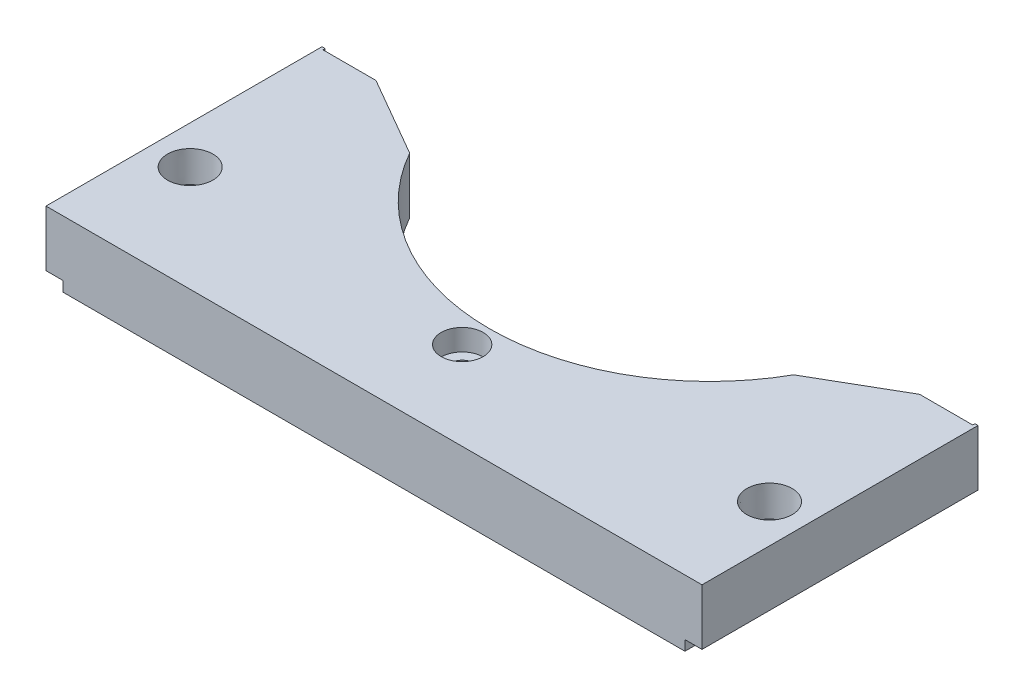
ISO-10303-21;
HEADER;
FILE_DESCRIPTION(('STEP AP214'),'2;1');
FILE_NAME('part.step','',(''),(''),'','','');
FILE_SCHEMA(('AUTOMOTIVE_DESIGN { 1 0 10303 214 1 1 1 1 }'));
ENDSEC;
DATA;
#1=APPLICATION_CONTEXT('core data for automotive mechanical design processes');
#2=APPLICATION_PROTOCOL_DEFINITION('international standard','automotive_design',2000,#1);
#3=PRODUCT_CONTEXT('',#1,'mechanical');
#4=PRODUCT('Part','Part','',(#3));
#5=PRODUCT_RELATED_PRODUCT_CATEGORY('part','',(#4));
#6=PRODUCT_DEFINITION_FORMATION('','',#4);
#7=PRODUCT_DEFINITION_CONTEXT('part definition',#1,'design');
#8=PRODUCT_DEFINITION('design','',#6,#7);
#9=PRODUCT_DEFINITION_SHAPE('','',#8);
#10=(LENGTH_UNIT() NAMED_UNIT(*) SI_UNIT(.MILLI.,.METRE.));
#11=(NAMED_UNIT(*) PLANE_ANGLE_UNIT() SI_UNIT($,.RADIAN.));
#12=(NAMED_UNIT(*) SI_UNIT($,.STERADIAN.) SOLID_ANGLE_UNIT());
#13=UNCERTAINTY_MEASURE_WITH_UNIT(LENGTH_MEASURE(1.E-05),#10,'distance_accuracy_value','');
#14=(GEOMETRIC_REPRESENTATION_CONTEXT(3) GLOBAL_UNCERTAINTY_ASSIGNED_CONTEXT((#13)) GLOBAL_UNIT_ASSIGNED_CONTEXT((#10,
#11,#12)) REPRESENTATION_CONTEXT('',''));
#15=CARTESIAN_POINT('',(0.,0.,0.));
#16=DIRECTION('',(0.,0.,1.));
#17=DIRECTION('',(1.,0.,0.));
#18=AXIS2_PLACEMENT_3D('',#15,#16,#17);
#19=CARTESIAN_POINT('',(-73.717525,12.7,-31.056));
#20=DIRECTION('',(0.,0.,1.));
#21=DIRECTION('',(1.,0.,0.));
#22=AXIS2_PLACEMENT_3D('',#19,#20,#21);
#23=PLANE('',#22);
#24=DIRECTION('',(-0.0348994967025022,-0.999390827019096,0.));
#25=VECTOR('',#24,1.);
#26=CARTESIAN_POINT('',(-72.4670681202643,6.35,-31.056));
#27=LINE('',#26,#25);
#28=CARTESIAN_POINT('',(-72.4670681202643,6.35,-31.056));
#29=VERTEX_POINT('',#28);
#30=CARTESIAN_POINT('',(-72.6888150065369,0.,-31.056));
#31=VERTEX_POINT('',#30);
#32=EDGE_CURVE('E719',#29,#31,#27,.T.);
#33=ORIENTED_EDGE('',*,*,#32,.T.);
#34=DIRECTION('',(-1.,0.,0.));
#35=VECTOR('',#34,1.);
#36=CARTESIAN_POINT('',(-73.717525,0.,-31.056));
#37=LINE('',#36,#35);
#38=CARTESIAN_POINT('',(-73.717525,0.,-31.056));
#39=VERTEX_POINT('',#38);
#40=EDGE_CURVE('E1141',#31,#39,#37,.T.);
#41=ORIENTED_EDGE('',*,*,#40,.T.);
#42=DIRECTION('',(0.,-1.,0.));
#43=VECTOR('',#42,1.);
#44=CARTESIAN_POINT('',(-73.717525,12.7,-31.056));
#45=LINE('',#44,#43);
#46=CARTESIAN_POINT('',(-73.717525,12.7,-31.056));
#47=VERTEX_POINT('',#46);
#48=EDGE_CURVE('E1151',#47,#39,#45,.T.);
#49=ORIENTED_EDGE('',*,*,#48,.F.);
#50=DIRECTION('',(-1.,0.,0.));
#51=VECTOR('',#50,1.);
#52=CARTESIAN_POINT('',(-73.717525,12.7,-31.056));
#53=LINE('',#52,#51);
#54=CARTESIAN_POINT('',(-61.673025,12.7,-31.056));
#55=VERTEX_POINT('',#54);
#56=EDGE_CURVE('E35',#55,#47,#53,.T.);
#57=ORIENTED_EDGE('',*,*,#56,.F.);
#58=DIRECTION('',(0.,1.,0.));
#59=VECTOR('',#58,1.);
#60=CARTESIAN_POINT('',(-61.673025,-0.000999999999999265,-31.056));
#61=LINE('',#60,#59);
#62=CARTESIAN_POINT('',(-61.673025,0.,-31.056));
#63=VERTEX_POINT('',#62);
#64=EDGE_CURVE('E1470',#63,#55,#61,.T.);
#65=ORIENTED_EDGE('',*,*,#64,.F.);
#66=CARTESIAN_POINT('',(-70.7462349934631,0.,-31.056));
#67=VERTEX_POINT('',#66);
#68=EDGE_CURVE('E1138',#63,#67,#37,.T.);
#69=ORIENTED_EDGE('',*,*,#68,.T.);
#70=DIRECTION('',(-0.0348994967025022,0.999390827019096,0.));
#71=VECTOR('',#70,1.);
#72=CARTESIAN_POINT('',(-70.9679818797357,6.35,-31.056));
#73=LINE('',#72,#71);
#74=CARTESIAN_POINT('',(-70.9679818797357,6.35,-31.056));
#75=VERTEX_POINT('',#74);
#76=EDGE_CURVE('E728',#67,#75,#73,.T.);
#77=ORIENTED_EDGE('',*,*,#76,.T.);
#78=CARTESIAN_POINT('',(-71.717525,6.32382537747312,-31.056));
#79=DIRECTION('',(0.,0.,1.));
#80=DIRECTION('',(-1.,0.,0.));
#81=AXIS2_PLACEMENT_3D('',#78,#79,#80);
#82=CIRCLE('',#81,0.749999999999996);
#83=EDGE_CURVE('E57',#75,#29,#82,.T.);
#84=ORIENTED_EDGE('',*,*,#83,.T.);
#85=EDGE_LOOP('',(#33,#41,#49,#57,#65,#69,#77,#84));
#86=FACE_BOUND('',#85,.T.);
#87=CARTESIAN_POINT('',(-70.717525,10.5806,-31.056));
#88=DIRECTION('',(0.,0.,-1.));
#89=DIRECTION('',(1.,0.,0.));
#90=AXIS2_PLACEMENT_3D('',#87,#88,#89);
#91=CIRCLE('',#90,1.6);
#92=CARTESIAN_POINT('',(-69.117525,10.5806,-31.056));
#93=VERTEX_POINT('',#92);
#94=CARTESIAN_POINT('',(-70.0050028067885,9.14801069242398,-31.056));
#95=VERTEX_POINT('',#94);
#96=EDGE_CURVE('E49',#93,#95,#91,.T.);
#97=ORIENTED_EDGE('',*,*,#96,.T.);
#98=CARTESIAN_POINT('',(-69.651525,8.43731209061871,-31.056));
#99=DIRECTION('',(0.,0.,1.));
#100=DIRECTION('',(1.,0.,0.));
#101=AXIS2_PLACEMENT_3D('',#98,#99,#100);
#102=CIRCLE('',#101,0.79374999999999);
#103=CARTESIAN_POINT('',(-70.445275,8.43731209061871,-31.056));
#104=VERTEX_POINT('',#103);
#105=EDGE_CURVE('E580',#95,#104,#102,.T.);
#106=ORIENTED_EDGE('',*,*,#105,.T.);
#107=DIRECTION('',(0.,-1.,0.));
#108=VECTOR('',#107,1.);
#109=CARTESIAN_POINT('',(-70.445275,8.43731209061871,-31.056));
#110=LINE('',#109,#108);
#111=CARTESIAN_POINT('',(-70.445275,4.26268790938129,-31.056));
#112=VERTEX_POINT('',#111);
#113=EDGE_CURVE('E671',#104,#112,#110,.T.);
#114=ORIENTED_EDGE('',*,*,#113,.T.);
#115=CARTESIAN_POINT('',(-69.651525,4.26268790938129,-31.056));
#116=DIRECTION('',(0.,0.,1.));
#117=DIRECTION('',(-1.,0.,0.));
#118=AXIS2_PLACEMENT_3D('',#115,#116,#117);
#119=CIRCLE('',#118,0.79374999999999);
#120=CARTESIAN_POINT('',(-70.0050028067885,3.55198930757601,-31.056));
#121=VERTEX_POINT('',#120);
#122=EDGE_CURVE('E668',#112,#121,#119,.T.);
#123=ORIENTED_EDGE('',*,*,#122,.T.);
#124=CARTESIAN_POINT('',(-70.717525,2.1194,-31.056));
#125=DIRECTION('',(0.,0.,-1.));
#126=DIRECTION('',(-1.,0.,0.));
#127=AXIS2_PLACEMENT_3D('',#124,#125,#126);
#128=CIRCLE('',#127,1.6);
#129=CARTESIAN_POINT('',(-69.117525,2.1194,-31.056));
#130=VERTEX_POINT('',#129);
#131=EDGE_CURVE('E665',#121,#130,#128,.T.);
#132=ORIENTED_EDGE('',*,*,#131,.T.);
#133=DIRECTION('',(0.,-1.,0.));
#134=VECTOR('',#133,1.);
#135=CARTESIAN_POINT('',(-69.117525,1.59375,-31.056));
#136=LINE('',#135,#134);
#137=CARTESIAN_POINT('',(-69.117525,1.59375,-31.056));
#138=VERTEX_POINT('',#137);
#139=EDGE_CURVE('E662',#130,#138,#136,.T.);
#140=ORIENTED_EDGE('',*,*,#139,.T.);
#141=CARTESIAN_POINT('',(-68.323775,1.59375,-31.056));
#142=DIRECTION('',(0.,0.,1.));
#143=DIRECTION('',(-1.,0.,0.));
#144=AXIS2_PLACEMENT_3D('',#141,#142,#143);
#145=CIRCLE('',#144,0.793749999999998);
#146=CARTESIAN_POINT('',(-68.323775,0.799999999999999,-31.056));
#147=VERTEX_POINT('',#146);
#148=EDGE_CURVE('E659',#138,#147,#145,.T.);
#149=ORIENTED_EDGE('',*,*,#148,.T.);
#150=DIRECTION('',(1.,0.,0.));
#151=VECTOR('',#150,1.);
#152=CARTESIAN_POINT('',(-68.323775,0.799999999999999,-31.056));
#153=LINE('',#152,#151);
#154=CARTESIAN_POINT('',(-67.066775,0.800000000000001,-31.056));
#155=VERTEX_POINT('',#154);
#156=EDGE_CURVE('E656',#147,#155,#153,.T.);
#157=ORIENTED_EDGE('',*,*,#156,.T.);
#158=CARTESIAN_POINT('',(-67.066775,1.59375,-31.056));
#159=DIRECTION('',(0.,0.,1.));
#160=DIRECTION('',(-1.,0.,0.));
#161=AXIS2_PLACEMENT_3D('',#158,#159,#160);
#162=CIRCLE('',#161,0.793749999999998);
#163=CARTESIAN_POINT('',(-66.273025,1.59375,-31.056));
#164=VERTEX_POINT('',#163);
#165=EDGE_CURVE('E653',#155,#164,#162,.T.);
#166=ORIENTED_EDGE('',*,*,#165,.T.);
#167=DIRECTION('',(0.,1.,0.));
#168=VECTOR('',#167,1.);
#169=CARTESIAN_POINT('',(-66.273025,1.59375,-31.056));
#170=LINE('',#169,#168);
#171=CARTESIAN_POINT('',(-66.273025,2.1194,-31.056));
#172=VERTEX_POINT('',#171);
#173=EDGE_CURVE('E650',#164,#172,#170,.T.);
#174=ORIENTED_EDGE('',*,*,#173,.T.);
#175=CARTESIAN_POINT('',(-64.673025,2.1194,-31.056));
#176=DIRECTION('',(0.,0.,-1.));
#177=DIRECTION('',(1.,0.,0.));
#178=AXIS2_PLACEMENT_3D('',#175,#176,#177);
#179=CIRCLE('',#178,1.6);
#180=CARTESIAN_POINT('',(-65.3855471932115,3.55198930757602,-31.056));
#181=VERTEX_POINT('',#180);
#182=EDGE_CURVE('E647',#172,#181,#179,.T.);
#183=ORIENTED_EDGE('',*,*,#182,.T.);
#184=CARTESIAN_POINT('',(-65.739025,4.26268790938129,-31.056));
#185=DIRECTION('',(0.,0.,1.));
#186=DIRECTION('',(-1.,0.,0.));
#187=AXIS2_PLACEMENT_3D('',#184,#185,#186);
#188=CIRCLE('',#187,0.79374999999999);
#189=CARTESIAN_POINT('',(-64.945275,4.26268790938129,-31.056));
#190=VERTEX_POINT('',#189);
#191=EDGE_CURVE('E644',#181,#190,#188,.T.);
#192=ORIENTED_EDGE('',*,*,#191,.T.);
#193=DIRECTION('',(0.,1.,0.));
#194=VECTOR('',#193,1.);
#195=CARTESIAN_POINT('',(-64.945275,8.43731209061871,-31.056));
#196=LINE('',#195,#194);
#197=CARTESIAN_POINT('',(-64.945275,8.43731209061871,-31.056));
#198=VERTEX_POINT('',#197);
#199=EDGE_CURVE('E641',#190,#198,#196,.T.);
#200=ORIENTED_EDGE('',*,*,#199,.T.);
#201=CARTESIAN_POINT('',(-65.739025,8.43731209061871,-31.056));
#202=DIRECTION('',(0.,0.,1.));
#203=DIRECTION('',(1.,0.,0.));
#204=AXIS2_PLACEMENT_3D('',#201,#202,#203);
#205=CIRCLE('',#204,0.79374999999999);
#206=CARTESIAN_POINT('',(-65.3855471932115,9.14801069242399,-31.056));
#207=VERTEX_POINT('',#206);
#208=EDGE_CURVE('E638',#198,#207,#205,.T.);
#209=ORIENTED_EDGE('',*,*,#208,.T.);
#210=CARTESIAN_POINT('',(-64.673025,10.5806,-31.056));
#211=DIRECTION('',(0.,0.,-1.));
#212=DIRECTION('',(-1.,0.,0.));
#213=AXIS2_PLACEMENT_3D('',#210,#211,#212);
#214=CIRCLE('',#213,1.6);
#215=CARTESIAN_POINT('',(-66.273025,10.5806,-31.056));
#216=VERTEX_POINT('',#215);
#217=EDGE_CURVE('E635',#207,#216,#214,.T.);
#218=ORIENTED_EDGE('',*,*,#217,.T.);
#219=DIRECTION('',(0.,1.,0.));
#220=VECTOR('',#219,1.);
#221=CARTESIAN_POINT('',(-66.273025,11.10625,-31.056));
#222=LINE('',#221,#220);
#223=CARTESIAN_POINT('',(-66.273025,11.10625,-31.056));
#224=VERTEX_POINT('',#223);
#225=EDGE_CURVE('E632',#216,#224,#222,.T.);
#226=ORIENTED_EDGE('',*,*,#225,.T.);
#227=CARTESIAN_POINT('',(-67.066775,11.10625,-31.056));
#228=DIRECTION('',(0.,0.,1.));
#229=DIRECTION('',(1.,0.,0.));
#230=AXIS2_PLACEMENT_3D('',#227,#228,#229);
#231=CIRCLE('',#230,0.793749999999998);
#232=CARTESIAN_POINT('',(-67.066775,11.9,-31.056));
#233=VERTEX_POINT('',#232);
#234=EDGE_CURVE('E629',#224,#233,#231,.T.);
#235=ORIENTED_EDGE('',*,*,#234,.T.);
#236=DIRECTION('',(-1.,0.,0.));
#237=VECTOR('',#236,1.);
#238=CARTESIAN_POINT('',(-68.323775,11.9,-31.056));
#239=LINE('',#238,#237);
#240=CARTESIAN_POINT('',(-68.323775,11.9,-31.056));
#241=VERTEX_POINT('',#240);
#242=EDGE_CURVE('E626',#233,#241,#239,.T.);
#243=ORIENTED_EDGE('',*,*,#242,.T.);
#244=CARTESIAN_POINT('',(-68.323775,11.10625,-31.056));
#245=DIRECTION('',(0.,0.,1.));
#246=DIRECTION('',(1.,0.,0.));
#247=AXIS2_PLACEMENT_3D('',#244,#245,#246);
#248=CIRCLE('',#247,0.793749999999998);
#249=CARTESIAN_POINT('',(-69.117525,11.10625,-31.056));
#250=VERTEX_POINT('',#249);
#251=EDGE_CURVE('E623',#241,#250,#248,.T.);
#252=ORIENTED_EDGE('',*,*,#251,.T.);
#253=DIRECTION('',(0.,-1.,0.));
#254=VECTOR('',#253,1.);
#255=CARTESIAN_POINT('',(-69.117525,11.10625,-31.056));
#256=LINE('',#255,#254);
#257=EDGE_CURVE('E620',#250,#93,#256,.T.);
#258=ORIENTED_EDGE('',*,*,#257,.T.);
#259=EDGE_LOOP('',(#97,#106,#114,#123,#132,#140,#149,#157,#166,#174,#183,#192,#200,#209,#218,
#226,#235,#243,#252,#258));
#260=FACE_BOUND('',#259,.T.);
#261=ADVANCED_FACE('F31',(#86,#260),#23,.F.);
#262=CARTESIAN_POINT('',(-73.717525,0.,31.056));
#263=DIRECTION('',(0.,1.,0.));
#264=DIRECTION('',(0.,0.,1.));
#265=AXIS2_PLACEMENT_3D('',#262,#263,#264);
#266=PLANE('',#265);
#267=DIRECTION('',(0.,0.,-1.));
#268=VECTOR('',#267,1.);
#269=CARTESIAN_POINT('',(-72.6888150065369,0.,-30.056));
#270=LINE('',#269,#268);
#271=CARTESIAN_POINT('',(-72.6888150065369,0.,-30.056));
#272=VERTEX_POINT('',#271);
#273=EDGE_CURVE('E736',#272,#31,#270,.T.);
#274=ORIENTED_EDGE('',*,*,#273,.F.);
#275=DIRECTION('',(1.,0.,0.));
#276=VECTOR('',#275,1.);
#277=CARTESIAN_POINT('',(-70.7462349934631,0.,-30.056));
#278=LINE('',#277,#276);
#279=CARTESIAN_POINT('',(-70.7462349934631,0.,-30.056));
#280=VERTEX_POINT('',#279);
#281=EDGE_CURVE('E721',#272,#280,#278,.T.);
#282=ORIENTED_EDGE('',*,*,#281,.T.);
#283=DIRECTION('',(0.,0.,-1.));
#284=VECTOR('',#283,1.);
#285=CARTESIAN_POINT('',(-70.7462349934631,0.,-30.056));
#286=LINE('',#285,#284);
#287=EDGE_CURVE('E738',#280,#67,#286,.T.);
#288=ORIENTED_EDGE('',*,*,#287,.T.);
#289=ORIENTED_EDGE('',*,*,#68,.F.);
#290=DIRECTION('',(-0.866025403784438,0.,-0.500000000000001));
#291=VECTOR('',#290,1.);
#292=CARTESIAN_POINT('',(-61.673025,0.,-31.056));
#293=LINE('',#292,#291);
#294=CARTESIAN_POINT('',(-43.5611302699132,0.,-20.5990927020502));
#295=VERTEX_POINT('',#294);
#296=EDGE_CURVE('E1466',#295,#63,#293,.T.);
#297=ORIENTED_EDGE('',*,*,#296,.F.);
#298=CARTESIAN_POINT('',(0.,0.,-45.1435));
#299=DIRECTION('',(0.,1.,0.));
#300=DIRECTION('',(0.,0.,1.));
#301=AXIS2_PLACEMENT_3D('',#298,#299,#300);
#302=CIRCLE('',#301,50.);
#303=CARTESIAN_POINT('',(43.5611302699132,0.,-20.5990927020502));
#304=VERTEX_POINT('',#303);
#305=EDGE_CURVE('E1465',#304,#295,#302,.F.);
#306=ORIENTED_EDGE('',*,*,#305,.F.);
#307=DIRECTION('',(-0.866025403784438,0.,0.500000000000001));
#308=VECTOR('',#307,1.);
#309=CARTESIAN_POINT('',(0.,0.,4.55093758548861));
#310=LINE('',#309,#308);
#311=CARTESIAN_POINT('',(61.673025,0.,-31.056));
#312=VERTEX_POINT('',#311);
#313=EDGE_CURVE('E1135',#312,#304,#310,.T.);
#314=ORIENTED_EDGE('',*,*,#313,.F.);
#315=CARTESIAN_POINT('',(70.7462349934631,0.,-31.056));
#316=VERTEX_POINT('',#315);
#317=EDGE_CURVE('E1133',#316,#312,#37,.T.);
#318=ORIENTED_EDGE('',*,*,#317,.F.);
#319=DIRECTION('',(0.,0.,-1.));
#320=VECTOR('',#319,1.);
#321=CARTESIAN_POINT('',(70.7462349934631,0.,-30.056));
#322=LINE('',#321,#320);
#323=CARTESIAN_POINT('',(70.7462349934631,0.,-30.056));
#324=VERTEX_POINT('',#323);
#325=EDGE_CURVE('E958',#324,#316,#322,.T.);
#326=ORIENTED_EDGE('',*,*,#325,.F.);
#327=DIRECTION('',(-1.,0.,0.));
#328=VECTOR('',#327,1.);
#329=CARTESIAN_POINT('',(70.7462349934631,0.,-30.056));
#330=LINE('',#329,#328);
#331=CARTESIAN_POINT('',(72.6888150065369,0.,-30.056));
#332=VERTEX_POINT('',#331);
#333=EDGE_CURVE('E944',#332,#324,#330,.T.);
#334=ORIENTED_EDGE('',*,*,#333,.F.);
#335=DIRECTION('',(0.,0.,-1.));
#336=VECTOR('',#335,1.);
#337=CARTESIAN_POINT('',(72.6888150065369,0.,-30.056));
#338=LINE('',#337,#336);
#339=CARTESIAN_POINT('',(72.6888150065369,0.,-31.056));
#340=VERTEX_POINT('',#339);
#341=EDGE_CURVE('E960',#332,#340,#338,.T.);
#342=ORIENTED_EDGE('',*,*,#341,.T.);
#343=CARTESIAN_POINT('',(73.717525,0.,-31.056));
#344=VERTEX_POINT('',#343);
#345=EDGE_CURVE('E528',#344,#340,#37,.T.);
#346=ORIENTED_EDGE('',*,*,#345,.F.);
#347=DIRECTION('',(0.,0.,-1.));
#348=VECTOR('',#347,1.);
#349=CARTESIAN_POINT('',(73.717525,0.,31.056));
#350=LINE('',#349,#348);
#351=CARTESIAN_POINT('',(73.717525,0.,-31.556));
#352=VERTEX_POINT('',#351);
#353=EDGE_CURVE('E735',#344,#352,#350,.T.);
#354=ORIENTED_EDGE('',*,*,#353,.T.);
#355=DIRECTION('',(-1.,0.,0.));
#356=VECTOR('',#355,1.);
#357=CARTESIAN_POINT('',(74.417525,0.,-31.556));
#358=LINE('',#357,#356);
#359=CARTESIAN_POINT('',(74.417525,0.,-31.556));
#360=VERTEX_POINT('',#359);
#361=EDGE_CURVE('E763',#360,#352,#358,.T.);
#362=ORIENTED_EDGE('',*,*,#361,.F.);
#363=DIRECTION('',(0.,0.,-1.));
#364=VECTOR('',#363,1.);
#365=CARTESIAN_POINT('',(74.417525,0.,31.056));
#366=LINE('',#365,#364);
#367=CARTESIAN_POINT('',(74.417525,0.,31.056));
#368=VERTEX_POINT('',#367);
#369=EDGE_CURVE('E743',#368,#360,#366,.T.);
#370=ORIENTED_EDGE('',*,*,#369,.F.);
#371=DIRECTION('',(1.,0.,0.));
#372=VECTOR('',#371,1.);
#373=CARTESIAN_POINT('',(-73.717525,0.,31.056));
#374=LINE('',#373,#372);
#375=CARTESIAN_POINT('',(70.542525,0.,31.056));
#376=VERTEX_POINT('',#375);
#377=EDGE_CURVE('E1468',#376,#368,#374,.T.);
#378=ORIENTED_EDGE('',*,*,#377,.F.);
#379=DIRECTION('',(0.,0.,1.));
#380=VECTOR('',#379,1.);
#381=CARTESIAN_POINT('',(70.542525,0.,-27.881));
#382=LINE('',#381,#380);
#383=CARTESIAN_POINT('',(70.542525,0.,-27.881));
#384=VERTEX_POINT('',#383);
#385=EDGE_CURVE('E1020',#384,#376,#382,.T.);
#386=ORIENTED_EDGE('',*,*,#385,.F.);
#387=DIRECTION('',(1.,0.,0.));
#388=VECTOR('',#387,1.);
#389=CARTESIAN_POINT('',(62.5237636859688,0.,-27.881));
#390=LINE('',#389,#388);
#391=CARTESIAN_POINT('',(62.5237636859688,0.,-27.881));
#392=VERTEX_POINT('',#391);
#393=EDGE_CURVE('E1025',#392,#384,#390,.T.);
#394=ORIENTED_EDGE('',*,*,#393,.F.);
#395=DIRECTION('',(0.866025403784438,0.,-0.500000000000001));
#396=VECTOR('',#395,1.);
#397=CARTESIAN_POINT('',(45.8884551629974,0.,-18.27660014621));
#398=LINE('',#397,#396);
#399=CARTESIAN_POINT('',(53.975,0.,-22.9453689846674));
#400=VERTEX_POINT('',#399);
#401=EDGE_CURVE('E1509',#400,#392,#398,.T.);
#402=ORIENTED_EDGE('',*,*,#401,.F.);
#403=DIRECTION('',(0.,0.,1.));
#404=VECTOR('',#403,1.);
#405=CARTESIAN_POINT('',(53.975,0.,5.657));
#406=LINE('',#405,#404);
#407=CARTESIAN_POINT('',(53.975,0.,5.657));
#408=VERTEX_POINT('',#407);
#409=EDGE_CURVE('E982',#400,#408,#406,.T.);
#410=ORIENTED_EDGE('',*,*,#409,.T.);
#411=CARTESIAN_POINT('',(50.8,0.,5.657));
#412=DIRECTION('',(0.,1.,0.));
#413=DIRECTION('',(0.,0.,1.));
#414=AXIS2_PLACEMENT_3D('',#411,#412,#413);
#415=CIRCLE('',#414,3.175);
#416=CARTESIAN_POINT('',(47.625,0.,5.657));
#417=VERTEX_POINT('',#416);
#418=EDGE_CURVE('E983',#408,#417,#415,.F.);
#419=ORIENTED_EDGE('',*,*,#418,.T.);
#420=DIRECTION('',(0.,0.,-1.));
#421=VECTOR('',#420,1.);
#422=CARTESIAN_POINT('',(47.625,0.,5.657));
#423=LINE('',#422,#421);
#424=CARTESIAN_POINT('',(47.625,0.,-19.2791947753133));
#425=VERTEX_POINT('',#424);
#426=EDGE_CURVE('E976',#417,#425,#423,.T.);
#427=ORIENTED_EDGE('',*,*,#426,.T.);
#428=CARTESIAN_POINT('',(45.8884551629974,0.,-18.27660014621));
#429=VERTEX_POINT('',#428);
#430=EDGE_CURVE('E1506',#429,#425,#398,.T.);
#431=ORIENTED_EDGE('',*,*,#430,.F.);
#432=CARTESIAN_POINT('',(0.,0.,-45.1435));
#433=DIRECTION('',(0.,1.,0.));
#434=DIRECTION('',(0.,0.,-1.));
#435=AXIS2_PLACEMENT_3D('',#432,#433,#434);
#436=CIRCLE('',#435,53.1750000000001);
#437=CARTESIAN_POINT('',(-45.8884551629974,0.,-18.27660014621));
#438=VERTEX_POINT('',#437);
#439=EDGE_CURVE('E1510',#438,#429,#436,.T.);
#440=ORIENTED_EDGE('',*,*,#439,.F.);
#441=DIRECTION('',(0.866025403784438,0.,0.500000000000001));
#442=VECTOR('',#441,1.);
#443=CARTESIAN_POINT('',(-62.5237636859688,0.,-27.881));
#444=LINE('',#443,#442);
#445=CARTESIAN_POINT('',(-47.625,0.,-19.2791947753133));
#446=VERTEX_POINT('',#445);
#447=EDGE_CURVE('E1514',#446,#438,#444,.T.);
#448=ORIENTED_EDGE('',*,*,#447,.F.);
#449=DIRECTION('',(0.,0.,1.));
#450=VECTOR('',#449,1.);
#451=CARTESIAN_POINT('',(-47.625,0.,5.657));
#452=LINE('',#451,#450);
#453=CARTESIAN_POINT('',(-47.625,0.,5.657));
#454=VERTEX_POINT('',#453);
#455=EDGE_CURVE('E1005',#446,#454,#452,.T.);
#456=ORIENTED_EDGE('',*,*,#455,.T.);
#457=CARTESIAN_POINT('',(-50.8,0.,5.657));
#458=DIRECTION('',(0.,1.,0.));
#459=DIRECTION('',(0.,0.,1.));
#460=AXIS2_PLACEMENT_3D('',#457,#458,#459);
#461=CIRCLE('',#460,3.175);
#462=CARTESIAN_POINT('',(-53.975,0.,5.657));
#463=VERTEX_POINT('',#462);
#464=EDGE_CURVE('E1006',#454,#463,#461,.F.);
#465=ORIENTED_EDGE('',*,*,#464,.T.);
#466=DIRECTION('',(0.,0.,-1.));
#467=VECTOR('',#466,1.);
#468=CARTESIAN_POINT('',(-53.975,0.,5.657));
#469=LINE('',#468,#467);
#470=CARTESIAN_POINT('',(-53.975,0.,-22.9453689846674));
#471=VERTEX_POINT('',#470);
#472=EDGE_CURVE('E1000',#463,#471,#469,.T.);
#473=ORIENTED_EDGE('',*,*,#472,.T.);
#474=CARTESIAN_POINT('',(-62.5237636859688,0.,-27.881));
#475=VERTEX_POINT('',#474);
#476=EDGE_CURVE('E1512',#475,#471,#444,.T.);
#477=ORIENTED_EDGE('',*,*,#476,.F.);
#478=DIRECTION('',(1.,0.,0.));
#479=VECTOR('',#478,1.);
#480=CARTESIAN_POINT('',(-70.542525,0.,-27.881));
#481=LINE('',#480,#479);
#482=CARTESIAN_POINT('',(-70.542525,0.,-27.881));
#483=VERTEX_POINT('',#482);
#484=EDGE_CURVE('E1046',#483,#475,#481,.T.);
#485=ORIENTED_EDGE('',*,*,#484,.F.);
#486=DIRECTION('',(0.,0.,-1.));
#487=VECTOR('',#486,1.);
#488=CARTESIAN_POINT('',(-70.542525,0.,31.056));
#489=LINE('',#488,#487);
#490=CARTESIAN_POINT('',(-70.542525,0.,31.056));
#491=VERTEX_POINT('',#490);
#492=EDGE_CURVE('E1052',#491,#483,#489,.T.);
#493=ORIENTED_EDGE('',*,*,#492,.F.);
#494=CARTESIAN_POINT('',(-74.417525,0.,31.056));
#495=VERTEX_POINT('',#494);
#496=EDGE_CURVE('E1150',#495,#491,#374,.T.);
#497=ORIENTED_EDGE('',*,*,#496,.F.);
#498=DIRECTION('',(0.,0.,-1.));
#499=VECTOR('',#498,1.);
#500=CARTESIAN_POINT('',(-74.417525,0.,31.056));
#501=LINE('',#500,#499);
#502=CARTESIAN_POINT('',(-74.417525,0.,-31.556));
#503=VERTEX_POINT('',#502);
#504=EDGE_CURVE('E537',#495,#503,#501,.T.);
#505=ORIENTED_EDGE('',*,*,#504,.T.);
#506=DIRECTION('',(1.,0.,0.));
#507=VECTOR('',#506,1.);
#508=CARTESIAN_POINT('',(-74.417525,0.,-31.556));
#509=LINE('',#508,#507);
#510=CARTESIAN_POINT('',(-73.717525,0.,-31.556));
#511=VERTEX_POINT('',#510);
#512=EDGE_CURVE('E549',#503,#511,#509,.T.);
#513=ORIENTED_EDGE('',*,*,#512,.T.);
#514=DIRECTION('',(0.,0.,-1.));
#515=VECTOR('',#514,1.);
#516=CARTESIAN_POINT('',(-73.717525,0.,31.056));
#517=LINE('',#516,#515);
#518=EDGE_CURVE('E538',#39,#511,#517,.T.);
#519=ORIENTED_EDGE('',*,*,#518,.F.);
#520=ORIENTED_EDGE('',*,*,#40,.F.);
#521=EDGE_LOOP('',(#274,#282,#288,#289,#297,#306,#314,#318,#326,#334,#342,#346,#354,#362,#370,
#378,#386,#394,#402,#410,#419,#427,#431,#440,#448,#456,#465,#473,#477,#485,#493,#497,#505,#513,
#519,#520));
#522=FACE_BOUND('',#521,.T.);
#523=ADVANCED_FACE('F1089',(#522),#266,.F.);
#524=CARTESIAN_POINT('',(45.8884551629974,-2.3,-18.27660014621));
#525=DIRECTION('',(0.500000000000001,0.,0.866025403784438));
#526=DIRECTION('',(0.866025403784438,0.,-0.500000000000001));
#527=AXIS2_PLACEMENT_3D('',#524,#525,#526);
#528=PLANE('',#527);
#529=ORIENTED_EDGE('',*,*,#430,.T.);
#530=DIRECTION('',(0.,-1.,0.));
#531=VECTOR('',#530,1.);
#532=CARTESIAN_POINT('',(47.625,-2.3,-19.2791947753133));
#533=LINE('',#532,#531);
#534=CARTESIAN_POINT('',(47.625,-2.3,-19.2791947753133));
#535=VERTEX_POINT('',#534);
#536=EDGE_CURVE('E994',#425,#535,#533,.T.);
#537=ORIENTED_EDGE('',*,*,#536,.T.);
#538=DIRECTION('',(0.866025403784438,0.,-0.500000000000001));
#539=VECTOR('',#538,1.);
#540=CARTESIAN_POINT('',(45.8884551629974,-2.3,-18.27660014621));
#541=LINE('',#540,#539);
#542=CARTESIAN_POINT('',(45.8884551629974,-2.3,-18.27660014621));
#543=VERTEX_POINT('',#542);
#544=EDGE_CURVE('E1038',#543,#535,#541,.T.);
#545=ORIENTED_EDGE('',*,*,#544,.F.);
#546=DIRECTION('',(0.,1.,0.));
#547=VECTOR('',#546,1.);
#548=CARTESIAN_POINT('',(45.8884551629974,-2.3,-18.27660014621));
#549=LINE('',#548,#547);
#550=EDGE_CURVE('E1496',#543,#429,#549,.T.);
#551=ORIENTED_EDGE('',*,*,#550,.T.);
#552=EDGE_LOOP('',(#529,#537,#545,#551));
#553=FACE_BOUND('',#552,.T.);
#554=ADVANCED_FACE('F1095',(#553),#528,.F.);
#555=CARTESIAN_POINT('',(-62.5237636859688,-2.3,-27.881));
#556=DIRECTION('',(-0.500000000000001,0.,0.866025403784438));
#557=DIRECTION('',(0.866025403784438,0.,0.500000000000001));
#558=AXIS2_PLACEMENT_3D('',#555,#556,#557);
#559=PLANE('',#558);
#560=ORIENTED_EDGE('',*,*,#476,.T.);
#561=DIRECTION('',(0.,-1.,0.));
#562=VECTOR('',#561,1.);
#563=CARTESIAN_POINT('',(-53.975,-2.3,-22.9453689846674));
#564=LINE('',#563,#562);
#565=CARTESIAN_POINT('',(-53.975,-2.3,-22.9453689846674));
#566=VERTEX_POINT('',#565);
#567=EDGE_CURVE('E1017',#471,#566,#564,.T.);
#568=ORIENTED_EDGE('',*,*,#567,.T.);
#569=DIRECTION('',(0.866025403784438,0.,0.500000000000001));
#570=VECTOR('',#569,1.);
#571=CARTESIAN_POINT('',(-62.5237636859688,-2.3,-27.881));
#572=LINE('',#571,#570);
#573=CARTESIAN_POINT('',(-62.5237636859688,-2.3,-27.881));
#574=VERTEX_POINT('',#573);
#575=EDGE_CURVE('E1032',#574,#566,#572,.T.);
#576=ORIENTED_EDGE('',*,*,#575,.F.);
#577=DIRECTION('',(0.,1.,0.));
#578=VECTOR('',#577,1.);
#579=CARTESIAN_POINT('',(-62.5237636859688,-2.3,-27.881));
#580=LINE('',#579,#578);
#581=EDGE_CURVE('E1490',#574,#475,#580,.T.);
#582=ORIENTED_EDGE('',*,*,#581,.T.);
#583=EDGE_LOOP('',(#560,#568,#576,#582));
#584=FACE_BOUND('',#583,.T.);
#585=ADVANCED_FACE('F1100',(#584),#559,.F.);
#586=CARTESIAN_POINT('',(69.651525,8.43731209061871,-31.056));
#587=DIRECTION('',(0.,0.,-1.));
#588=DIRECTION('',(-1.,0.,0.));
#589=AXIS2_PLACEMENT_3D('',#586,#587,#588);
#590=CIRCLE('',#589,0.79374999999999);
#591=CARTESIAN_POINT('',(70.0050028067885,9.14801069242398,-31.056));
#592=VERTEX_POINT('',#591);
#593=CARTESIAN_POINT('',(70.445275,8.43731209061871,-31.056));
#594=VERTEX_POINT('',#593);
#595=EDGE_CURVE('E840',#592,#594,#590,.T.);
#596=ORIENTED_EDGE('',*,*,#595,.F.);
#597=CARTESIAN_POINT('',(70.717525,10.5806,-31.056));
#598=DIRECTION('',(0.,0.,1.));
#599=DIRECTION('',(-1.,0.,0.));
#600=AXIS2_PLACEMENT_3D('',#597,#598,#599);
#601=CIRCLE('',#600,1.6);
#602=CARTESIAN_POINT('',(69.117525,10.5806,-31.056));
#603=VERTEX_POINT('',#602);
#604=EDGE_CURVE('E776',#603,#592,#601,.T.);
#605=ORIENTED_EDGE('',*,*,#604,.F.);
#606=DIRECTION('',(0.,-1.,0.));
#607=VECTOR('',#606,1.);
#608=CARTESIAN_POINT('',(69.117525,11.10625,-31.056));
#609=LINE('',#608,#607);
#610=CARTESIAN_POINT('',(69.117525,11.10625,-31.056));
#611=VERTEX_POINT('',#610);
#612=EDGE_CURVE('E781',#611,#603,#609,.T.);
#613=ORIENTED_EDGE('',*,*,#612,.F.);
#614=CARTESIAN_POINT('',(68.323775,11.10625,-31.056));
#615=DIRECTION('',(0.,0.,-1.));
#616=DIRECTION('',(-1.,0.,0.));
#617=AXIS2_PLACEMENT_3D('',#614,#615,#616);
#618=CIRCLE('',#617,0.793749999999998);
#619=CARTESIAN_POINT('',(68.323775,11.9,-31.056));
#620=VERTEX_POINT('',#619);
#621=EDGE_CURVE('E891',#620,#611,#618,.T.);
#622=ORIENTED_EDGE('',*,*,#621,.F.);
#623=DIRECTION('',(1.,0.,0.));
#624=VECTOR('',#623,1.);
#625=CARTESIAN_POINT('',(68.323775,11.9,-31.056));
#626=LINE('',#625,#624);
#627=CARTESIAN_POINT('',(67.066775,11.9,-31.056));
#628=VERTEX_POINT('',#627);
#629=EDGE_CURVE('E888',#628,#620,#626,.T.);
#630=ORIENTED_EDGE('',*,*,#629,.F.);
#631=CARTESIAN_POINT('',(67.066775,11.10625,-31.056));
#632=DIRECTION('',(0.,0.,-1.));
#633=DIRECTION('',(-1.,0.,0.));
#634=AXIS2_PLACEMENT_3D('',#631,#632,#633);
#635=CIRCLE('',#634,0.793749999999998);
#636=CARTESIAN_POINT('',(66.273025,11.10625,-31.056));
#637=VERTEX_POINT('',#636);
#638=EDGE_CURVE('E885',#637,#628,#635,.T.);
#639=ORIENTED_EDGE('',*,*,#638,.F.);
#640=DIRECTION('',(0.,1.,0.));
#641=VECTOR('',#640,1.);
#642=CARTESIAN_POINT('',(66.273025,11.10625,-31.056));
#643=LINE('',#642,#641);
#644=CARTESIAN_POINT('',(66.273025,10.5806,-31.056));
#645=VERTEX_POINT('',#644);
#646=EDGE_CURVE('E882',#645,#637,#643,.T.);
#647=ORIENTED_EDGE('',*,*,#646,.F.);
#648=CARTESIAN_POINT('',(64.673025,10.5806,-31.056));
#649=DIRECTION('',(0.,0.,1.));
#650=DIRECTION('',(1.,0.,0.));
#651=AXIS2_PLACEMENT_3D('',#648,#649,#650);
#652=CIRCLE('',#651,1.6);
#653=CARTESIAN_POINT('',(65.3855471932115,9.14801069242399,-31.056));
#654=VERTEX_POINT('',#653);
#655=EDGE_CURVE('E879',#654,#645,#652,.T.);
#656=ORIENTED_EDGE('',*,*,#655,.F.);
#657=CARTESIAN_POINT('',(65.739025,8.43731209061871,-31.056));
#658=DIRECTION('',(0.,0.,-1.));
#659=DIRECTION('',(-1.,0.,0.));
#660=AXIS2_PLACEMENT_3D('',#657,#658,#659);
#661=CIRCLE('',#660,0.79374999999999);
#662=CARTESIAN_POINT('',(64.945275,8.43731209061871,-31.056));
#663=VERTEX_POINT('',#662);
#664=EDGE_CURVE('E876',#663,#654,#661,.T.);
#665=ORIENTED_EDGE('',*,*,#664,.F.);
#666=DIRECTION('',(0.,1.,0.));
#667=VECTOR('',#666,1.);
#668=CARTESIAN_POINT('',(64.945275,8.43731209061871,-31.056));
#669=LINE('',#668,#667);
#670=CARTESIAN_POINT('',(64.945275,4.26268790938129,-31.056));
#671=VERTEX_POINT('',#670);
#672=EDGE_CURVE('E873',#671,#663,#669,.T.);
#673=ORIENTED_EDGE('',*,*,#672,.F.);
#674=CARTESIAN_POINT('',(65.739025,4.26268790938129,-31.056));
#675=DIRECTION('',(0.,0.,-1.));
#676=DIRECTION('',(1.,0.,0.));
#677=AXIS2_PLACEMENT_3D('',#674,#675,#676);
#678=CIRCLE('',#677,0.79374999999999);
#679=CARTESIAN_POINT('',(65.3855471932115,3.55198930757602,-31.056));
#680=VERTEX_POINT('',#679);
#681=EDGE_CURVE('E870',#680,#671,#678,.T.);
#682=ORIENTED_EDGE('',*,*,#681,.F.);
#683=CARTESIAN_POINT('',(64.673025,2.1194,-31.056));
#684=DIRECTION('',(0.,0.,1.));
#685=DIRECTION('',(-1.,0.,0.));
#686=AXIS2_PLACEMENT_3D('',#683,#684,#685);
#687=CIRCLE('',#686,1.6);
#688=CARTESIAN_POINT('',(66.273025,2.1194,-31.056));
#689=VERTEX_POINT('',#688);
#690=EDGE_CURVE('E867',#689,#680,#687,.T.);
#691=ORIENTED_EDGE('',*,*,#690,.F.);
#692=DIRECTION('',(0.,1.,0.));
#693=VECTOR('',#692,1.);
#694=CARTESIAN_POINT('',(66.273025,1.59375,-31.056));
#695=LINE('',#694,#693);
#696=CARTESIAN_POINT('',(66.273025,1.59375,-31.056));
#697=VERTEX_POINT('',#696);
#698=EDGE_CURVE('E864',#697,#689,#695,.T.);
#699=ORIENTED_EDGE('',*,*,#698,.F.);
#700=CARTESIAN_POINT('',(67.066775,1.59375,-31.056));
#701=DIRECTION('',(0.,0.,-1.));
#702=DIRECTION('',(1.,0.,0.));
#703=AXIS2_PLACEMENT_3D('',#700,#701,#702);
#704=CIRCLE('',#703,0.793749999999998);
#705=CARTESIAN_POINT('',(67.066775,0.800000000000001,-31.056));
#706=VERTEX_POINT('',#705);
#707=EDGE_CURVE('E861',#706,#697,#704,.T.);
#708=ORIENTED_EDGE('',*,*,#707,.F.);
#709=DIRECTION('',(-1.,0.,0.));
#710=VECTOR('',#709,1.);
#711=CARTESIAN_POINT('',(68.323775,0.799999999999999,-31.056));
#712=LINE('',#711,#710);
#713=CARTESIAN_POINT('',(68.323775,0.799999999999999,-31.056));
#714=VERTEX_POINT('',#713);
#715=EDGE_CURVE('E858',#714,#706,#712,.T.);
#716=ORIENTED_EDGE('',*,*,#715,.F.);
#717=CARTESIAN_POINT('',(68.323775,1.59375,-31.056));
#718=DIRECTION('',(0.,0.,-1.));
#719=DIRECTION('',(1.,0.,0.));
#720=AXIS2_PLACEMENT_3D('',#717,#718,#719);
#721=CIRCLE('',#720,0.793749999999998);
#722=CARTESIAN_POINT('',(69.117525,1.59375,-31.056));
#723=VERTEX_POINT('',#722);
#724=EDGE_CURVE('E855',#723,#714,#721,.T.);
#725=ORIENTED_EDGE('',*,*,#724,.F.);
#726=DIRECTION('',(0.,-1.,0.));
#727=VECTOR('',#726,1.);
#728=CARTESIAN_POINT('',(69.117525,1.59375,-31.056));
#729=LINE('',#728,#727);
#730=CARTESIAN_POINT('',(69.117525,2.1194,-31.056));
#731=VERTEX_POINT('',#730);
#732=EDGE_CURVE('E852',#731,#723,#729,.T.);
#733=ORIENTED_EDGE('',*,*,#732,.F.);
#734=CARTESIAN_POINT('',(70.717525,2.1194,-31.056));
#735=DIRECTION('',(0.,0.,1.));
#736=DIRECTION('',(1.,0.,0.));
#737=AXIS2_PLACEMENT_3D('',#734,#735,#736);
#738=CIRCLE('',#737,1.6);
#739=CARTESIAN_POINT('',(70.0050028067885,3.55198930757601,-31.056));
#740=VERTEX_POINT('',#739);
#741=EDGE_CURVE('E849',#740,#731,#738,.T.);
#742=ORIENTED_EDGE('',*,*,#741,.F.);
#743=CARTESIAN_POINT('',(69.651525,4.26268790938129,-31.056));
#744=DIRECTION('',(0.,0.,-1.));
#745=DIRECTION('',(1.,0.,0.));
#746=AXIS2_PLACEMENT_3D('',#743,#744,#745);
#747=CIRCLE('',#746,0.79374999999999);
#748=CARTESIAN_POINT('',(70.445275,4.26268790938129,-31.056));
#749=VERTEX_POINT('',#748);
#750=EDGE_CURVE('E846',#749,#740,#747,.T.);
#751=ORIENTED_EDGE('',*,*,#750,.F.);
#752=DIRECTION('',(0.,-1.,0.));
#753=VECTOR('',#752,1.);
#754=CARTESIAN_POINT('',(70.445275,8.43731209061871,-31.056));
#755=LINE('',#754,#753);
#756=EDGE_CURVE('E843',#594,#749,#755,.T.);
#757=ORIENTED_EDGE('',*,*,#756,.F.);
#758=EDGE_LOOP('',(#596,#605,#613,#622,#630,#639,#647,#656,#665,#673,#682,#691,#699,#708,#716,
#725,#733,#742,#751,#757));
#759=FACE_BOUND('',#758,.T.);
#760=CARTESIAN_POINT('',(71.717525,6.32382537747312,-31.056));
#761=DIRECTION('',(0.,0.,-1.));
#762=DIRECTION('',(1.,0.,0.));
#763=AXIS2_PLACEMENT_3D('',#760,#761,#762);
#764=CIRCLE('',#763,0.749999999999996);
#765=CARTESIAN_POINT('',(70.9679818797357,6.35,-31.056));
#766=VERTEX_POINT('',#765);
#767=CARTESIAN_POINT('',(72.4670681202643,6.35,-31.056));
#768=VERTEX_POINT('',#767);
#769=EDGE_CURVE('E898',#766,#768,#764,.T.);
#770=ORIENTED_EDGE('',*,*,#769,.F.);
#771=DIRECTION('',(0.0348994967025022,0.999390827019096,0.));
#772=VECTOR('',#771,1.);
#773=CARTESIAN_POINT('',(70.9679818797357,6.35,-31.056));
#774=LINE('',#773,#772);
#775=EDGE_CURVE('E941',#316,#766,#774,.T.);
#776=ORIENTED_EDGE('',*,*,#775,.F.);
#777=ORIENTED_EDGE('',*,*,#317,.T.);
#778=DIRECTION('',(0.,1.,0.));
#779=VECTOR('',#778,1.);
#780=CARTESIAN_POINT('',(61.673025,-0.000999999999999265,-31.056));
#781=LINE('',#780,#779);
#782=CARTESIAN_POINT('',(61.673025,12.7,-31.056));
#783=VERTEX_POINT('',#782);
#784=EDGE_CURVE('E1481',#312,#783,#781,.T.);
#785=ORIENTED_EDGE('',*,*,#784,.T.);
#786=CARTESIAN_POINT('',(73.717525,12.7,-31.056));
#787=VERTEX_POINT('',#786);
#788=EDGE_CURVE('E1154',#787,#783,#53,.T.);
#789=ORIENTED_EDGE('',*,*,#788,.F.);
#790=DIRECTION('',(0.,-1.,0.));
#791=VECTOR('',#790,1.);
#792=CARTESIAN_POINT('',(73.717525,12.7,-31.056));
#793=LINE('',#792,#791);
#794=EDGE_CURVE('E1056',#787,#344,#793,.T.);
#795=ORIENTED_EDGE('',*,*,#794,.T.);
#796=ORIENTED_EDGE('',*,*,#345,.T.);
#797=DIRECTION('',(0.0348994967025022,-0.999390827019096,0.));
#798=VECTOR('',#797,1.);
#799=CARTESIAN_POINT('',(72.4670681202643,6.35,-31.056));
#800=LINE('',#799,#798);
#801=EDGE_CURVE('E951',#768,#340,#800,.T.);
#802=ORIENTED_EDGE('',*,*,#801,.F.);
#803=EDGE_LOOP('',(#770,#776,#777,#785,#789,#795,#796,#802));
#804=FACE_BOUND('',#803,.T.);
#805=ADVANCED_FACE('F1091',(#759,#804),#23,.F.);
#806=CARTESIAN_POINT('',(-73.717525,12.7,31.056));
#807=DIRECTION('',(0.,0.,-1.));
#808=DIRECTION('',(-1.,0.,0.));
#809=AXIS2_PLACEMENT_3D('',#806,#807,#808);
#810=PLANE('',#809);
#811=ORIENTED_EDGE('',*,*,#496,.T.);
#812=DIRECTION('',(0.,1.,0.));
#813=VECTOR('',#812,1.);
#814=CARTESIAN_POINT('',(-70.542525,-2.3,31.056));
#815=LINE('',#814,#813);
#816=CARTESIAN_POINT('',(-70.542525,-2.3,31.056));
#817=VERTEX_POINT('',#816);
#818=EDGE_CURVE('E1489',#817,#491,#815,.T.);
#819=ORIENTED_EDGE('',*,*,#818,.F.);
#820=DIRECTION('',(-1.,0.,0.));
#821=VECTOR('',#820,1.);
#822=CARTESIAN_POINT('',(-70.542525,-2.3,31.056));
#823=LINE('',#822,#821);
#824=CARTESIAN_POINT('',(70.542525,-2.3,31.056));
#825=VERTEX_POINT('',#824);
#826=EDGE_CURVE('E1024',#825,#817,#823,.T.);
#827=ORIENTED_EDGE('',*,*,#826,.F.);
#828=DIRECTION('',(0.,1.,0.));
#829=VECTOR('',#828,1.);
#830=CARTESIAN_POINT('',(70.542525,-2.3,31.056));
#831=LINE('',#830,#829);
#832=EDGE_CURVE('E1483',#825,#376,#831,.T.);
#833=ORIENTED_EDGE('',*,*,#832,.T.);
#834=ORIENTED_EDGE('',*,*,#377,.T.);
#835=DIRECTION('',(0.,-1.,0.));
#836=VECTOR('',#835,1.);
#837=CARTESIAN_POINT('',(74.417525,12.7,31.056));
#838=LINE('',#837,#836);
#839=CARTESIAN_POINT('',(74.417525,12.7,31.056));
#840=VERTEX_POINT('',#839);
#841=EDGE_CURVE('E523',#840,#368,#838,.T.);
#842=ORIENTED_EDGE('',*,*,#841,.F.);
#843=DIRECTION('',(1.,0.,0.));
#844=VECTOR('',#843,1.);
#845=CARTESIAN_POINT('',(-73.717525,12.7,31.056));
#846=LINE('',#845,#844);
#847=CARTESIAN_POINT('',(-74.417525,12.7,31.056));
#848=VERTEX_POINT('',#847);
#849=EDGE_CURVE('E517',#848,#840,#846,.T.);
#850=ORIENTED_EDGE('',*,*,#849,.F.);
#851=DIRECTION('',(0.,-1.,0.));
#852=VECTOR('',#851,1.);
#853=CARTESIAN_POINT('',(-74.417525,12.7,31.056));
#854=LINE('',#853,#852);
#855=EDGE_CURVE('E520',#848,#495,#854,.T.);
#856=ORIENTED_EDGE('',*,*,#855,.T.);
#857=EDGE_LOOP('',(#811,#819,#827,#833,#834,#842,#850,#856));
#858=FACE_BOUND('',#857,.T.);
#859=ADVANCED_FACE('F33',(#858),#810,.F.);
#860=CARTESIAN_POINT('',(-73.717525,12.7,31.056));
#861=DIRECTION('',(0.,1.,0.));
#862=DIRECTION('',(0.,0.,1.));
#863=AXIS2_PLACEMENT_3D('',#860,#861,#862);
#864=PLANE('',#863);
#865=CARTESIAN_POINT('',(-65.717525,12.7,7.044));
#866=DIRECTION('',(0.,1.,0.));
#867=DIRECTION('',(0.,0.,1.));
#868=AXIS2_PLACEMENT_3D('',#865,#866,#867);
#869=CIRCLE('',#868,5.143373);
#870=CARTESIAN_POINT('',(-65.717525,12.7,12.187373));
#871=VERTEX_POINT('',#870);
#872=EDGE_CURVE('E560',#871,#871,#869,.T.);
#873=ORIENTED_EDGE('',*,*,#872,.F.);
#874=EDGE_LOOP('',(#873));
#875=FACE_BOUND('',#874,.T.);
#876=CARTESIAN_POINT('',(65.717525,12.7,7.044));
#877=DIRECTION('',(0.,1.,0.));
#878=DIRECTION('',(0.,0.,1.));
#879=AXIS2_PLACEMENT_3D('',#876,#877,#878);
#880=CIRCLE('',#879,5.14337300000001);
#881=CARTESIAN_POINT('',(65.717525,12.7,12.187373));
#882=VERTEX_POINT('',#881);
#883=EDGE_CURVE('E759',#882,#882,#880,.T.);
#884=ORIENTED_EDGE('',*,*,#883,.F.);
#885=EDGE_LOOP('',(#884));
#886=FACE_BOUND('',#885,.T.);
#887=CARTESIAN_POINT('',(0.,12.7,11.056));
#888=DIRECTION('',(0.,1.,0.));
#889=DIRECTION('',(0.,0.,1.));
#890=AXIS2_PLACEMENT_3D('',#887,#888,#889);
#891=CIRCLE('',#890,4.76249999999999);
#892=CARTESIAN_POINT('',(0.,12.7,15.8185));
#893=VERTEX_POINT('',#892);
#894=EDGE_CURVE('E957',#893,#893,#891,.T.);
#895=ORIENTED_EDGE('',*,*,#894,.F.);
#896=EDGE_LOOP('',(#895));
#897=FACE_BOUND('',#896,.T.);
#898=DIRECTION('',(0.866025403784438,0.,-0.500000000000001));
#899=VECTOR('',#898,1.);
#900=CARTESIAN_POINT('',(0.,12.7,4.55093758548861));
#901=LINE('',#900,#899);
#902=CARTESIAN_POINT('',(43.5611302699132,12.7,-20.5990927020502));
#903=VERTEX_POINT('',#902);
#904=EDGE_CURVE('E1479',#903,#783,#901,.T.);
#905=ORIENTED_EDGE('',*,*,#904,.F.);
#906=CARTESIAN_POINT('',(0.,12.7,-45.1435));
#907=DIRECTION('',(0.,1.,0.));
#908=DIRECTION('',(0.,0.,1.));
#909=AXIS2_PLACEMENT_3D('',#906,#907,#908);
#910=CIRCLE('',#909,50.);
#911=CARTESIAN_POINT('',(-43.5611302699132,12.7,-20.5990927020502));
#912=VERTEX_POINT('',#911);
#913=EDGE_CURVE('E1460',#912,#903,#910,.T.);
#914=ORIENTED_EDGE('',*,*,#913,.F.);
#915=DIRECTION('',(0.866025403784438,0.,0.500000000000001));
#916=VECTOR('',#915,1.);
#917=CARTESIAN_POINT('',(-61.673025,12.7,-31.056));
#918=LINE('',#917,#916);
#919=EDGE_CURVE('E1476',#55,#912,#918,.T.);
#920=ORIENTED_EDGE('',*,*,#919,.F.);
#921=ORIENTED_EDGE('',*,*,#56,.T.);
#922=DIRECTION('',(0.,0.,1.));
#923=VECTOR('',#922,1.);
#924=CARTESIAN_POINT('',(-73.717525,12.7,31.056));
#925=LINE('',#924,#923);
#926=CARTESIAN_POINT('',(-73.717525,12.7,-31.556));
#927=VERTEX_POINT('',#926);
#928=EDGE_CURVE('E555',#927,#47,#925,.T.);
#929=ORIENTED_EDGE('',*,*,#928,.F.);
#930=DIRECTION('',(1.,0.,0.));
#931=VECTOR('',#930,1.);
#932=CARTESIAN_POINT('',(-74.417525,12.7,-31.556));
#933=LINE('',#932,#931);
#934=CARTESIAN_POINT('',(-74.417525,12.7,-31.556));
#935=VERTEX_POINT('',#934);
#936=EDGE_CURVE('E543',#935,#927,#933,.T.);
#937=ORIENTED_EDGE('',*,*,#936,.F.);
#938=DIRECTION('',(0.,0.,1.));
#939=VECTOR('',#938,1.);
#940=CARTESIAN_POINT('',(-74.417525,12.7,31.056));
#941=LINE('',#940,#939);
#942=EDGE_CURVE('E534',#935,#848,#941,.T.);
#943=ORIENTED_EDGE('',*,*,#942,.T.);
#944=ORIENTED_EDGE('',*,*,#849,.T.);
#945=DIRECTION('',(0.,0.,1.));
#946=VECTOR('',#945,1.);
#947=CARTESIAN_POINT('',(74.417525,12.7,31.056));
#948=LINE('',#947,#946);
#949=CARTESIAN_POINT('',(74.417525,12.7,-31.556));
#950=VERTEX_POINT('',#949);
#951=EDGE_CURVE('E748',#950,#840,#948,.T.);
#952=ORIENTED_EDGE('',*,*,#951,.F.);
#953=DIRECTION('',(-1.,0.,0.));
#954=VECTOR('',#953,1.);
#955=CARTESIAN_POINT('',(74.417525,12.7,-31.556));
#956=LINE('',#955,#954);
#957=CARTESIAN_POINT('',(73.717525,12.7,-31.556));
#958=VERTEX_POINT('',#957);
#959=EDGE_CURVE('E750',#950,#958,#956,.T.);
#960=ORIENTED_EDGE('',*,*,#959,.T.);
#961=DIRECTION('',(0.,0.,1.));
#962=VECTOR('',#961,1.);
#963=CARTESIAN_POINT('',(73.717525,12.7,31.056));
#964=LINE('',#963,#962);
#965=EDGE_CURVE('E744',#958,#787,#964,.T.);
#966=ORIENTED_EDGE('',*,*,#965,.T.);
#967=ORIENTED_EDGE('',*,*,#788,.T.);
#968=EDGE_LOOP('',(#905,#914,#920,#921,#929,#937,#943,#944,#952,#960,#966,#967));
#969=FACE_BOUND('',#968,.T.);
#970=ADVANCED_FACE('F541',(#875,#886,#897,#969),#864,.T.);
#971=CARTESIAN_POINT('',(0.,-0.000999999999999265,-45.1435));
#972=DIRECTION('',(0.,1.,0.));
#973=DIRECTION('',(0.,0.,1.));
#974=AXIS2_PLACEMENT_3D('',#971,#972,#973);
#975=CYLINDRICAL_SURFACE('',#974,50.);
#976=ORIENTED_EDGE('',*,*,#913,.T.);
#977=DIRECTION('',(0.,1.,0.));
#978=VECTOR('',#977,1.);
#979=CARTESIAN_POINT('',(43.5611302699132,-0.000999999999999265,-20.5990927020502));
#980=LINE('',#979,#978);
#981=EDGE_CURVE('E1461',#304,#903,#980,.T.);
#982=ORIENTED_EDGE('',*,*,#981,.F.);
#983=ORIENTED_EDGE('',*,*,#305,.T.);
#984=DIRECTION('',(0.,1.,0.));
#985=VECTOR('',#984,1.);
#986=CARTESIAN_POINT('',(-43.5611302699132,-0.000999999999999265,-20.5990927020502));
#987=LINE('',#986,#985);
#988=EDGE_CURVE('E1463',#912,#295,#987,.F.);
#989=ORIENTED_EDGE('',*,*,#988,.F.);
#990=EDGE_LOOP('',(#976,#982,#983,#989));
#991=FACE_BOUND('',#990,.T.);
#992=ADVANCED_FACE('F1366',(#991),#975,.F.);
#993=CARTESIAN_POINT('',(-61.673025,-0.000999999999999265,-31.056));
#994=DIRECTION('',(-0.500000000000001,0.,0.866025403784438));
#995=DIRECTION('',(0.866025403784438,0.,0.500000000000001));
#996=AXIS2_PLACEMENT_3D('',#993,#994,#995);
#997=PLANE('',#996);
#998=ORIENTED_EDGE('',*,*,#296,.T.);
#999=ORIENTED_EDGE('',*,*,#64,.T.);
#1000=ORIENTED_EDGE('',*,*,#919,.T.);
#1001=ORIENTED_EDGE('',*,*,#988,.T.);
#1002=EDGE_LOOP('',(#998,#999,#1000,#1001));
#1003=FACE_BOUND('',#1002,.T.);
#1004=ADVANCED_FACE('F1447',(#1003),#997,.F.);
#1005=CARTESIAN_POINT('',(0.,-0.000999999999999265,4.55093758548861));
#1006=DIRECTION('',(0.500000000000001,0.,0.866025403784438));
#1007=DIRECTION('',(0.866025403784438,0.,-0.500000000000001));
#1008=AXIS2_PLACEMENT_3D('',#1005,#1006,#1007);
#1009=PLANE('',#1008);
#1010=ORIENTED_EDGE('',*,*,#313,.T.);
#1011=ORIENTED_EDGE('',*,*,#981,.T.);
#1012=ORIENTED_EDGE('',*,*,#904,.T.);
#1013=ORIENTED_EDGE('',*,*,#784,.F.);
#1014=EDGE_LOOP('',(#1010,#1011,#1012,#1013));
#1015=FACE_BOUND('',#1014,.T.);
#1016=ADVANCED_FACE('F1443',(#1015),#1009,.F.);
#1017=CARTESIAN_POINT('',(70.542525,-2.3,-27.881));
#1018=DIRECTION('',(-1.,0.,0.));
#1019=DIRECTION('',(0.,0.,1.));
#1020=AXIS2_PLACEMENT_3D('',#1017,#1018,#1019);
#1021=PLANE('',#1020);
#1022=ORIENTED_EDGE('',*,*,#385,.T.);
#1023=ORIENTED_EDGE('',*,*,#832,.F.);
#1024=DIRECTION('',(0.,0.,1.));
#1025=VECTOR('',#1024,1.);
#1026=CARTESIAN_POINT('',(70.542525,-2.3,-27.881));
#1027=LINE('',#1026,#1025);
#1028=CARTESIAN_POINT('',(70.542525,-2.3,-27.881));
#1029=VERTEX_POINT('',#1028);
#1030=EDGE_CURVE('E1021',#1029,#825,#1027,.T.);
#1031=ORIENTED_EDGE('',*,*,#1030,.F.);
#1032=DIRECTION('',(0.,1.,0.));
#1033=VECTOR('',#1032,1.);
#1034=CARTESIAN_POINT('',(70.542525,-2.3,-27.881));
#1035=LINE('',#1034,#1033);
#1036=EDGE_CURVE('E1043',#1029,#384,#1035,.T.);
#1037=ORIENTED_EDGE('',*,*,#1036,.T.);
#1038=EDGE_LOOP('',(#1022,#1023,#1031,#1037));
#1039=FACE_BOUND('',#1038,.T.);
#1040=ADVANCED_FACE('F1439',(#1039),#1021,.F.);
#1041=CARTESIAN_POINT('',(-70.542525,-2.3,31.056));
#1042=DIRECTION('',(1.,0.,0.));
#1043=DIRECTION('',(0.,0.,-1.));
#1044=AXIS2_PLACEMENT_3D('',#1041,#1042,#1043);
#1045=PLANE('',#1044);
#1046=ORIENTED_EDGE('',*,*,#492,.T.);
#1047=DIRECTION('',(0.,1.,0.));
#1048=VECTOR('',#1047,1.);
#1049=CARTESIAN_POINT('',(-70.542525,-2.3,-27.881));
#1050=LINE('',#1049,#1048);
#1051=CARTESIAN_POINT('',(-70.542525,-2.3,-27.881));
#1052=VERTEX_POINT('',#1051);
#1053=EDGE_CURVE('E1486',#1052,#483,#1050,.T.);
#1054=ORIENTED_EDGE('',*,*,#1053,.F.);
#1055=DIRECTION('',(0.,0.,-1.));
#1056=VECTOR('',#1055,1.);
#1057=CARTESIAN_POINT('',(-70.542525,-2.3,31.056));
#1058=LINE('',#1057,#1056);
#1059=EDGE_CURVE('E1027',#817,#1052,#1058,.T.);
#1060=ORIENTED_EDGE('',*,*,#1059,.F.);
#1061=ORIENTED_EDGE('',*,*,#818,.T.);
#1062=EDGE_LOOP('',(#1046,#1054,#1060,#1061));
#1063=FACE_BOUND('',#1062,.T.);
#1064=ADVANCED_FACE('F1435',(#1063),#1045,.F.);
#1065=CARTESIAN_POINT('',(-70.542525,-2.3,-27.881));
#1066=DIRECTION('',(0.,0.,1.));
#1067=DIRECTION('',(1.,0.,0.));
#1068=AXIS2_PLACEMENT_3D('',#1065,#1066,#1067);
#1069=PLANE('',#1068);
#1070=ORIENTED_EDGE('',*,*,#484,.T.);
#1071=ORIENTED_EDGE('',*,*,#581,.F.);
#1072=DIRECTION('',(1.,0.,0.));
#1073=VECTOR('',#1072,1.);
#1074=CARTESIAN_POINT('',(-70.542525,-2.3,-27.881));
#1075=LINE('',#1074,#1073);
#1076=EDGE_CURVE('E1029',#1052,#574,#1075,.T.);
#1077=ORIENTED_EDGE('',*,*,#1076,.F.);
#1078=ORIENTED_EDGE('',*,*,#1053,.T.);
#1079=EDGE_LOOP('',(#1070,#1071,#1077,#1078));
#1080=FACE_BOUND('',#1079,.T.);
#1081=ADVANCED_FACE('F1431',(#1080),#1069,.F.);
#1082=CARTESIAN_POINT('',(-47.625,-2.3,-19.2791947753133));
#1083=VERTEX_POINT('',#1082);
#1084=CARTESIAN_POINT('',(-45.8884551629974,-2.3,-18.27660014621));
#1085=VERTEX_POINT('',#1084);
#1086=EDGE_CURVE('E1031',#1083,#1085,#572,.T.);
#1087=ORIENTED_EDGE('',*,*,#1086,.F.);
#1088=DIRECTION('',(0.,1.,0.));
#1089=VECTOR('',#1088,1.);
#1090=CARTESIAN_POINT('',(-47.625,-2.3,-19.2791947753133));
#1091=LINE('',#1090,#1089);
#1092=EDGE_CURVE('E1014',#1083,#446,#1091,.T.);
#1093=ORIENTED_EDGE('',*,*,#1092,.T.);
#1094=ORIENTED_EDGE('',*,*,#447,.T.);
#1095=DIRECTION('',(0.,1.,0.));
#1096=VECTOR('',#1095,1.);
#1097=CARTESIAN_POINT('',(-45.8884551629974,-2.3,-18.27660014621));
#1098=LINE('',#1097,#1096);
#1099=EDGE_CURVE('E1493',#1085,#438,#1098,.T.);
#1100=ORIENTED_EDGE('',*,*,#1099,.F.);
#1101=EDGE_LOOP('',(#1087,#1093,#1094,#1100));
#1102=FACE_BOUND('',#1101,.T.);
#1103=ADVANCED_FACE('F1108',(#1102),#559,.F.);
#1104=CARTESIAN_POINT('',(0.,-2.3,-45.1435));
#1105=DIRECTION('',(0.,1.,0.));
#1106=DIRECTION('',(0.,0.,1.));
#1107=AXIS2_PLACEMENT_3D('',#1104,#1105,#1106);
#1108=CYLINDRICAL_SURFACE('',#1107,53.1750000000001);
#1109=ORIENTED_EDGE('',*,*,#439,.T.);
#1110=ORIENTED_EDGE('',*,*,#550,.F.);
#1111=CARTESIAN_POINT('',(0.,-2.3,-45.1435));
#1112=DIRECTION('',(0.,1.,0.));
#1113=DIRECTION('',(0.,0.,-1.));
#1114=AXIS2_PLACEMENT_3D('',#1111,#1112,#1113);
#1115=CIRCLE('',#1114,53.1750000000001);
#1116=EDGE_CURVE('E1035',#1085,#543,#1115,.T.);
#1117=ORIENTED_EDGE('',*,*,#1116,.F.);
#1118=ORIENTED_EDGE('',*,*,#1099,.T.);
#1119=EDGE_LOOP('',(#1109,#1110,#1117,#1118));
#1120=FACE_BOUND('',#1119,.T.);
#1121=ADVANCED_FACE('F1425',(#1120),#1108,.F.);
#1122=CARTESIAN_POINT('',(53.975,-2.3,-22.9453689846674));
#1123=VERTEX_POINT('',#1122);
#1124=CARTESIAN_POINT('',(62.5237636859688,-2.3,-27.881));
#1125=VERTEX_POINT('',#1124);
#1126=EDGE_CURVE('E1037',#1123,#1125,#541,.T.);
#1127=ORIENTED_EDGE('',*,*,#1126,.F.);
#1128=DIRECTION('',(0.,1.,0.));
#1129=VECTOR('',#1128,1.);
#1130=CARTESIAN_POINT('',(53.975,-2.3,-22.9453689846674));
#1131=LINE('',#1130,#1129);
#1132=EDGE_CURVE('E991',#1123,#400,#1131,.T.);
#1133=ORIENTED_EDGE('',*,*,#1132,.T.);
#1134=ORIENTED_EDGE('',*,*,#401,.T.);
#1135=DIRECTION('',(0.,1.,0.));
#1136=VECTOR('',#1135,1.);
#1137=CARTESIAN_POINT('',(62.5237636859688,-2.3,-27.881));
#1138=LINE('',#1137,#1136);
#1139=EDGE_CURVE('E1499',#1125,#392,#1138,.T.);
#1140=ORIENTED_EDGE('',*,*,#1139,.F.);
#1141=EDGE_LOOP('',(#1127,#1133,#1134,#1140));
#1142=FACE_BOUND('',#1141,.T.);
#1143=ADVANCED_FACE('F1421',(#1142),#528,.F.);
#1144=CARTESIAN_POINT('',(62.5237636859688,-2.3,-27.881));
#1145=DIRECTION('',(0.,0.,1.));
#1146=DIRECTION('',(1.,0.,0.));
#1147=AXIS2_PLACEMENT_3D('',#1144,#1145,#1146);
#1148=PLANE('',#1147);
#1149=ORIENTED_EDGE('',*,*,#393,.T.);
#1150=ORIENTED_EDGE('',*,*,#1036,.F.);
#1151=DIRECTION('',(1.,0.,0.));
#1152=VECTOR('',#1151,1.);
#1153=CARTESIAN_POINT('',(62.5237636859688,-2.3,-27.881));
#1154=LINE('',#1153,#1152);
#1155=EDGE_CURVE('E1041',#1125,#1029,#1154,.T.);
#1156=ORIENTED_EDGE('',*,*,#1155,.F.);
#1157=ORIENTED_EDGE('',*,*,#1139,.T.);
#1158=EDGE_LOOP('',(#1149,#1150,#1156,#1157));
#1159=FACE_BOUND('',#1158,.T.);
#1160=ADVANCED_FACE('F1417',(#1159),#1148,.F.);
#1161=CARTESIAN_POINT('',(0.,-2.3,-45.1435));
#1162=DIRECTION('',(0.,-1.,0.));
#1163=DIRECTION('',(0.,0.,-1.));
#1164=AXIS2_PLACEMENT_3D('',#1161,#1162,#1163);
#1165=PLANE('',#1164);
#1166=CARTESIAN_POINT('',(0.,-2.3,11.056));
#1167=DIRECTION('',(0.,-1.,0.));
#1168=DIRECTION('',(0.,0.,-1.));
#1169=AXIS2_PLACEMENT_3D('',#1166,#1167,#1168);
#1170=CIRCLE('',#1169,2.4892);
#1171=CARTESIAN_POINT('',(0.,-2.3,8.5668));
#1172=VERTEX_POINT('',#1171);
#1173=EDGE_CURVE('E973',#1172,#1172,#1170,.T.);
#1174=ORIENTED_EDGE('',*,*,#1173,.F.);
#1175=EDGE_LOOP('',(#1174));
#1176=FACE_BOUND('',#1175,.T.);
#1177=DIRECTION('',(0.,0.,-1.));
#1178=VECTOR('',#1177,1.);
#1179=CARTESIAN_POINT('',(47.625,-2.3,5.657));
#1180=LINE('',#1179,#1178);
#1181=CARTESIAN_POINT('',(47.625,-2.3,5.657));
#1182=VERTEX_POINT('',#1181);
#1183=EDGE_CURVE('E974',#1182,#535,#1180,.T.);
#1184=ORIENTED_EDGE('',*,*,#1183,.F.);
#1185=CARTESIAN_POINT('',(50.8,-2.3,5.657));
#1186=DIRECTION('',(0.,-1.,0.));
#1187=DIRECTION('',(0.,0.,-1.));
#1188=AXIS2_PLACEMENT_3D('',#1185,#1186,#1187);
#1189=CIRCLE('',#1188,3.175);
#1190=CARTESIAN_POINT('',(53.975,-2.3,5.657));
#1191=VERTEX_POINT('',#1190);
#1192=EDGE_CURVE('E977',#1191,#1182,#1189,.T.);
#1193=ORIENTED_EDGE('',*,*,#1192,.F.);
#1194=DIRECTION('',(0.,0.,1.));
#1195=VECTOR('',#1194,1.);
#1196=CARTESIAN_POINT('',(53.975,-2.3,-45.1435));
#1197=LINE('',#1196,#1195);
#1198=EDGE_CURVE('E11',#1123,#1191,#1197,.T.);
#1199=ORIENTED_EDGE('',*,*,#1198,.F.);
#1200=ORIENTED_EDGE('',*,*,#1126,.T.);
#1201=ORIENTED_EDGE('',*,*,#1155,.T.);
#1202=ORIENTED_EDGE('',*,*,#1030,.T.);
#1203=ORIENTED_EDGE('',*,*,#826,.T.);
#1204=ORIENTED_EDGE('',*,*,#1059,.T.);
#1205=ORIENTED_EDGE('',*,*,#1076,.T.);
#1206=ORIENTED_EDGE('',*,*,#575,.T.);
#1207=DIRECTION('',(0.,0.,-1.));
#1208=VECTOR('',#1207,1.);
#1209=CARTESIAN_POINT('',(-53.975,-2.3,5.657));
#1210=LINE('',#1209,#1208);
#1211=CARTESIAN_POINT('',(-53.975,-2.3,5.657));
#1212=VERTEX_POINT('',#1211);
#1213=EDGE_CURVE('E998',#1212,#566,#1210,.T.);
#1214=ORIENTED_EDGE('',*,*,#1213,.F.);
#1215=CARTESIAN_POINT('',(-50.8,-2.3,5.657));
#1216=DIRECTION('',(0.,-1.,0.));
#1217=DIRECTION('',(0.,0.,1.));
#1218=AXIS2_PLACEMENT_3D('',#1215,#1216,#1217);
#1219=CIRCLE('',#1218,3.175);
#1220=CARTESIAN_POINT('',(-47.625,-2.3,5.657));
#1221=VERTEX_POINT('',#1220);
#1222=EDGE_CURVE('E997',#1221,#1212,#1219,.T.);
#1223=ORIENTED_EDGE('',*,*,#1222,.F.);
#1224=DIRECTION('',(0.,0.,1.));
#1225=VECTOR('',#1224,1.);
#1226=CARTESIAN_POINT('',(-47.625,-2.3,-45.1435));
#1227=LINE('',#1226,#1225);
#1228=EDGE_CURVE('E41',#1083,#1221,#1227,.T.);
#1229=ORIENTED_EDGE('',*,*,#1228,.F.);
#1230=ORIENTED_EDGE('',*,*,#1086,.T.);
#1231=ORIENTED_EDGE('',*,*,#1116,.T.);
#1232=ORIENTED_EDGE('',*,*,#544,.T.);
#1233=EDGE_LOOP('',(#1184,#1193,#1199,#1200,#1201,#1202,#1203,#1204,#1205,#1206,#1214,#1223,
#1229,#1230,#1231,#1232));
#1234=FACE_BOUND('',#1233,.T.);
#1235=ADVANCED_FACE('F1413',(#1176,#1234),#1165,.T.);
#1236=CARTESIAN_POINT('',(-53.975,40.390284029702,5.657));
#1237=DIRECTION('',(-1.,0.,0.));
#1238=DIRECTION('',(0.,0.,1.));
#1239=AXIS2_PLACEMENT_3D('',#1236,#1237,#1238);
#1240=PLANE('',#1239);
#1241=ORIENTED_EDGE('',*,*,#472,.F.);
#1242=DIRECTION('',(0.,-1.,0.));
#1243=VECTOR('',#1242,1.);
#1244=CARTESIAN_POINT('',(-53.975,40.390284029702,5.657));
#1245=LINE('',#1244,#1243);
#1246=EDGE_CURVE('E1009',#463,#1212,#1245,.T.);
#1247=ORIENTED_EDGE('',*,*,#1246,.T.);
#1248=ORIENTED_EDGE('',*,*,#1213,.T.);
#1249=ORIENTED_EDGE('',*,*,#567,.F.);
#1250=EDGE_LOOP('',(#1241,#1247,#1248,#1249));
#1251=FACE_BOUND('',#1250,.T.);
#1252=ADVANCED_FACE('F1409',(#1251),#1240,.F.);
#1253=CARTESIAN_POINT('',(-47.625,40.390284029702,5.657));
#1254=DIRECTION('',(1.,0.,0.));
#1255=DIRECTION('',(0.,0.,-1.));
#1256=AXIS2_PLACEMENT_3D('',#1253,#1254,#1255);
#1257=PLANE('',#1256);
#1258=ORIENTED_EDGE('',*,*,#1228,.T.);
#1259=DIRECTION('',(0.,-1.,0.));
#1260=VECTOR('',#1259,1.);
#1261=CARTESIAN_POINT('',(-47.625,40.390284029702,5.657));
#1262=LINE('',#1261,#1260);
#1263=EDGE_CURVE('E1010',#454,#1221,#1262,.T.);
#1264=ORIENTED_EDGE('',*,*,#1263,.F.);
#1265=ORIENTED_EDGE('',*,*,#455,.F.);
#1266=ORIENTED_EDGE('',*,*,#1092,.F.);
#1267=EDGE_LOOP('',(#1258,#1264,#1265,#1266));
#1268=FACE_BOUND('',#1267,.T.);
#1269=ADVANCED_FACE('F1405',(#1268),#1257,.F.);
#1270=CARTESIAN_POINT('',(-50.8,40.390284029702,5.657));
#1271=DIRECTION('',(0.,-1.,0.));
#1272=DIRECTION('',(0.,0.,-1.));
#1273=AXIS2_PLACEMENT_3D('',#1270,#1271,#1272);
#1274=CYLINDRICAL_SURFACE('',#1273,3.175);
#1275=ORIENTED_EDGE('',*,*,#1263,.T.);
#1276=ORIENTED_EDGE('',*,*,#1222,.T.);
#1277=ORIENTED_EDGE('',*,*,#1246,.F.);
#1278=ORIENTED_EDGE('',*,*,#464,.F.);
#1279=EDGE_LOOP('',(#1275,#1276,#1277,#1278));
#1280=FACE_BOUND('',#1279,.T.);
#1281=ADVANCED_FACE('F1401',(#1280),#1274,.F.);
#1282=CARTESIAN_POINT('',(47.625,40.390284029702,5.657));
#1283=DIRECTION('',(-1.,0.,0.));
#1284=DIRECTION('',(0.,0.,1.));
#1285=AXIS2_PLACEMENT_3D('',#1282,#1283,#1284);
#1286=PLANE('',#1285);
#1287=ORIENTED_EDGE('',*,*,#426,.F.);
#1288=DIRECTION('',(0.,-1.,0.));
#1289=VECTOR('',#1288,1.);
#1290=CARTESIAN_POINT('',(47.625,40.390284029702,5.657));
#1291=LINE('',#1290,#1289);
#1292=EDGE_CURVE('E986',#417,#1182,#1291,.T.);
#1293=ORIENTED_EDGE('',*,*,#1292,.T.);
#1294=ORIENTED_EDGE('',*,*,#1183,.T.);
#1295=ORIENTED_EDGE('',*,*,#536,.F.);
#1296=EDGE_LOOP('',(#1287,#1293,#1294,#1295));
#1297=FACE_BOUND('',#1296,.T.);
#1298=ADVANCED_FACE('F1397',(#1297),#1286,.F.);
#1299=CARTESIAN_POINT('',(53.975,40.390284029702,5.657));
#1300=DIRECTION('',(1.,0.,0.));
#1301=DIRECTION('',(0.,0.,-1.));
#1302=AXIS2_PLACEMENT_3D('',#1299,#1300,#1301);
#1303=PLANE('',#1302);
#1304=ORIENTED_EDGE('',*,*,#1198,.T.);
#1305=DIRECTION('',(0.,-1.,0.));
#1306=VECTOR('',#1305,1.);
#1307=CARTESIAN_POINT('',(53.975,40.390284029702,5.657));
#1308=LINE('',#1307,#1306);
#1309=EDGE_CURVE('E987',#408,#1191,#1308,.T.);
#1310=ORIENTED_EDGE('',*,*,#1309,.F.);
#1311=ORIENTED_EDGE('',*,*,#409,.F.);
#1312=ORIENTED_EDGE('',*,*,#1132,.F.);
#1313=EDGE_LOOP('',(#1304,#1310,#1311,#1312));
#1314=FACE_BOUND('',#1313,.T.);
#1315=ADVANCED_FACE('F1393',(#1314),#1303,.F.);
#1316=CARTESIAN_POINT('',(50.8,40.390284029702,5.657));
#1317=DIRECTION('',(0.,-1.,0.));
#1318=DIRECTION('',(0.,0.,-1.));
#1319=AXIS2_PLACEMENT_3D('',#1316,#1317,#1318);
#1320=CYLINDRICAL_SURFACE('',#1319,3.175);
#1321=ORIENTED_EDGE('',*,*,#1309,.T.);
#1322=ORIENTED_EDGE('',*,*,#1192,.T.);
#1323=ORIENTED_EDGE('',*,*,#1292,.F.);
#1324=ORIENTED_EDGE('',*,*,#418,.F.);
#1325=EDGE_LOOP('',(#1321,#1322,#1323,#1324));
#1326=FACE_BOUND('',#1325,.T.);
#1327=ADVANCED_FACE('F1389',(#1326),#1320,.F.);
#1328=CARTESIAN_POINT('',(0.,12.7,11.056));
#1329=DIRECTION('',(0.,1.,0.));
#1330=DIRECTION('',(0.,0.,1.));
#1331=AXIS2_PLACEMENT_3D('',#1328,#1329,#1330);
#1332=CYLINDRICAL_SURFACE('',#1331,2.4892);
#1333=ORIENTED_EDGE('',*,*,#1173,.T.);
#1334=EDGE_LOOP('',(#1333));
#1335=FACE_BOUND('',#1334,.T.);
#1336=CARTESIAN_POINT('',(0.,7.874,11.056));
#1337=DIRECTION('',(0.,1.,0.));
#1338=DIRECTION('',(0.,0.,1.));
#1339=AXIS2_PLACEMENT_3D('',#1336,#1337,#1338);
#1340=CIRCLE('',#1339,2.48920000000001);
#1341=CARTESIAN_POINT('',(0.,7.874,13.5452));
#1342=VERTEX_POINT('',#1341);
#1343=EDGE_CURVE('E970',#1342,#1342,#1340,.T.);
#1344=ORIENTED_EDGE('',*,*,#1343,.T.);
#1345=EDGE_LOOP('',(#1344));
#1346=FACE_BOUND('',#1345,.T.);
#1347=ADVANCED_FACE('F1381',(#1335,#1346),#1332,.F.);
#1348=CARTESIAN_POINT('',(2.48920000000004,7.874,11.056));
#1349=DIRECTION('',(0.,-1.,0.));
#1350=DIRECTION('',(0.,0.,-1.));
#1351=AXIS2_PLACEMENT_3D('',#1348,#1349,#1350);
#1352=PLANE('',#1351);
#1353=ORIENTED_EDGE('',*,*,#1343,.F.);
#1354=EDGE_LOOP('',(#1353));
#1355=FACE_BOUND('',#1354,.T.);
#1356=CARTESIAN_POINT('',(0.,7.874,11.056));
#1357=DIRECTION('',(0.,1.,0.));
#1358=DIRECTION('',(0.,0.,1.));
#1359=AXIS2_PLACEMENT_3D('',#1356,#1357,#1358);
#1360=CIRCLE('',#1359,4.76249999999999);
#1361=CARTESIAN_POINT('',(0.,7.874,15.8185));
#1362=VERTEX_POINT('',#1361);
#1363=EDGE_CURVE('E967',#1362,#1362,#1360,.T.);
#1364=ORIENTED_EDGE('',*,*,#1363,.T.);
#1365=EDGE_LOOP('',(#1364));
#1366=FACE_BOUND('',#1365,.T.);
#1367=ADVANCED_FACE('F1373',(#1355,#1366),#1352,.F.);
#1368=CARTESIAN_POINT('',(0.,12.7,11.056));
#1369=DIRECTION('',(0.,1.,0.));
#1370=DIRECTION('',(0.,0.,1.));
#1371=AXIS2_PLACEMENT_3D('',#1368,#1369,#1370);
#1372=CYLINDRICAL_SURFACE('',#1371,4.76249999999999);
#1373=ORIENTED_EDGE('',*,*,#1363,.F.);
#1374=EDGE_LOOP('',(#1373));
#1375=FACE_BOUND('',#1374,.T.);
#1376=ORIENTED_EDGE('',*,*,#894,.T.);
#1377=EDGE_LOOP('',(#1376));
#1378=FACE_BOUND('',#1377,.T.);
#1379=ADVANCED_FACE('F1371',(#1375,#1378),#1372,.F.);
#1380=CARTESIAN_POINT('',(71.717525,6.32382537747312,-30.056));
#1381=DIRECTION('',(0.,0.,-1.));
#1382=DIRECTION('',(-1.,0.,0.));
#1383=AXIS2_PLACEMENT_3D('',#1380,#1381,#1382);
#1384=CYLINDRICAL_SURFACE('',#1383,0.749999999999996);
#1385=ORIENTED_EDGE('',*,*,#769,.T.);
#1386=DIRECTION('',(0.,0.,-1.));
#1387=VECTOR('',#1386,1.);
#1388=CARTESIAN_POINT('',(72.4670681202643,6.35,-30.056));
#1389=LINE('',#1388,#1387);
#1390=CARTESIAN_POINT('',(72.4670681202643,6.35,-30.056));
#1391=VERTEX_POINT('',#1390);
#1392=EDGE_CURVE('E949',#1391,#768,#1389,.T.);
#1393=ORIENTED_EDGE('',*,*,#1392,.F.);
#1394=CARTESIAN_POINT('',(71.717525,6.32382537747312,-30.056));
#1395=DIRECTION('',(0.,0.,-1.));
#1396=DIRECTION('',(1.,0.,0.));
#1397=AXIS2_PLACEMENT_3D('',#1394,#1395,#1396);
#1398=CIRCLE('',#1397,0.749999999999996);
#1399=CARTESIAN_POINT('',(70.9679818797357,6.35,-30.056));
#1400=VERTEX_POINT('',#1399);
#1401=EDGE_CURVE('E937',#1400,#1391,#1398,.T.);
#1402=ORIENTED_EDGE('',*,*,#1401,.F.);
#1403=DIRECTION('',(0.,0.,-1.));
#1404=VECTOR('',#1403,1.);
#1405=CARTESIAN_POINT('',(70.9679818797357,6.35,-30.056));
#1406=LINE('',#1405,#1404);
#1407=EDGE_CURVE('E955',#1400,#766,#1406,.T.);
#1408=ORIENTED_EDGE('',*,*,#1407,.T.);
#1409=EDGE_LOOP('',(#1385,#1393,#1402,#1408));
#1410=FACE_BOUND('',#1409,.T.);
#1411=ADVANCED_FACE('F1119',(#1410),#1384,.F.);
#1412=CARTESIAN_POINT('',(70.9679818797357,6.35,-30.056));
#1413=DIRECTION('',(-0.999390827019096,0.0348994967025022,0.));
#1414=DIRECTION('',(-0.0348994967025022,-0.999390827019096,0.));
#1415=AXIS2_PLACEMENT_3D('',#1412,#1413,#1414);
#1416=PLANE('',#1415);
#1417=ORIENTED_EDGE('',*,*,#775,.T.);
#1418=ORIENTED_EDGE('',*,*,#1407,.F.);
#1419=DIRECTION('',(0.0348994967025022,0.999390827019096,0.));
#1420=VECTOR('',#1419,1.);
#1421=CARTESIAN_POINT('',(70.9679818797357,6.35,-30.056));
#1422=LINE('',#1421,#1420);
#1423=EDGE_CURVE('E946',#324,#1400,#1422,.T.);
#1424=ORIENTED_EDGE('',*,*,#1423,.F.);
#1425=ORIENTED_EDGE('',*,*,#325,.T.);
#1426=EDGE_LOOP('',(#1417,#1418,#1424,#1425));
#1427=FACE_BOUND('',#1426,.T.);
#1428=ADVANCED_FACE('F1130',(#1427),#1416,.F.);
#1429=CARTESIAN_POINT('',(72.4670681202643,6.35,-30.056));
#1430=DIRECTION('',(0.999390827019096,0.0348994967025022,0.));
#1431=DIRECTION('',(-0.0348994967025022,0.999390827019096,0.));
#1432=AXIS2_PLACEMENT_3D('',#1429,#1430,#1431);
#1433=PLANE('',#1432);
#1434=ORIENTED_EDGE('',*,*,#801,.T.);
#1435=ORIENTED_EDGE('',*,*,#341,.F.);
#1436=DIRECTION('',(0.0348994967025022,-0.999390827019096,0.));
#1437=VECTOR('',#1436,1.);
#1438=CARTESIAN_POINT('',(72.4670681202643,6.35,-30.056));
#1439=LINE('',#1438,#1437);
#1440=EDGE_CURVE('E940',#1391,#332,#1439,.T.);
#1441=ORIENTED_EDGE('',*,*,#1440,.F.);
#1442=ORIENTED_EDGE('',*,*,#1392,.T.);
#1443=EDGE_LOOP('',(#1434,#1435,#1441,#1442));
#1444=FACE_BOUND('',#1443,.T.);
#1445=ADVANCED_FACE('F1123',(#1444),#1433,.F.);
#1446=CARTESIAN_POINT('',(71.717525,6.32382537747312,-30.056));
#1447=DIRECTION('',(0.,0.,1.));
#1448=DIRECTION('',(1.,0.,0.));
#1449=AXIS2_PLACEMENT_3D('',#1446,#1447,#1448);
#1450=PLANE('',#1449);
#1451=ORIENTED_EDGE('',*,*,#1401,.T.);
#1452=ORIENTED_EDGE('',*,*,#1440,.T.);
#1453=ORIENTED_EDGE('',*,*,#333,.T.);
#1454=ORIENTED_EDGE('',*,*,#1423,.T.);
#1455=EDGE_LOOP('',(#1451,#1452,#1453,#1454));
#1456=FACE_BOUND('',#1455,.T.);
#1457=ADVANCED_FACE('F1126',(#1456),#1450,.F.);
#1458=CARTESIAN_POINT('',(70.717525,10.5806,-30.556));
#1459=DIRECTION('',(0.,0.,-1.));
#1460=DIRECTION('',(-1.,0.,0.));
#1461=AXIS2_PLACEMENT_3D('',#1458,#1459,#1460);
#1462=CYLINDRICAL_SURFACE('',#1461,1.6);
#1463=ORIENTED_EDGE('',*,*,#604,.T.);
#1464=DIRECTION('',(0.,0.,-1.));
#1465=VECTOR('',#1464,1.);
#1466=CARTESIAN_POINT('',(70.0050028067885,9.14801069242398,-30.556));
#1467=LINE('',#1466,#1465);
#1468=CARTESIAN_POINT('',(70.0050028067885,9.14801069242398,-30.556));
#1469=VERTEX_POINT('',#1468);
#1470=EDGE_CURVE('E838',#1469,#592,#1467,.T.);
#1471=ORIENTED_EDGE('',*,*,#1470,.F.);
#1472=CARTESIAN_POINT('',(70.717525,10.5806,-30.556));
#1473=DIRECTION('',(0.,0.,1.));
#1474=DIRECTION('',(-1.,0.,0.));
#1475=AXIS2_PLACEMENT_3D('',#1472,#1473,#1474);
#1476=CIRCLE('',#1475,1.6);
#1477=CARTESIAN_POINT('',(69.117525,10.5806,-30.556));
#1478=VERTEX_POINT('',#1477);
#1479=EDGE_CURVE('E777',#1478,#1469,#1476,.T.);
#1480=ORIENTED_EDGE('',*,*,#1479,.F.);
#1481=DIRECTION('',(0.,0.,-1.));
#1482=VECTOR('',#1481,1.);
#1483=CARTESIAN_POINT('',(69.117525,10.5806,-30.556));
#1484=LINE('',#1483,#1482);
#1485=EDGE_CURVE('E896',#1478,#603,#1484,.T.);
#1486=ORIENTED_EDGE('',*,*,#1485,.T.);
#1487=EDGE_LOOP('',(#1463,#1471,#1480,#1486));
#1488=FACE_BOUND('',#1487,.T.);
#1489=ADVANCED_FACE('F2071',(#1488),#1462,.T.);
#1490=CARTESIAN_POINT('',(69.117525,11.10625,-30.556));
#1491=DIRECTION('',(1.,0.,0.));
#1492=DIRECTION('',(0.,0.,-1.));
#1493=AXIS2_PLACEMENT_3D('',#1490,#1491,#1492);
#1494=PLANE('',#1493);
#1495=ORIENTED_EDGE('',*,*,#612,.T.);
#1496=ORIENTED_EDGE('',*,*,#1485,.F.);
#1497=DIRECTION('',(0.,-1.,0.));
#1498=VECTOR('',#1497,1.);
#1499=CARTESIAN_POINT('',(69.117525,11.10625,-30.556));
#1500=LINE('',#1499,#1498);
#1501=CARTESIAN_POINT('',(69.117525,11.10625,-30.556));
#1502=VERTEX_POINT('',#1501);
#1503=EDGE_CURVE('E835',#1502,#1478,#1500,.T.);
#1504=ORIENTED_EDGE('',*,*,#1503,.F.);
#1505=DIRECTION('',(0.,0.,-1.));
#1506=VECTOR('',#1505,1.);
#1507=CARTESIAN_POINT('',(69.117525,11.10625,-30.556));
#1508=LINE('',#1507,#1506);
#1509=EDGE_CURVE('E899',#1502,#611,#1508,.T.);
#1510=ORIENTED_EDGE('',*,*,#1509,.T.);
#1511=EDGE_LOOP('',(#1495,#1496,#1504,#1510));
#1512=FACE_BOUND('',#1511,.T.);
#1513=ADVANCED_FACE('F2061',(#1512),#1494,.F.);
#1514=CARTESIAN_POINT('',(68.323775,11.10625,-30.556));
#1515=DIRECTION('',(0.,0.,-1.));
#1516=DIRECTION('',(-1.,0.,0.));
#1517=AXIS2_PLACEMENT_3D('',#1514,#1515,#1516);
#1518=CYLINDRICAL_SURFACE('',#1517,0.793749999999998);
#1519=ORIENTED_EDGE('',*,*,#621,.T.);
#1520=ORIENTED_EDGE('',*,*,#1509,.F.);
#1521=CARTESIAN_POINT('',(68.323775,11.10625,-30.556));
#1522=DIRECTION('',(0.,0.,-1.));
#1523=DIRECTION('',(-1.,0.,0.));
#1524=AXIS2_PLACEMENT_3D('',#1521,#1522,#1523);
#1525=CIRCLE('',#1524,0.793749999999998);
#1526=CARTESIAN_POINT('',(68.323775,11.9,-30.556));
#1527=VERTEX_POINT('',#1526);
#1528=EDGE_CURVE('E832',#1527,#1502,#1525,.T.);
#1529=ORIENTED_EDGE('',*,*,#1528,.F.);
#1530=DIRECTION('',(0.,0.,-1.));
#1531=VECTOR('',#1530,1.);
#1532=CARTESIAN_POINT('',(68.323775,11.9,-30.556));
#1533=LINE('',#1532,#1531);
#1534=EDGE_CURVE('E901',#1527,#620,#1533,.T.);
#1535=ORIENTED_EDGE('',*,*,#1534,.T.);
#1536=EDGE_LOOP('',(#1519,#1520,#1529,#1535));
#1537=FACE_BOUND('',#1536,.T.);
#1538=ADVANCED_FACE('F2051',(#1537),#1518,.F.);
#1539=CARTESIAN_POINT('',(68.323775,11.9,-30.556));
#1540=DIRECTION('',(0.,1.,0.));
#1541=DIRECTION('',(0.,0.,1.));
#1542=AXIS2_PLACEMENT_3D('',#1539,#1540,#1541);
#1543=PLANE('',#1542);
#1544=ORIENTED_EDGE('',*,*,#629,.T.);
#1545=ORIENTED_EDGE('',*,*,#1534,.F.);
#1546=DIRECTION('',(1.,0.,0.));
#1547=VECTOR('',#1546,1.);
#1548=CARTESIAN_POINT('',(68.323775,11.9,-30.556));
#1549=LINE('',#1548,#1547);
#1550=CARTESIAN_POINT('',(67.066775,11.9,-30.556));
#1551=VERTEX_POINT('',#1550);
#1552=EDGE_CURVE('E829',#1551,#1527,#1549,.T.);
#1553=ORIENTED_EDGE('',*,*,#1552,.F.);
#1554=DIRECTION('',(0.,0.,-1.));
#1555=VECTOR('',#1554,1.);
#1556=CARTESIAN_POINT('',(67.066775,11.9,-30.556));
#1557=LINE('',#1556,#1555);
#1558=EDGE_CURVE('E903',#1551,#628,#1557,.T.);
#1559=ORIENTED_EDGE('',*,*,#1558,.T.);
#1560=EDGE_LOOP('',(#1544,#1545,#1553,#1559));
#1561=FACE_BOUND('',#1560,.T.);
#1562=ADVANCED_FACE('F2041',(#1561),#1543,.F.);
#1563=CARTESIAN_POINT('',(67.066775,11.10625,-30.556));
#1564=DIRECTION('',(0.,0.,-1.));
#1565=DIRECTION('',(-1.,0.,0.));
#1566=AXIS2_PLACEMENT_3D('',#1563,#1564,#1565);
#1567=CYLINDRICAL_SURFACE('',#1566,0.793749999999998);
#1568=ORIENTED_EDGE('',*,*,#638,.T.);
#1569=ORIENTED_EDGE('',*,*,#1558,.F.);
#1570=CARTESIAN_POINT('',(67.066775,11.10625,-30.556));
#1571=DIRECTION('',(0.,0.,-1.));
#1572=DIRECTION('',(-1.,0.,0.));
#1573=AXIS2_PLACEMENT_3D('',#1570,#1571,#1572);
#1574=CIRCLE('',#1573,0.793749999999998);
#1575=CARTESIAN_POINT('',(66.273025,11.10625,-30.556));
#1576=VERTEX_POINT('',#1575);
#1577=EDGE_CURVE('E826',#1576,#1551,#1574,.T.);
#1578=ORIENTED_EDGE('',*,*,#1577,.F.);
#1579=DIRECTION('',(0.,0.,-1.));
#1580=VECTOR('',#1579,1.);
#1581=CARTESIAN_POINT('',(66.273025,11.10625,-30.556));
#1582=LINE('',#1581,#1580);
#1583=EDGE_CURVE('E905',#1576,#637,#1582,.T.);
#1584=ORIENTED_EDGE('',*,*,#1583,.T.);
#1585=EDGE_LOOP('',(#1568,#1569,#1578,#1584));
#1586=FACE_BOUND('',#1585,.T.);
#1587=ADVANCED_FACE('F2031',(#1586),#1567,.F.);
#1588=CARTESIAN_POINT('',(66.273025,11.10625,-30.556));
#1589=DIRECTION('',(-1.,0.,0.));
#1590=DIRECTION('',(0.,0.,1.));
#1591=AXIS2_PLACEMENT_3D('',#1588,#1589,#1590);
#1592=PLANE('',#1591);
#1593=ORIENTED_EDGE('',*,*,#646,.T.);
#1594=ORIENTED_EDGE('',*,*,#1583,.F.);
#1595=DIRECTION('',(0.,1.,0.));
#1596=VECTOR('',#1595,1.);
#1597=CARTESIAN_POINT('',(66.273025,11.10625,-30.556));
#1598=LINE('',#1597,#1596);
#1599=CARTESIAN_POINT('',(66.273025,10.5806,-30.556));
#1600=VERTEX_POINT('',#1599);
#1601=EDGE_CURVE('E823',#1600,#1576,#1598,.T.);
#1602=ORIENTED_EDGE('',*,*,#1601,.F.);
#1603=DIRECTION('',(0.,0.,-1.));
#1604=VECTOR('',#1603,1.);
#1605=CARTESIAN_POINT('',(66.273025,10.5806,-30.556));
#1606=LINE('',#1605,#1604);
#1607=EDGE_CURVE('E907',#1600,#645,#1606,.T.);
#1608=ORIENTED_EDGE('',*,*,#1607,.T.);
#1609=EDGE_LOOP('',(#1593,#1594,#1602,#1608));
#1610=FACE_BOUND('',#1609,.T.);
#1611=ADVANCED_FACE('F2021',(#1610),#1592,.F.);
#1612=CARTESIAN_POINT('',(64.673025,10.5806,-30.556));
#1613=DIRECTION('',(0.,0.,-1.));
#1614=DIRECTION('',(-1.,0.,0.));
#1615=AXIS2_PLACEMENT_3D('',#1612,#1613,#1614);
#1616=CYLINDRICAL_SURFACE('',#1615,1.6);
#1617=ORIENTED_EDGE('',*,*,#655,.T.);
#1618=ORIENTED_EDGE('',*,*,#1607,.F.);
#1619=CARTESIAN_POINT('',(64.673025,10.5806,-30.556));
#1620=DIRECTION('',(0.,0.,1.));
#1621=DIRECTION('',(1.,0.,0.));
#1622=AXIS2_PLACEMENT_3D('',#1619,#1620,#1621);
#1623=CIRCLE('',#1622,1.6);
#1624=CARTESIAN_POINT('',(65.3855471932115,9.14801069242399,-30.556));
#1625=VERTEX_POINT('',#1624);
#1626=EDGE_CURVE('E820',#1625,#1600,#1623,.T.);
#1627=ORIENTED_EDGE('',*,*,#1626,.F.);
#1628=DIRECTION('',(0.,0.,-1.));
#1629=VECTOR('',#1628,1.);
#1630=CARTESIAN_POINT('',(65.3855471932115,9.14801069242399,-30.556));
#1631=LINE('',#1630,#1629);
#1632=EDGE_CURVE('E909',#1625,#654,#1631,.T.);
#1633=ORIENTED_EDGE('',*,*,#1632,.T.);
#1634=EDGE_LOOP('',(#1617,#1618,#1627,#1633));
#1635=FACE_BOUND('',#1634,.T.);
#1636=ADVANCED_FACE('F2011',(#1635),#1616,.T.);
#1637=CARTESIAN_POINT('',(65.739025,8.43731209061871,-30.556));
#1638=DIRECTION('',(0.,0.,-1.));
#1639=DIRECTION('',(-1.,0.,0.));
#1640=AXIS2_PLACEMENT_3D('',#1637,#1638,#1639);
#1641=CYLINDRICAL_SURFACE('',#1640,0.79374999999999);
#1642=ORIENTED_EDGE('',*,*,#664,.T.);
#1643=ORIENTED_EDGE('',*,*,#1632,.F.);
#1644=CARTESIAN_POINT('',(65.739025,8.43731209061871,-30.556));
#1645=DIRECTION('',(0.,0.,-1.));
#1646=DIRECTION('',(-1.,0.,0.));
#1647=AXIS2_PLACEMENT_3D('',#1644,#1645,#1646);
#1648=CIRCLE('',#1647,0.79374999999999);
#1649=CARTESIAN_POINT('',(64.945275,8.43731209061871,-30.556));
#1650=VERTEX_POINT('',#1649);
#1651=EDGE_CURVE('E817',#1650,#1625,#1648,.T.);
#1652=ORIENTED_EDGE('',*,*,#1651,.F.);
#1653=DIRECTION('',(0.,0.,-1.));
#1654=VECTOR('',#1653,1.);
#1655=CARTESIAN_POINT('',(64.945275,8.43731209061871,-30.556));
#1656=LINE('',#1655,#1654);
#1657=EDGE_CURVE('E911',#1650,#663,#1656,.T.);
#1658=ORIENTED_EDGE('',*,*,#1657,.T.);
#1659=EDGE_LOOP('',(#1642,#1643,#1652,#1658));
#1660=FACE_BOUND('',#1659,.T.);
#1661=ADVANCED_FACE('F2001',(#1660),#1641,.F.);
#1662=CARTESIAN_POINT('',(64.945275,8.43731209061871,-30.556));
#1663=DIRECTION('',(-1.,0.,0.));
#1664=DIRECTION('',(0.,0.,1.));
#1665=AXIS2_PLACEMENT_3D('',#1662,#1663,#1664);
#1666=PLANE('',#1665);
#1667=ORIENTED_EDGE('',*,*,#672,.T.);
#1668=ORIENTED_EDGE('',*,*,#1657,.F.);
#1669=DIRECTION('',(0.,1.,0.));
#1670=VECTOR('',#1669,1.);
#1671=CARTESIAN_POINT('',(64.945275,8.43731209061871,-30.556));
#1672=LINE('',#1671,#1670);
#1673=CARTESIAN_POINT('',(64.945275,4.26268790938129,-30.556));
#1674=VERTEX_POINT('',#1673);
#1675=EDGE_CURVE('E814',#1674,#1650,#1672,.T.);
#1676=ORIENTED_EDGE('',*,*,#1675,.F.);
#1677=DIRECTION('',(0.,0.,-1.));
#1678=VECTOR('',#1677,1.);
#1679=CARTESIAN_POINT('',(64.945275,4.26268790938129,-30.556));
#1680=LINE('',#1679,#1678);
#1681=EDGE_CURVE('E913',#1674,#671,#1680,.T.);
#1682=ORIENTED_EDGE('',*,*,#1681,.T.);
#1683=EDGE_LOOP('',(#1667,#1668,#1676,#1682));
#1684=FACE_BOUND('',#1683,.T.);
#1685=ADVANCED_FACE('F1991',(#1684),#1666,.F.);
#1686=CARTESIAN_POINT('',(65.739025,4.26268790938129,-30.556));
#1687=DIRECTION('',(0.,0.,-1.));
#1688=DIRECTION('',(-1.,0.,0.));
#1689=AXIS2_PLACEMENT_3D('',#1686,#1687,#1688);
#1690=CYLINDRICAL_SURFACE('',#1689,0.79374999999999);
#1691=ORIENTED_EDGE('',*,*,#681,.T.);
#1692=ORIENTED_EDGE('',*,*,#1681,.F.);
#1693=CARTESIAN_POINT('',(65.739025,4.26268790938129,-30.556));
#1694=DIRECTION('',(0.,0.,-1.));
#1695=DIRECTION('',(1.,0.,0.));
#1696=AXIS2_PLACEMENT_3D('',#1693,#1694,#1695);
#1697=CIRCLE('',#1696,0.79374999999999);
#1698=CARTESIAN_POINT('',(65.3855471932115,3.55198930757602,-30.556));
#1699=VERTEX_POINT('',#1698);
#1700=EDGE_CURVE('E811',#1699,#1674,#1697,.T.);
#1701=ORIENTED_EDGE('',*,*,#1700,.F.);
#1702=DIRECTION('',(0.,0.,-1.));
#1703=VECTOR('',#1702,1.);
#1704=CARTESIAN_POINT('',(65.3855471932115,3.55198930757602,-30.556));
#1705=LINE('',#1704,#1703);
#1706=EDGE_CURVE('E915',#1699,#680,#1705,.T.);
#1707=ORIENTED_EDGE('',*,*,#1706,.T.);
#1708=EDGE_LOOP('',(#1691,#1692,#1701,#1707));
#1709=FACE_BOUND('',#1708,.T.);
#1710=ADVANCED_FACE('F1981',(#1709),#1690,.F.);
#1711=CARTESIAN_POINT('',(64.673025,2.1194,-30.556));
#1712=DIRECTION('',(0.,0.,-1.));
#1713=DIRECTION('',(-1.,0.,0.));
#1714=AXIS2_PLACEMENT_3D('',#1711,#1712,#1713);
#1715=CYLINDRICAL_SURFACE('',#1714,1.6);
#1716=ORIENTED_EDGE('',*,*,#690,.T.);
#1717=ORIENTED_EDGE('',*,*,#1706,.F.);
#1718=CARTESIAN_POINT('',(64.673025,2.1194,-30.556));
#1719=DIRECTION('',(0.,0.,1.));
#1720=DIRECTION('',(-1.,0.,0.));
#1721=AXIS2_PLACEMENT_3D('',#1718,#1719,#1720);
#1722=CIRCLE('',#1721,1.6);
#1723=CARTESIAN_POINT('',(66.273025,2.1194,-30.556));
#1724=VERTEX_POINT('',#1723);
#1725=EDGE_CURVE('E808',#1724,#1699,#1722,.T.);
#1726=ORIENTED_EDGE('',*,*,#1725,.F.);
#1727=DIRECTION('',(0.,0.,-1.));
#1728=VECTOR('',#1727,1.);
#1729=CARTESIAN_POINT('',(66.273025,2.1194,-30.556));
#1730=LINE('',#1729,#1728);
#1731=EDGE_CURVE('E917',#1724,#689,#1730,.T.);
#1732=ORIENTED_EDGE('',*,*,#1731,.T.);
#1733=EDGE_LOOP('',(#1716,#1717,#1726,#1732));
#1734=FACE_BOUND('',#1733,.T.);
#1735=ADVANCED_FACE('F1971',(#1734),#1715,.T.);
#1736=CARTESIAN_POINT('',(66.273025,1.59375,-30.556));
#1737=DIRECTION('',(-1.,0.,0.));
#1738=DIRECTION('',(0.,0.,1.));
#1739=AXIS2_PLACEMENT_3D('',#1736,#1737,#1738);
#1740=PLANE('',#1739);
#1741=ORIENTED_EDGE('',*,*,#698,.T.);
#1742=ORIENTED_EDGE('',*,*,#1731,.F.);
#1743=DIRECTION('',(0.,1.,0.));
#1744=VECTOR('',#1743,1.);
#1745=CARTESIAN_POINT('',(66.273025,1.59375,-30.556));
#1746=LINE('',#1745,#1744);
#1747=CARTESIAN_POINT('',(66.273025,1.59375,-30.556));
#1748=VERTEX_POINT('',#1747);
#1749=EDGE_CURVE('E805',#1748,#1724,#1746,.T.);
#1750=ORIENTED_EDGE('',*,*,#1749,.F.);
#1751=DIRECTION('',(0.,0.,-1.));
#1752=VECTOR('',#1751,1.);
#1753=CARTESIAN_POINT('',(66.273025,1.59375,-30.556));
#1754=LINE('',#1753,#1752);
#1755=EDGE_CURVE('E919',#1748,#697,#1754,.T.);
#1756=ORIENTED_EDGE('',*,*,#1755,.T.);
#1757=EDGE_LOOP('',(#1741,#1742,#1750,#1756));
#1758=FACE_BOUND('',#1757,.T.);
#1759=ADVANCED_FACE('F1961',(#1758),#1740,.F.);
#1760=CARTESIAN_POINT('',(67.066775,1.59375,-30.556));
#1761=DIRECTION('',(0.,0.,-1.));
#1762=DIRECTION('',(-1.,0.,0.));
#1763=AXIS2_PLACEMENT_3D('',#1760,#1761,#1762);
#1764=CYLINDRICAL_SURFACE('',#1763,0.793749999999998);
#1765=ORIENTED_EDGE('',*,*,#707,.T.);
#1766=ORIENTED_EDGE('',*,*,#1755,.F.);
#1767=CARTESIAN_POINT('',(67.066775,1.59375,-30.556));
#1768=DIRECTION('',(0.,0.,-1.));
#1769=DIRECTION('',(1.,0.,0.));
#1770=AXIS2_PLACEMENT_3D('',#1767,#1768,#1769);
#1771=CIRCLE('',#1770,0.793749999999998);
#1772=CARTESIAN_POINT('',(67.066775,0.800000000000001,-30.556));
#1773=VERTEX_POINT('',#1772);
#1774=EDGE_CURVE('E802',#1773,#1748,#1771,.T.);
#1775=ORIENTED_EDGE('',*,*,#1774,.F.);
#1776=DIRECTION('',(0.,0.,-1.));
#1777=VECTOR('',#1776,1.);
#1778=CARTESIAN_POINT('',(67.066775,0.800000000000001,-30.556));
#1779=LINE('',#1778,#1777);
#1780=EDGE_CURVE('E921',#1773,#706,#1779,.T.);
#1781=ORIENTED_EDGE('',*,*,#1780,.T.);
#1782=EDGE_LOOP('',(#1765,#1766,#1775,#1781));
#1783=FACE_BOUND('',#1782,.T.);
#1784=ADVANCED_FACE('F1951',(#1783),#1764,.F.);
#1785=CARTESIAN_POINT('',(68.323775,0.799999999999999,-30.556));
#1786=DIRECTION('',(0.,-1.,0.));
#1787=DIRECTION('',(1.,0.,0.));
#1788=AXIS2_PLACEMENT_3D('',#1785,#1786,#1787);
#1789=PLANE('',#1788);
#1790=ORIENTED_EDGE('',*,*,#715,.T.);
#1791=ORIENTED_EDGE('',*,*,#1780,.F.);
#1792=DIRECTION('',(-1.,0.,0.));
#1793=VECTOR('',#1792,1.);
#1794=CARTESIAN_POINT('',(68.323775,0.799999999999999,-30.556));
#1795=LINE('',#1794,#1793);
#1796=CARTESIAN_POINT('',(68.323775,0.799999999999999,-30.556));
#1797=VERTEX_POINT('',#1796);
#1798=EDGE_CURVE('E799',#1797,#1773,#1795,.T.);
#1799=ORIENTED_EDGE('',*,*,#1798,.F.);
#1800=DIRECTION('',(0.,0.,-1.));
#1801=VECTOR('',#1800,1.);
#1802=CARTESIAN_POINT('',(68.323775,0.799999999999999,-30.556));
#1803=LINE('',#1802,#1801);
#1804=EDGE_CURVE('E923',#1797,#714,#1803,.T.);
#1805=ORIENTED_EDGE('',*,*,#1804,.T.);
#1806=EDGE_LOOP('',(#1790,#1791,#1799,#1805));
#1807=FACE_BOUND('',#1806,.T.);
#1808=ADVANCED_FACE('F1941',(#1807),#1789,.F.);
#1809=CARTESIAN_POINT('',(68.323775,1.59375,-30.556));
#1810=DIRECTION('',(0.,0.,-1.));
#1811=DIRECTION('',(-1.,0.,0.));
#1812=AXIS2_PLACEMENT_3D('',#1809,#1810,#1811);
#1813=CYLINDRICAL_SURFACE('',#1812,0.793749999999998);
#1814=ORIENTED_EDGE('',*,*,#724,.T.);
#1815=ORIENTED_EDGE('',*,*,#1804,.F.);
#1816=CARTESIAN_POINT('',(68.323775,1.59375,-30.556));
#1817=DIRECTION('',(0.,0.,-1.));
#1818=DIRECTION('',(1.,0.,0.));
#1819=AXIS2_PLACEMENT_3D('',#1816,#1817,#1818);
#1820=CIRCLE('',#1819,0.793749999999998);
#1821=CARTESIAN_POINT('',(69.117525,1.59375,-30.556));
#1822=VERTEX_POINT('',#1821);
#1823=EDGE_CURVE('E796',#1822,#1797,#1820,.T.);
#1824=ORIENTED_EDGE('',*,*,#1823,.F.);
#1825=DIRECTION('',(0.,0.,-1.));
#1826=VECTOR('',#1825,1.);
#1827=CARTESIAN_POINT('',(69.117525,1.59375,-30.556));
#1828=LINE('',#1827,#1826);
#1829=EDGE_CURVE('E925',#1822,#723,#1828,.T.);
#1830=ORIENTED_EDGE('',*,*,#1829,.T.);
#1831=EDGE_LOOP('',(#1814,#1815,#1824,#1830));
#1832=FACE_BOUND('',#1831,.T.);
#1833=ADVANCED_FACE('F1931',(#1832),#1813,.F.);
#1834=CARTESIAN_POINT('',(69.117525,1.59375,-30.556));
#1835=DIRECTION('',(1.,0.,0.));
#1836=DIRECTION('',(0.,0.,-1.));
#1837=AXIS2_PLACEMENT_3D('',#1834,#1835,#1836);
#1838=PLANE('',#1837);
#1839=ORIENTED_EDGE('',*,*,#732,.T.);
#1840=ORIENTED_EDGE('',*,*,#1829,.F.);
#1841=DIRECTION('',(0.,-1.,0.));
#1842=VECTOR('',#1841,1.);
#1843=CARTESIAN_POINT('',(69.117525,1.59375,-30.556));
#1844=LINE('',#1843,#1842);
#1845=CARTESIAN_POINT('',(69.117525,2.1194,-30.556));
#1846=VERTEX_POINT('',#1845);
#1847=EDGE_CURVE('E793',#1846,#1822,#1844,.T.);
#1848=ORIENTED_EDGE('',*,*,#1847,.F.);
#1849=DIRECTION('',(0.,0.,-1.));
#1850=VECTOR('',#1849,1.);
#1851=CARTESIAN_POINT('',(69.117525,2.1194,-30.556));
#1852=LINE('',#1851,#1850);
#1853=EDGE_CURVE('E927',#1846,#731,#1852,.T.);
#1854=ORIENTED_EDGE('',*,*,#1853,.T.);
#1855=EDGE_LOOP('',(#1839,#1840,#1848,#1854));
#1856=FACE_BOUND('',#1855,.T.);
#1857=ADVANCED_FACE('F1921',(#1856),#1838,.F.);
#1858=CARTESIAN_POINT('',(70.717525,2.1194,-30.556));
#1859=DIRECTION('',(0.,0.,-1.));
#1860=DIRECTION('',(-1.,0.,0.));
#1861=AXIS2_PLACEMENT_3D('',#1858,#1859,#1860);
#1862=CYLINDRICAL_SURFACE('',#1861,1.6);
#1863=ORIENTED_EDGE('',*,*,#741,.T.);
#1864=ORIENTED_EDGE('',*,*,#1853,.F.);
#1865=CARTESIAN_POINT('',(70.717525,2.1194,-30.556));
#1866=DIRECTION('',(0.,0.,1.));
#1867=DIRECTION('',(1.,0.,0.));
#1868=AXIS2_PLACEMENT_3D('',#1865,#1866,#1867);
#1869=CIRCLE('',#1868,1.6);
#1870=CARTESIAN_POINT('',(70.0050028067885,3.55198930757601,-30.556));
#1871=VERTEX_POINT('',#1870);
#1872=EDGE_CURVE('E790',#1871,#1846,#1869,.T.);
#1873=ORIENTED_EDGE('',*,*,#1872,.F.);
#1874=DIRECTION('',(0.,0.,-1.));
#1875=VECTOR('',#1874,1.);
#1876=CARTESIAN_POINT('',(70.0050028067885,3.55198930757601,-30.556));
#1877=LINE('',#1876,#1875);
#1878=EDGE_CURVE('E929',#1871,#740,#1877,.T.);
#1879=ORIENTED_EDGE('',*,*,#1878,.T.);
#1880=EDGE_LOOP('',(#1863,#1864,#1873,#1879));
#1881=FACE_BOUND('',#1880,.T.);
#1882=ADVANCED_FACE('F1911',(#1881),#1862,.T.);
#1883=CARTESIAN_POINT('',(69.651525,4.26268790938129,-30.556));
#1884=DIRECTION('',(0.,0.,-1.));
#1885=DIRECTION('',(-1.,0.,0.));
#1886=AXIS2_PLACEMENT_3D('',#1883,#1884,#1885);
#1887=CYLINDRICAL_SURFACE('',#1886,0.79374999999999);
#1888=ORIENTED_EDGE('',*,*,#750,.T.);
#1889=ORIENTED_EDGE('',*,*,#1878,.F.);
#1890=CARTESIAN_POINT('',(69.651525,4.26268790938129,-30.556));
#1891=DIRECTION('',(0.,0.,-1.));
#1892=DIRECTION('',(1.,0.,0.));
#1893=AXIS2_PLACEMENT_3D('',#1890,#1891,#1892);
#1894=CIRCLE('',#1893,0.79374999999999);
#1895=CARTESIAN_POINT('',(70.445275,4.26268790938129,-30.556));
#1896=VERTEX_POINT('',#1895);
#1897=EDGE_CURVE('E787',#1896,#1871,#1894,.T.);
#1898=ORIENTED_EDGE('',*,*,#1897,.F.);
#1899=DIRECTION('',(0.,0.,-1.));
#1900=VECTOR('',#1899,1.);
#1901=CARTESIAN_POINT('',(70.445275,4.26268790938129,-30.556));
#1902=LINE('',#1901,#1900);
#1903=EDGE_CURVE('E931',#1896,#749,#1902,.T.);
#1904=ORIENTED_EDGE('',*,*,#1903,.T.);
#1905=EDGE_LOOP('',(#1888,#1889,#1898,#1904));
#1906=FACE_BOUND('',#1905,.T.);
#1907=ADVANCED_FACE('F1901',(#1906),#1887,.F.);
#1908=CARTESIAN_POINT('',(70.445275,8.43731209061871,-30.556));
#1909=DIRECTION('',(1.,0.,0.));
#1910=DIRECTION('',(0.,0.,-1.));
#1911=AXIS2_PLACEMENT_3D('',#1908,#1909,#1910);
#1912=PLANE('',#1911);
#1913=ORIENTED_EDGE('',*,*,#756,.T.);
#1914=ORIENTED_EDGE('',*,*,#1903,.F.);
#1915=DIRECTION('',(0.,-1.,0.));
#1916=VECTOR('',#1915,1.);
#1917=CARTESIAN_POINT('',(70.445275,8.43731209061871,-30.556));
#1918=LINE('',#1917,#1916);
#1919=CARTESIAN_POINT('',(70.445275,8.43731209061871,-30.556));
#1920=VERTEX_POINT('',#1919);
#1921=EDGE_CURVE('E784',#1920,#1896,#1918,.T.);
#1922=ORIENTED_EDGE('',*,*,#1921,.F.);
#1923=DIRECTION('',(0.,0.,-1.));
#1924=VECTOR('',#1923,1.);
#1925=CARTESIAN_POINT('',(70.445275,8.43731209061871,-30.556));
#1926=LINE('',#1925,#1924);
#1927=EDGE_CURVE('E933',#1920,#594,#1926,.T.);
#1928=ORIENTED_EDGE('',*,*,#1927,.T.);
#1929=EDGE_LOOP('',(#1913,#1914,#1922,#1928));
#1930=FACE_BOUND('',#1929,.T.);
#1931=ADVANCED_FACE('F1891',(#1930),#1912,.F.);
#1932=CARTESIAN_POINT('',(69.651525,8.43731209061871,-30.556));
#1933=DIRECTION('',(0.,0.,-1.));
#1934=DIRECTION('',(-1.,0.,0.));
#1935=AXIS2_PLACEMENT_3D('',#1932,#1933,#1934);
#1936=CYLINDRICAL_SURFACE('',#1935,0.79374999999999);
#1937=ORIENTED_EDGE('',*,*,#595,.T.);
#1938=ORIENTED_EDGE('',*,*,#1927,.F.);
#1939=CARTESIAN_POINT('',(69.651525,8.43731209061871,-30.556));
#1940=DIRECTION('',(0.,0.,-1.));
#1941=DIRECTION('',(-1.,0.,0.));
#1942=AXIS2_PLACEMENT_3D('',#1939,#1940,#1941);
#1943=CIRCLE('',#1942,0.79374999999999);
#1944=EDGE_CURVE('E780',#1469,#1920,#1943,.T.);
#1945=ORIENTED_EDGE('',*,*,#1944,.F.);
#1946=ORIENTED_EDGE('',*,*,#1470,.T.);
#1947=EDGE_LOOP('',(#1937,#1938,#1945,#1946));
#1948=FACE_BOUND('',#1947,.T.);
#1949=ADVANCED_FACE('F1882',(#1948),#1936,.F.);
#1950=CARTESIAN_POINT('',(70.717525,10.5806,-30.556));
#1951=DIRECTION('',(0.,0.,-1.));
#1952=DIRECTION('',(-1.,0.,0.));
#1953=AXIS2_PLACEMENT_3D('',#1950,#1951,#1952);
#1954=PLANE('',#1953);
#1955=CARTESIAN_POINT('',(67.6937404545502,3.21316701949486,-30.556));
#1956=DIRECTION('',(0.,0.,-1.));
#1957=DIRECTION('',(-1.,0.,0.));
#1958=AXIS2_PLACEMENT_3D('',#1955,#1956,#1957);
#1959=CIRCLE('',#1958,1.58750000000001);
#1960=CARTESIAN_POINT('',(66.1062404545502,3.21316701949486,-30.556));
#1961=VERTEX_POINT('',#1960);
#1962=EDGE_CURVE('E773',#1961,#1961,#1959,.T.);
#1963=ORIENTED_EDGE('',*,*,#1962,.F.);
#1964=EDGE_LOOP('',(#1963));
#1965=FACE_BOUND('',#1964,.T.);
#1966=ORIENTED_EDGE('',*,*,#1479,.T.);
#1967=ORIENTED_EDGE('',*,*,#1944,.T.);
#1968=ORIENTED_EDGE('',*,*,#1921,.T.);
#1969=ORIENTED_EDGE('',*,*,#1897,.T.);
#1970=ORIENTED_EDGE('',*,*,#1872,.T.);
#1971=ORIENTED_EDGE('',*,*,#1847,.T.);
#1972=ORIENTED_EDGE('',*,*,#1823,.T.);
#1973=ORIENTED_EDGE('',*,*,#1798,.T.);
#1974=ORIENTED_EDGE('',*,*,#1774,.T.);
#1975=ORIENTED_EDGE('',*,*,#1749,.T.);
#1976=ORIENTED_EDGE('',*,*,#1725,.T.);
#1977=ORIENTED_EDGE('',*,*,#1700,.T.);
#1978=ORIENTED_EDGE('',*,*,#1675,.T.);
#1979=ORIENTED_EDGE('',*,*,#1651,.T.);
#1980=ORIENTED_EDGE('',*,*,#1626,.T.);
#1981=ORIENTED_EDGE('',*,*,#1601,.T.);
#1982=ORIENTED_EDGE('',*,*,#1577,.T.);
#1983=ORIENTED_EDGE('',*,*,#1552,.T.);
#1984=ORIENTED_EDGE('',*,*,#1528,.T.);
#1985=ORIENTED_EDGE('',*,*,#1503,.T.);
#1986=EDGE_LOOP('',(#1966,#1967,#1968,#1969,#1970,#1971,#1972,#1973,#1974,#1975,#1976,#1977,
#1978,#1979,#1980,#1981,#1982,#1983,#1984,#1985));
#1987=FACE_BOUND('',#1986,.T.);
#1988=ADVANCED_FACE('F1873',(#1965,#1987),#1954,.T.);
#1989=CARTESIAN_POINT('',(67.6937404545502,3.21316701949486,-30.556));
#1990=DIRECTION('',(0.,0.,-1.));
#1991=DIRECTION('',(-1.,0.,0.));
#1992=AXIS2_PLACEMENT_3D('',#1989,#1990,#1991);
#1993=CYLINDRICAL_SURFACE('',#1992,1.5875);
#1994=CARTESIAN_POINT('',(66.1062404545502,3.21316701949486,2.84555632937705));
#1995=CARTESIAN_POINT('',(66.106243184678,3.12467290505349,2.84555480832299));
#1996=CARTESIAN_POINT('',(66.1136619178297,3.03614431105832,2.84622314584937));
#1997=CARTESIAN_POINT('',(66.143139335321,2.86154059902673,2.84911096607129));
#1998=CARTESIAN_POINT('',(66.1652077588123,2.77546715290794,2.85133148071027));
#1999=CARTESIAN_POINT('',(66.2233438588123,2.60825089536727,2.85794841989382));
#2000=CARTESIAN_POINT('',(66.2594134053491,2.52710874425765,2.86234513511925));
#2001=CARTESIAN_POINT('',(66.3444305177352,2.37213979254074,2.874245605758));
#2002=CARTESIAN_POINT('',(66.3933753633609,2.29831145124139,2.88174870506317));
#2003=CARTESIAN_POINT('',(66.5020538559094,2.1607137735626,2.90086697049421));
#2004=CARTESIAN_POINT('',(66.5616912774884,2.09686352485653,2.91244628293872));
#2005=CARTESIAN_POINT('',(66.689924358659,1.9802781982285,2.94073707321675));
#2006=CARTESIAN_POINT('',(66.7585181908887,1.92754085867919,2.95744750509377));
#2007=CARTESIAN_POINT('',(66.9008749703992,1.83527297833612,2.99640132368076));
#2008=CARTESIAN_POINT('',(66.9745277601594,1.79552943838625,3.01854382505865));
#2009=CARTESIAN_POINT('',(67.1253909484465,1.72859706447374,3.06879428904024));
#2010=CARTESIAN_POINT('',(67.2026013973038,1.70140840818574,3.09690233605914));
#2011=CARTESIAN_POINT('',(67.3595352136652,1.65907593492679,3.1595302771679));
#2012=CARTESIAN_POINT('',(67.4392782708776,1.64417607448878,3.19416400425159));
#2013=CARTESIAN_POINT('',(67.5975161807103,1.62658447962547,3.2689063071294));
#2014=CARTESIAN_POINT('',(67.6760104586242,1.62389821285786,3.30901732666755));
#2015=CARTESIAN_POINT('',(67.8379001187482,1.62994411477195,3.39825824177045));
#2016=CARTESIAN_POINT('',(67.9209698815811,1.63987842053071,3.4478913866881));
#2017=CARTESIAN_POINT('',(68.0818482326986,1.67165464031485,3.55155373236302));
#2018=CARTESIAN_POINT('',(68.1596559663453,1.69349848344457,3.60558364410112));
#2019=CARTESIAN_POINT('',(68.3226342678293,1.75252926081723,3.72684356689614));
#2020=CARTESIAN_POINT('',(68.4065925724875,1.79177619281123,3.79469398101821));
#2021=CARTESIAN_POINT('',(68.5653135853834,1.88315424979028,3.9328547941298));
#2022=CARTESIAN_POINT('',(68.6400527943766,1.93531732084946,4.00317091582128));
#2023=CARTESIAN_POINT('',(68.7514129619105,2.02808785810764,4.11533945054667));
#2024=CARTESIAN_POINT('',(68.7912481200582,2.06486789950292,4.15723112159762));
#2025=CARTESIAN_POINT('',(68.8672983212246,2.14270829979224,4.24040791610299));
#2026=CARTESIAN_POINT('',(68.9035114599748,2.18377088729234,4.28169271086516));
#2027=CARTESIAN_POINT('',(68.9719953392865,2.27016557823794,4.36272096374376));
#2028=CARTESIAN_POINT('',(69.0042773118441,2.31548482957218,4.40246858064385));
#2029=CARTESIAN_POINT('',(69.0646749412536,2.41075025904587,4.47943338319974));
#2030=CARTESIAN_POINT('',(69.0927954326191,2.46069095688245,4.51665347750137));
#2031=CARTESIAN_POINT('',(69.1421657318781,2.56118377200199,4.58402884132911));
#2032=CARTESIAN_POINT('',(69.1637966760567,2.61132179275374,4.61451581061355));
#2033=CARTESIAN_POINT('',(69.2024405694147,2.71608744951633,4.67028117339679));
#2034=CARTESIAN_POINT('',(69.219459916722,2.77070872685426,4.69556677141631));
#2035=CARTESIAN_POINT('',(69.2457419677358,2.87566418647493,4.73527811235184));
#2036=CARTESIAN_POINT('',(69.2557907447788,2.92538670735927,4.75077069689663));
#2037=CARTESIAN_POINT('',(69.2711489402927,3.02721362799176,4.77464050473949));
#2038=CARTESIAN_POINT('',(69.2764652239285,3.07931446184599,4.78302803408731));
#2039=CARTESIAN_POINT('',(69.2818690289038,3.18480333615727,4.79155448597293));
#2040=CARTESIAN_POINT('',(69.2819252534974,3.23819719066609,4.79164403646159));
#2041=CARTESIAN_POINT('',(69.2767238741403,3.34407639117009,4.78343547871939));
#2042=CARTESIAN_POINT('',(69.2714619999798,3.39656097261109,4.77513063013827));
#2043=CARTESIAN_POINT('',(69.2548679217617,3.50760936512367,4.74933256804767));
#2044=CARTESIAN_POINT('',(69.2426717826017,3.56573276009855,4.73054106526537));
#2045=CARTESIAN_POINT('',(69.2128765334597,3.67766153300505,4.68576553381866));
#2046=CARTESIAN_POINT('',(69.1952648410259,3.73145648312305,4.65976476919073));
#2047=CARTESIAN_POINT('',(69.143891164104,3.86505500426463,4.58614593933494));
#2048=CARTESIAN_POINT('',(69.1067314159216,3.94147538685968,4.53482507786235));
#2049=CARTESIAN_POINT('',(69.023415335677,4.08436142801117,4.42601239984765));
#2050=CARTESIAN_POINT('',(68.9772360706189,4.15080093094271,4.36850502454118));
#2051=CARTESIAN_POINT('',(68.8915426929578,4.2565265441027,4.26791302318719));
#2052=CARTESIAN_POINT('',(68.854000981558,4.298087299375,4.22550252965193));
#2053=CARTESIAN_POINT('',(68.7750865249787,4.37676288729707,4.14008406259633));
#2054=CARTESIAN_POINT('',(68.7337123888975,4.4138760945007,4.09707587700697));
#2055=CARTESIAN_POINT('',(68.6472549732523,4.4836189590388,4.01110953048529));
#2056=CARTESIAN_POINT('',(68.6021707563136,4.51624747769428,3.96815138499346));
#2057=CARTESIAN_POINT('',(68.5084252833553,4.57682600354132,3.88283867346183));
#2058=CARTESIAN_POINT('',(68.4597622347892,4.60477364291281,3.84048442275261));
#2059=CARTESIAN_POINT('',(68.3082788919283,4.68125850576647,3.71486419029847));
#2060=CARTESIAN_POINT('',(68.2000808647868,4.72234250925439,3.63315883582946));
#2061=CARTESIAN_POINT('',(68.0291963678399,4.76593075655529,3.51710595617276));
#2062=CARTESIAN_POINT('',(67.9708476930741,4.7774521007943,3.47953001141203));
#2063=CARTESIAN_POINT('',(67.8516928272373,4.79393331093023,3.40693940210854));
#2064=CARTESIAN_POINT('',(67.7908880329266,4.79889685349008,3.37192331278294));
#2065=CARTESIAN_POINT('',(67.6458428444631,4.80212771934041,3.29318938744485));
#2066=CARTESIAN_POINT('',(67.560835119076,4.79745050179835,3.25070427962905));
#2067=CARTESIAN_POINT('',(67.389834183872,4.77369205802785,3.17227538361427));
#2068=CARTESIAN_POINT('',(67.3038416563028,4.75462027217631,3.13632732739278));
#2069=CARTESIAN_POINT('',(67.1334344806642,4.701191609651,3.0713963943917));
#2070=CARTESIAN_POINT('',(67.0490292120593,4.66676291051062,3.04244724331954));
#2071=CARTESIAN_POINT('',(66.8857586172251,4.58274448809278,2.99176938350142));
#2072=CARTESIAN_POINT('',(66.8068923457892,4.53315735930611,2.97003944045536));
#2073=CARTESIAN_POINT('',(66.6641694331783,4.42458293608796,2.93463566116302));
#2074=CARTESIAN_POINT('',(66.5996157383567,4.3666725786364,2.92045441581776));
#2075=CARTESIAN_POINT('',(66.480439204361,4.24058108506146,2.89674909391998));
#2076=CARTESIAN_POINT('',(66.4258168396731,4.17239945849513,2.88722523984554));
#2077=CARTESIAN_POINT('',(66.328959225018,4.02861517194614,2.87188293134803));
#2078=CARTESIAN_POINT('',(66.2865807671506,3.95311337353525,2.86602062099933));
#2079=CARTESIAN_POINT('',(66.2146342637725,3.79613195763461,2.85684889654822));
#2080=CARTESIAN_POINT('',(66.1850590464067,3.71465571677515,2.85353805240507));
#2081=CARTESIAN_POINT('',(66.1437259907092,3.5632964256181,2.84915493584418));
#2082=CARTESIAN_POINT('',(66.1296933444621,3.49403262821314,2.84778319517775));
#2083=CARTESIAN_POINT('',(66.1109493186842,3.35424222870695,2.84598448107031));
#2084=CARTESIAN_POINT('',(66.1062382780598,3.28371558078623,2.84555754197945));
#2085=CARTESIAN_POINT('',(66.1062404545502,3.21316701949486,2.84555632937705));
#2086=B_SPLINE_CURVE_WITH_KNOTS('',3,(#1994,#1995,#1996,#1997,#1998,#1999,#2000,#2001,#2002,
#2003,#2004,#2005,#2006,#2007,#2008,#2009,#2010,#2011,#2012,#2013,#2014,#2015,#2016,#2017,#2018,
#2019,#2020,#2021,#2022,#2023,#2024,#2025,#2026,#2027,#2028,#2029,#2030,#2031,#2032,#2033,#2034,
#2035,#2036,#2037,#2038,#2039,#2040,#2041,#2042,#2043,#2044,#2045,#2046,#2047,#2048,#2049,#2050,
#2051,#2052,#2053,#2054,#2055,#2056,#2057,#2058,#2059,#2060,#2061,#2062,#2063,#2064,#2065,#2066,
#2067,#2068,#2069,#2070,#2071,#2072,#2073,#2074,#2075,#2076,#2077,#2078,#2079,#2080,#2081,#2082,
#2083,#2084,#2085),.UNSPECIFIED.,.T.,.F.,(4,2,2,2,2,2,2,2,2,2,2,2,2,2,2,2,2,2,2,2,2,2,2,2,2,2,2,
2,2,2,2,2,2,2,2,2,2,2,2,2,2,2,2,2,2,4),(0.,0.265230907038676,0.530638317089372,
0.796081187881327,1.06146802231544,1.32457659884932,1.58763157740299,1.84612864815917,
2.10462937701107,2.36814608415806,2.63178074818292,2.92251559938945,3.21329755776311,
3.55665337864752,3.90086707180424,4.10622070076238,4.31168173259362,4.51654122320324,
4.72116082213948,4.90835845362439,5.09529502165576,5.25379705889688,5.41206878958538,
5.57128215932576,5.73062347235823,5.91646177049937,6.10273514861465,6.39892101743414,
6.6958700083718,6.90638548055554,7.11697765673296,7.32762320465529,7.53837498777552,
7.96044541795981,8.17118428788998,8.38180495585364,8.6659943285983,8.94999748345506,
9.23534304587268,9.52063979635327,9.78298843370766,10.0453496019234,10.3045048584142,
10.5635147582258,10.7749523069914,10.9863975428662),.UNSPECIFIED.);
#2087=CARTESIAN_POINT('',(66.1062404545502,3.21316701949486,2.84555632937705));
#2088=VERTEX_POINT('',#2087);
#2089=EDGE_CURVE('E772',#2088,#2088,#2086,.T.);
#2090=ORIENTED_EDGE('',*,*,#2089,.T.);
#2091=EDGE_LOOP('',(#2090));
#2092=FACE_BOUND('',#2091,.T.);
#2093=ORIENTED_EDGE('',*,*,#1962,.T.);
#2094=EDGE_LOOP('',(#2093));
#2095=FACE_BOUND('',#2094,.T.);
#2096=ADVANCED_FACE('F1068',(#2092,#2095),#1993,.F.);
#2097=CARTESIAN_POINT('',(65.717525,12.7,7.044));
#2098=DIRECTION('',(0.,1.,0.));
#2099=DIRECTION('',(0.,0.,1.));
#2100=AXIS2_PLACEMENT_3D('',#2097,#2098,#2099);
#2101=CYLINDRICAL_SURFACE('',#2100,4.21640000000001);
#2102=CARTESIAN_POINT('',(65.717525,5.78,7.044));
#2103=DIRECTION('',(0.,1.,0.));
#2104=DIRECTION('',(0.,0.,1.));
#2105=AXIS2_PLACEMENT_3D('',#2102,#2103,#2104);
#2106=CIRCLE('',#2105,4.21640000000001);
#2107=CARTESIAN_POINT('',(65.717525,5.78,11.2604));
#2108=VERTEX_POINT('',#2107);
#2109=EDGE_CURVE('E766',#2108,#2108,#2106,.T.);
#2110=ORIENTED_EDGE('',*,*,#2109,.T.);
#2111=EDGE_LOOP('',(#2110));
#2112=FACE_BOUND('',#2111,.T.);
#2113=CARTESIAN_POINT('',(65.717525,1.08,7.044));
#2114=DIRECTION('',(0.,1.,0.));
#2115=DIRECTION('',(0.,0.,1.));
#2116=AXIS2_PLACEMENT_3D('',#2113,#2114,#2115);
#2117=CIRCLE('',#2116,4.21640000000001);
#2118=CARTESIAN_POINT('',(65.717525,1.08,11.2604));
#2119=VERTEX_POINT('',#2118);
#2120=EDGE_CURVE('E769',#2119,#2119,#2117,.T.);
#2121=ORIENTED_EDGE('',*,*,#2120,.F.);
#2122=EDGE_LOOP('',(#2121));
#2123=FACE_BOUND('',#2122,.T.);
#2124=ORIENTED_EDGE('',*,*,#2089,.F.);
#2125=EDGE_LOOP('',(#2124));
#2126=FACE_BOUND('',#2125,.T.);
#2127=ADVANCED_FACE('F1072',(#2112,#2123,#2126),#2101,.F.);
#2128=CARTESIAN_POINT('',(65.717525,1.08,7.044));
#2129=DIRECTION('',(0.,1.,0.));
#2130=DIRECTION('',(0.,0.,1.));
#2131=AXIS2_PLACEMENT_3D('',#2128,#2129,#2130);
#2132=CONICAL_SURFACE('',#2131,4.21640000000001,1.02974425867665);
#2133=CARTESIAN_POINT('',(65.717525,-1.45346871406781,7.044));
#2134=VERTEX_POINT('',#2133);
#2135=VERTEX_LOOP('',#2134);
#2136=FACE_BOUND('',#2135,.T.);
#2137=ORIENTED_EDGE('',*,*,#2120,.T.);
#2138=EDGE_LOOP('',(#2137));
#2139=FACE_BOUND('',#2138,.T.);
#2140=ADVANCED_FACE('F1076',(#2136,#2139),#2132,.F.);
#2141=CARTESIAN_POINT('',(69.933925,5.78,7.044));
#2142=DIRECTION('',(0.,-1.,0.));
#2143=DIRECTION('',(0.,0.,-1.));
#2144=AXIS2_PLACEMENT_3D('',#2141,#2142,#2143);
#2145=PLANE('',#2144);
#2146=ORIENTED_EDGE('',*,*,#2109,.F.);
#2147=EDGE_LOOP('',(#2146));
#2148=FACE_BOUND('',#2147,.T.);
#2149=CARTESIAN_POINT('',(65.717525,5.78,7.044));
#2150=DIRECTION('',(0.,1.,0.));
#2151=DIRECTION('',(0.,0.,1.));
#2152=AXIS2_PLACEMENT_3D('',#2149,#2150,#2151);
#2153=CIRCLE('',#2152,4.93617893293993);
#2154=CARTESIAN_POINT('',(65.717525,5.78,11.9801789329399));
#2155=VERTEX_POINT('',#2154);
#2156=EDGE_CURVE('E762',#2155,#2155,#2153,.T.);
#2157=ORIENTED_EDGE('',*,*,#2156,.T.);
#2158=EDGE_LOOP('',(#2157));
#2159=FACE_BOUND('',#2158,.T.);
#2160=ADVANCED_FACE('F1078',(#2148,#2159),#2145,.F.);
#2161=CARTESIAN_POINT('',(65.717525,12.7,7.044));
#2162=DIRECTION('',(0.,1.,0.));
#2163=DIRECTION('',(0.,0.,1.));
#2164=AXIS2_PLACEMENT_3D('',#2161,#2162,#2163);
#2165=CONICAL_SURFACE('',#2164,5.14337300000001,0.0299323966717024);
#2166=ORIENTED_EDGE('',*,*,#2156,.F.);
#2167=EDGE_LOOP('',(#2166));
#2168=FACE_BOUND('',#2167,.T.);
#2169=ORIENTED_EDGE('',*,*,#883,.T.);
#2170=EDGE_LOOP('',(#2169));
#2171=FACE_BOUND('',#2170,.T.);
#2172=ADVANCED_FACE('F1085',(#2168,#2171),#2165,.F.);
#2173=CARTESIAN_POINT('',(74.417525,12.7,-31.556));
#2174=DIRECTION('',(0.,0.,1.));
#2175=DIRECTION('',(1.,0.,0.));
#2176=AXIS2_PLACEMENT_3D('',#2173,#2174,#2175);
#2177=PLANE('',#2176);
#2178=DIRECTION('',(0.,1.,0.));
#2179=VECTOR('',#2178,1.);
#2180=CARTESIAN_POINT('',(73.717525,12.7,-31.556));
#2181=LINE('',#2180,#2179);
#2182=EDGE_CURVE('E753',#352,#958,#2181,.T.);
#2183=ORIENTED_EDGE('',*,*,#2182,.T.);
#2184=ORIENTED_EDGE('',*,*,#959,.F.);
#2185=DIRECTION('',(0.,1.,0.));
#2186=VECTOR('',#2185,1.);
#2187=CARTESIAN_POINT('',(74.417525,12.7,-31.556));
#2188=LINE('',#2187,#2186);
#2189=EDGE_CURVE('E746',#360,#950,#2188,.T.);
#2190=ORIENTED_EDGE('',*,*,#2189,.F.);
#2191=ORIENTED_EDGE('',*,*,#361,.T.);
#2192=EDGE_LOOP('',(#2183,#2184,#2190,#2191));
#2193=FACE_BOUND('',#2192,.T.);
#2194=ADVANCED_FACE('F1349',(#2193),#2177,.F.);
#2195=CARTESIAN_POINT('',(74.417525,0.,31.056));
#2196=DIRECTION('',(1.,0.,0.));
#2197=DIRECTION('',(0.,0.,-1.));
#2198=AXIS2_PLACEMENT_3D('',#2195,#2196,#2197);
#2199=PLANE('',#2198);
#2200=ORIENTED_EDGE('',*,*,#841,.T.);
#2201=ORIENTED_EDGE('',*,*,#369,.T.);
#2202=ORIENTED_EDGE('',*,*,#2189,.T.);
#2203=ORIENTED_EDGE('',*,*,#951,.T.);
#2204=EDGE_LOOP('',(#2200,#2201,#2202,#2203));
#2205=FACE_BOUND('',#2204,.T.);
#2206=ADVANCED_FACE('F1346',(#2205),#2199,.T.);
#2207=CARTESIAN_POINT('',(73.717525,0.,31.056));
#2208=DIRECTION('',(1.,0.,0.));
#2209=DIRECTION('',(0.,0.,-1.));
#2210=AXIS2_PLACEMENT_3D('',#2207,#2208,#2209);
#2211=PLANE('',#2210);
#2212=ORIENTED_EDGE('',*,*,#794,.F.);
#2213=ORIENTED_EDGE('',*,*,#965,.F.);
#2214=ORIENTED_EDGE('',*,*,#2182,.F.);
#2215=ORIENTED_EDGE('',*,*,#353,.F.);
#2216=EDGE_LOOP('',(#2212,#2213,#2214,#2215));
#2217=FACE_BOUND('',#2216,.T.);
#2218=ADVANCED_FACE('F1345',(#2217),#2211,.F.);
#2219=CARTESIAN_POINT('',(-71.717525,6.32382537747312,-30.056));
#2220=DIRECTION('',(0.,0.,-1.));
#2221=DIRECTION('',(-1.,0.,0.));
#2222=AXIS2_PLACEMENT_3D('',#2219,#2220,#2221);
#2223=CYLINDRICAL_SURFACE('',#2222,0.749999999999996);
#2224=ORIENTED_EDGE('',*,*,#83,.F.);
#2225=DIRECTION('',(0.,0.,-1.));
#2226=VECTOR('',#2225,1.);
#2227=CARTESIAN_POINT('',(-70.9679818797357,6.35,-30.056));
#2228=LINE('',#2227,#2226);
#2229=CARTESIAN_POINT('',(-70.9679818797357,6.35,-30.056));
#2230=VERTEX_POINT('',#2229);
#2231=EDGE_CURVE('E726',#2230,#75,#2228,.T.);
#2232=ORIENTED_EDGE('',*,*,#2231,.F.);
#2233=CARTESIAN_POINT('',(-71.717525,6.32382537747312,-30.056));
#2234=DIRECTION('',(0.,0.,1.));
#2235=DIRECTION('',(-1.,0.,0.));
#2236=AXIS2_PLACEMENT_3D('',#2233,#2234,#2235);
#2237=CIRCLE('',#2236,0.749999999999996);
#2238=CARTESIAN_POINT('',(-72.4670681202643,6.35,-30.056));
#2239=VERTEX_POINT('',#2238);
#2240=EDGE_CURVE('E715',#2230,#2239,#2237,.T.);
#2241=ORIENTED_EDGE('',*,*,#2240,.T.);
#2242=DIRECTION('',(0.,0.,-1.));
#2243=VECTOR('',#2242,1.);
#2244=CARTESIAN_POINT('',(-72.4670681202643,6.35,-30.056));
#2245=LINE('',#2244,#2243);
#2246=EDGE_CURVE('E733',#2239,#29,#2245,.T.);
#2247=ORIENTED_EDGE('',*,*,#2246,.T.);
#2248=EDGE_LOOP('',(#2224,#2232,#2241,#2247));
#2249=FACE_BOUND('',#2248,.T.);
#2250=ADVANCED_FACE('F1338',(#2249),#2223,.F.);
#2251=CARTESIAN_POINT('',(-72.4670681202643,6.35,-30.056));
#2252=DIRECTION('',(0.999390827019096,-0.0348994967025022,0.));
#2253=DIRECTION('',(0.0348994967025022,0.999390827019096,0.));
#2254=AXIS2_PLACEMENT_3D('',#2251,#2252,#2253);
#2255=PLANE('',#2254);
#2256=ORIENTED_EDGE('',*,*,#32,.F.);
#2257=ORIENTED_EDGE('',*,*,#2246,.F.);
#2258=DIRECTION('',(-0.0348994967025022,-0.999390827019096,0.));
#2259=VECTOR('',#2258,1.);
#2260=CARTESIAN_POINT('',(-72.4670681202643,6.35,-30.056));
#2261=LINE('',#2260,#2259);
#2262=EDGE_CURVE('E724',#2239,#272,#2261,.T.);
#2263=ORIENTED_EDGE('',*,*,#2262,.T.);
#2264=ORIENTED_EDGE('',*,*,#273,.T.);
#2265=EDGE_LOOP('',(#2256,#2257,#2263,#2264));
#2266=FACE_BOUND('',#2265,.T.);
#2267=ADVANCED_FACE('F1335',(#2266),#2255,.T.);
#2268=CARTESIAN_POINT('',(-70.9679818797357,6.35,-30.056));
#2269=DIRECTION('',(-0.999390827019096,-0.0348994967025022,0.));
#2270=DIRECTION('',(0.0348994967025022,-0.999390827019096,0.));
#2271=AXIS2_PLACEMENT_3D('',#2268,#2269,#2270);
#2272=PLANE('',#2271);
#2273=ORIENTED_EDGE('',*,*,#76,.F.);
#2274=ORIENTED_EDGE('',*,*,#287,.F.);
#2275=DIRECTION('',(-0.0348994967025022,0.999390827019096,0.));
#2276=VECTOR('',#2275,1.);
#2277=CARTESIAN_POINT('',(-70.9679818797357,6.35,-30.056));
#2278=LINE('',#2277,#2276);
#2279=EDGE_CURVE('E718',#280,#2230,#2278,.T.);
#2280=ORIENTED_EDGE('',*,*,#2279,.T.);
#2281=ORIENTED_EDGE('',*,*,#2231,.T.);
#2282=EDGE_LOOP('',(#2273,#2274,#2280,#2281));
#2283=FACE_BOUND('',#2282,.T.);
#2284=ADVANCED_FACE('F1333',(#2283),#2272,.T.);
#2285=CARTESIAN_POINT('',(-71.717525,6.32382537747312,-30.056));
#2286=DIRECTION('',(0.,0.,1.));
#2287=DIRECTION('',(-1.,0.,0.));
#2288=AXIS2_PLACEMENT_3D('',#2285,#2286,#2287);
#2289=PLANE('',#2288);
#2290=ORIENTED_EDGE('',*,*,#2240,.F.);
#2291=ORIENTED_EDGE('',*,*,#2279,.F.);
#2292=ORIENTED_EDGE('',*,*,#281,.F.);
#2293=ORIENTED_EDGE('',*,*,#2262,.F.);
#2294=EDGE_LOOP('',(#2290,#2291,#2292,#2293));
#2295=FACE_BOUND('',#2294,.T.);
#2296=ADVANCED_FACE('F1330',(#2295),#2289,.F.);
#2297=CARTESIAN_POINT('',(-70.717525,10.5806,-30.556));
#2298=DIRECTION('',(0.,0.,-1.));
#2299=DIRECTION('',(-1.,0.,0.));
#2300=AXIS2_PLACEMENT_3D('',#2297,#2298,#2299);
#2301=CYLINDRICAL_SURFACE('',#2300,1.6);
#2302=ORIENTED_EDGE('',*,*,#96,.F.);
#2303=DIRECTION('',(0.,0.,-1.));
#2304=VECTOR('',#2303,1.);
#2305=CARTESIAN_POINT('',(-69.117525,10.5806,-30.556));
#2306=LINE('',#2305,#2304);
#2307=CARTESIAN_POINT('',(-69.117525,10.5806,-30.556));
#2308=VERTEX_POINT('',#2307);
#2309=EDGE_CURVE('E618',#2308,#93,#2306,.T.);
#2310=ORIENTED_EDGE('',*,*,#2309,.F.);
#2311=CARTESIAN_POINT('',(-70.717525,10.5806,-30.556));
#2312=DIRECTION('',(0.,0.,-1.));
#2313=DIRECTION('',(1.,0.,0.));
#2314=AXIS2_PLACEMENT_3D('',#2311,#2312,#2313);
#2315=CIRCLE('',#2314,1.6);
#2316=CARTESIAN_POINT('',(-70.0050028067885,9.14801069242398,-30.556));
#2317=VERTEX_POINT('',#2316);
#2318=EDGE_CURVE('E576',#2308,#2317,#2315,.T.);
#2319=ORIENTED_EDGE('',*,*,#2318,.T.);
#2320=DIRECTION('',(0.,0.,-1.));
#2321=VECTOR('',#2320,1.);
#2322=CARTESIAN_POINT('',(-70.0050028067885,9.14801069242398,-30.556));
#2323=LINE('',#2322,#2321);
#2324=EDGE_CURVE('E676',#2317,#95,#2323,.T.);
#2325=ORIENTED_EDGE('',*,*,#2324,.T.);
#2326=EDGE_LOOP('',(#2302,#2310,#2319,#2325));
#2327=FACE_BOUND('',#2326,.T.);
#2328=ADVANCED_FACE('F1198',(#2327),#2301,.T.);
#2329=CARTESIAN_POINT('',(-69.651525,8.43731209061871,-30.556));
#2330=DIRECTION('',(0.,0.,-1.));
#2331=DIRECTION('',(-1.,0.,0.));
#2332=AXIS2_PLACEMENT_3D('',#2329,#2330,#2331);
#2333=CYLINDRICAL_SURFACE('',#2332,0.79374999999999);
#2334=ORIENTED_EDGE('',*,*,#105,.F.);
#2335=ORIENTED_EDGE('',*,*,#2324,.F.);
#2336=CARTESIAN_POINT('',(-69.651525,8.43731209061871,-30.556));
#2337=DIRECTION('',(0.,0.,1.));
#2338=DIRECTION('',(1.,0.,0.));
#2339=AXIS2_PLACEMENT_3D('',#2336,#2337,#2338);
#2340=CIRCLE('',#2339,0.79374999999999);
#2341=CARTESIAN_POINT('',(-70.445275,8.43731209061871,-30.556));
#2342=VERTEX_POINT('',#2341);
#2343=EDGE_CURVE('E616',#2317,#2342,#2340,.T.);
#2344=ORIENTED_EDGE('',*,*,#2343,.T.);
#2345=DIRECTION('',(0.,0.,-1.));
#2346=VECTOR('',#2345,1.);
#2347=CARTESIAN_POINT('',(-70.445275,8.43731209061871,-30.556));
#2348=LINE('',#2347,#2346);
#2349=EDGE_CURVE('E678',#2342,#104,#2348,.T.);
#2350=ORIENTED_EDGE('',*,*,#2349,.T.);
#2351=EDGE_LOOP('',(#2334,#2335,#2344,#2350));
#2352=FACE_BOUND('',#2351,.T.);
#2353=ADVANCED_FACE('F1200',(#2352),#2333,.F.);
#2354=CARTESIAN_POINT('',(-70.445275,8.43731209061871,-30.556));
#2355=DIRECTION('',(1.,0.,0.));
#2356=DIRECTION('',(0.,0.,-1.));
#2357=AXIS2_PLACEMENT_3D('',#2354,#2355,#2356);
#2358=PLANE('',#2357);
#2359=ORIENTED_EDGE('',*,*,#113,.F.);
#2360=ORIENTED_EDGE('',*,*,#2349,.F.);
#2361=DIRECTION('',(0.,-1.,0.));
#2362=VECTOR('',#2361,1.);
#2363=CARTESIAN_POINT('',(-70.445275,8.43731209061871,-30.556));
#2364=LINE('',#2363,#2362);
#2365=CARTESIAN_POINT('',(-70.445275,4.26268790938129,-30.556));
#2366=VERTEX_POINT('',#2365);
#2367=EDGE_CURVE('E614',#2342,#2366,#2364,.T.);
#2368=ORIENTED_EDGE('',*,*,#2367,.T.);
#2369=DIRECTION('',(0.,0.,-1.));
#2370=VECTOR('',#2369,1.);
#2371=CARTESIAN_POINT('',(-70.445275,4.26268790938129,-30.556));
#2372=LINE('',#2371,#2370);
#2373=EDGE_CURVE('E680',#2366,#112,#2372,.T.);
#2374=ORIENTED_EDGE('',*,*,#2373,.T.);
#2375=EDGE_LOOP('',(#2359,#2360,#2368,#2374));
#2376=FACE_BOUND('',#2375,.T.);
#2377=ADVANCED_FACE('F1286',(#2376),#2358,.T.);
#2378=CARTESIAN_POINT('',(-69.651525,4.26268790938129,-30.556));
#2379=DIRECTION('',(0.,0.,-1.));
#2380=DIRECTION('',(-1.,0.,0.));
#2381=AXIS2_PLACEMENT_3D('',#2378,#2379,#2380);
#2382=CYLINDRICAL_SURFACE('',#2381,0.79374999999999);
#2383=ORIENTED_EDGE('',*,*,#122,.F.);
#2384=ORIENTED_EDGE('',*,*,#2373,.F.);
#2385=CARTESIAN_POINT('',(-69.651525,4.26268790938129,-30.556));
#2386=DIRECTION('',(0.,0.,1.));
#2387=DIRECTION('',(-1.,0.,0.));
#2388=AXIS2_PLACEMENT_3D('',#2385,#2386,#2387);
#2389=CIRCLE('',#2388,0.79374999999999);
#2390=CARTESIAN_POINT('',(-70.0050028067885,3.55198930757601,-30.556));
#2391=VERTEX_POINT('',#2390);
#2392=EDGE_CURVE('E612',#2366,#2391,#2389,.T.);
#2393=ORIENTED_EDGE('',*,*,#2392,.T.);
#2394=DIRECTION('',(0.,0.,-1.));
#2395=VECTOR('',#2394,1.);
#2396=CARTESIAN_POINT('',(-70.0050028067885,3.55198930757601,-30.556));
#2397=LINE('',#2396,#2395);
#2398=EDGE_CURVE('E682',#2391,#121,#2397,.T.);
#2399=ORIENTED_EDGE('',*,*,#2398,.T.);
#2400=EDGE_LOOP('',(#2383,#2384,#2393,#2399));
#2401=FACE_BOUND('',#2400,.T.);
#2402=ADVANCED_FACE('F1283',(#2401),#2382,.F.);
#2403=CARTESIAN_POINT('',(-70.717525,2.1194,-30.556));
#2404=DIRECTION('',(0.,0.,-1.));
#2405=DIRECTION('',(-1.,0.,0.));
#2406=AXIS2_PLACEMENT_3D('',#2403,#2404,#2405);
#2407=CYLINDRICAL_SURFACE('',#2406,1.6);
#2408=ORIENTED_EDGE('',*,*,#131,.F.);
#2409=ORIENTED_EDGE('',*,*,#2398,.F.);
#2410=CARTESIAN_POINT('',(-70.717525,2.1194,-30.556));
#2411=DIRECTION('',(0.,0.,-1.));
#2412=DIRECTION('',(-1.,0.,0.));
#2413=AXIS2_PLACEMENT_3D('',#2410,#2411,#2412);
#2414=CIRCLE('',#2413,1.6);
#2415=CARTESIAN_POINT('',(-69.117525,2.1194,-30.556));
#2416=VERTEX_POINT('',#2415);
#2417=EDGE_CURVE('E610',#2391,#2416,#2414,.T.);
#2418=ORIENTED_EDGE('',*,*,#2417,.T.);
#2419=DIRECTION('',(0.,0.,-1.));
#2420=VECTOR('',#2419,1.);
#2421=CARTESIAN_POINT('',(-69.117525,2.1194,-30.556));
#2422=LINE('',#2421,#2420);
#2423=EDGE_CURVE('E684',#2416,#130,#2422,.T.);
#2424=ORIENTED_EDGE('',*,*,#2423,.T.);
#2425=EDGE_LOOP('',(#2408,#2409,#2418,#2424));
#2426=FACE_BOUND('',#2425,.T.);
#2427=ADVANCED_FACE('F1279',(#2426),#2407,.T.);
#2428=CARTESIAN_POINT('',(-69.117525,1.59375,-30.556));
#2429=DIRECTION('',(1.,0.,0.));
#2430=DIRECTION('',(0.,0.,-1.));
#2431=AXIS2_PLACEMENT_3D('',#2428,#2429,#2430);
#2432=PLANE('',#2431);
#2433=ORIENTED_EDGE('',*,*,#139,.F.);
#2434=ORIENTED_EDGE('',*,*,#2423,.F.);
#2435=DIRECTION('',(0.,-1.,0.));
#2436=VECTOR('',#2435,1.);
#2437=CARTESIAN_POINT('',(-69.117525,1.59375,-30.556));
#2438=LINE('',#2437,#2436);
#2439=CARTESIAN_POINT('',(-69.117525,1.59375,-30.556));
#2440=VERTEX_POINT('',#2439);
#2441=EDGE_CURVE('E608',#2416,#2440,#2438,.T.);
#2442=ORIENTED_EDGE('',*,*,#2441,.T.);
#2443=DIRECTION('',(0.,0.,-1.));
#2444=VECTOR('',#2443,1.);
#2445=CARTESIAN_POINT('',(-69.117525,1.59375,-30.556));
#2446=LINE('',#2445,#2444);
#2447=EDGE_CURVE('E686',#2440,#138,#2446,.T.);
#2448=ORIENTED_EDGE('',*,*,#2447,.T.);
#2449=EDGE_LOOP('',(#2433,#2434,#2442,#2448));
#2450=FACE_BOUND('',#2449,.T.);
#2451=ADVANCED_FACE('F1276',(#2450),#2432,.T.);
#2452=CARTESIAN_POINT('',(-68.323775,1.59375,-30.556));
#2453=DIRECTION('',(0.,0.,-1.));
#2454=DIRECTION('',(-1.,0.,0.));
#2455=AXIS2_PLACEMENT_3D('',#2452,#2453,#2454);
#2456=CYLINDRICAL_SURFACE('',#2455,0.793749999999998);
#2457=ORIENTED_EDGE('',*,*,#148,.F.);
#2458=ORIENTED_EDGE('',*,*,#2447,.F.);
#2459=CARTESIAN_POINT('',(-68.323775,1.59375,-30.556));
#2460=DIRECTION('',(0.,0.,1.));
#2461=DIRECTION('',(-1.,0.,0.));
#2462=AXIS2_PLACEMENT_3D('',#2459,#2460,#2461);
#2463=CIRCLE('',#2462,0.793749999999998);
#2464=CARTESIAN_POINT('',(-68.323775,0.799999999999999,-30.556));
#2465=VERTEX_POINT('',#2464);
#2466=EDGE_CURVE('E606',#2440,#2465,#2463,.T.);
#2467=ORIENTED_EDGE('',*,*,#2466,.T.);
#2468=DIRECTION('',(0.,0.,-1.));
#2469=VECTOR('',#2468,1.);
#2470=CARTESIAN_POINT('',(-68.323775,0.799999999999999,-30.556));
#2471=LINE('',#2470,#2469);
#2472=EDGE_CURVE('E688',#2465,#147,#2471,.T.);
#2473=ORIENTED_EDGE('',*,*,#2472,.T.);
#2474=EDGE_LOOP('',(#2457,#2458,#2467,#2473));
#2475=FACE_BOUND('',#2474,.T.);
#2476=ADVANCED_FACE('F1268',(#2475),#2456,.F.);
#2477=CARTESIAN_POINT('',(-68.323775,0.799999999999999,-30.556));
#2478=DIRECTION('',(0.,1.,0.));
#2479=DIRECTION('',(-1.,0.,0.));
#2480=AXIS2_PLACEMENT_3D('',#2477,#2478,#2479);
#2481=PLANE('',#2480);
#2482=ORIENTED_EDGE('',*,*,#156,.F.);
#2483=ORIENTED_EDGE('',*,*,#2472,.F.);
#2484=DIRECTION('',(1.,0.,0.));
#2485=VECTOR('',#2484,1.);
#2486=CARTESIAN_POINT('',(-68.323775,0.799999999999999,-30.556));
#2487=LINE('',#2486,#2485);
#2488=CARTESIAN_POINT('',(-67.066775,0.800000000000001,-30.556));
#2489=VERTEX_POINT('',#2488);
#2490=EDGE_CURVE('E604',#2465,#2489,#2487,.T.);
#2491=ORIENTED_EDGE('',*,*,#2490,.T.);
#2492=DIRECTION('',(0.,0.,-1.));
#2493=VECTOR('',#2492,1.);
#2494=CARTESIAN_POINT('',(-67.066775,0.800000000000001,-30.556));
#2495=LINE('',#2494,#2493);
#2496=EDGE_CURVE('E690',#2489,#155,#2495,.T.);
#2497=ORIENTED_EDGE('',*,*,#2496,.T.);
#2498=EDGE_LOOP('',(#2482,#2483,#2491,#2497));
#2499=FACE_BOUND('',#2498,.T.);
#2500=ADVANCED_FACE('F1264',(#2499),#2481,.T.);
#2501=CARTESIAN_POINT('',(-67.066775,1.59375,-30.556));
#2502=DIRECTION('',(0.,0.,-1.));
#2503=DIRECTION('',(-1.,0.,0.));
#2504=AXIS2_PLACEMENT_3D('',#2501,#2502,#2503);
#2505=CYLINDRICAL_SURFACE('',#2504,0.793749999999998);
#2506=ORIENTED_EDGE('',*,*,#165,.F.);
#2507=ORIENTED_EDGE('',*,*,#2496,.F.);
#2508=CARTESIAN_POINT('',(-67.066775,1.59375,-30.556));
#2509=DIRECTION('',(0.,0.,1.));
#2510=DIRECTION('',(-1.,0.,0.));
#2511=AXIS2_PLACEMENT_3D('',#2508,#2509,#2510);
#2512=CIRCLE('',#2511,0.793749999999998);
#2513=CARTESIAN_POINT('',(-66.273025,1.59375,-30.556));
#2514=VERTEX_POINT('',#2513);
#2515=EDGE_CURVE('E602',#2489,#2514,#2512,.T.);
#2516=ORIENTED_EDGE('',*,*,#2515,.T.);
#2517=DIRECTION('',(0.,0.,-1.));
#2518=VECTOR('',#2517,1.);
#2519=CARTESIAN_POINT('',(-66.273025,1.59375,-30.556));
#2520=LINE('',#2519,#2518);
#2521=EDGE_CURVE('E692',#2514,#164,#2520,.T.);
#2522=ORIENTED_EDGE('',*,*,#2521,.T.);
#2523=EDGE_LOOP('',(#2506,#2507,#2516,#2522));
#2524=FACE_BOUND('',#2523,.T.);
#2525=ADVANCED_FACE('F1261',(#2524),#2505,.F.);
#2526=CARTESIAN_POINT('',(-66.273025,1.59375,-30.556));
#2527=DIRECTION('',(-1.,0.,0.));
#2528=DIRECTION('',(0.,0.,1.));
#2529=AXIS2_PLACEMENT_3D('',#2526,#2527,#2528);
#2530=PLANE('',#2529);
#2531=ORIENTED_EDGE('',*,*,#173,.F.);
#2532=ORIENTED_EDGE('',*,*,#2521,.F.);
#2533=DIRECTION('',(0.,1.,0.));
#2534=VECTOR('',#2533,1.);
#2535=CARTESIAN_POINT('',(-66.273025,1.59375,-30.556));
#2536=LINE('',#2535,#2534);
#2537=CARTESIAN_POINT('',(-66.273025,2.1194,-30.556));
#2538=VERTEX_POINT('',#2537);
#2539=EDGE_CURVE('E600',#2514,#2538,#2536,.T.);
#2540=ORIENTED_EDGE('',*,*,#2539,.T.);
#2541=DIRECTION('',(0.,0.,-1.));
#2542=VECTOR('',#2541,1.);
#2543=CARTESIAN_POINT('',(-66.273025,2.1194,-30.556));
#2544=LINE('',#2543,#2542);
#2545=EDGE_CURVE('E694',#2538,#172,#2544,.T.);
#2546=ORIENTED_EDGE('',*,*,#2545,.T.);
#2547=EDGE_LOOP('',(#2531,#2532,#2540,#2546));
#2548=FACE_BOUND('',#2547,.T.);
#2549=ADVANCED_FACE('F1253',(#2548),#2530,.T.);
#2550=CARTESIAN_POINT('',(-64.673025,2.1194,-30.556));
#2551=DIRECTION('',(0.,0.,-1.));
#2552=DIRECTION('',(-1.,0.,0.));
#2553=AXIS2_PLACEMENT_3D('',#2550,#2551,#2552);
#2554=CYLINDRICAL_SURFACE('',#2553,1.6);
#2555=ORIENTED_EDGE('',*,*,#182,.F.);
#2556=ORIENTED_EDGE('',*,*,#2545,.F.);
#2557=CARTESIAN_POINT('',(-64.673025,2.1194,-30.556));
#2558=DIRECTION('',(0.,0.,-1.));
#2559=DIRECTION('',(1.,0.,0.));
#2560=AXIS2_PLACEMENT_3D('',#2557,#2558,#2559);
#2561=CIRCLE('',#2560,1.6);
#2562=CARTESIAN_POINT('',(-65.3855471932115,3.55198930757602,-30.556));
#2563=VERTEX_POINT('',#2562);
#2564=EDGE_CURVE('E598',#2538,#2563,#2561,.T.);
#2565=ORIENTED_EDGE('',*,*,#2564,.T.);
#2566=DIRECTION('',(0.,0.,-1.));
#2567=VECTOR('',#2566,1.);
#2568=CARTESIAN_POINT('',(-65.3855471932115,3.55198930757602,-30.556));
#2569=LINE('',#2568,#2567);
#2570=EDGE_CURVE('E696',#2563,#181,#2569,.T.);
#2571=ORIENTED_EDGE('',*,*,#2570,.T.);
#2572=EDGE_LOOP('',(#2555,#2556,#2565,#2571));
#2573=FACE_BOUND('',#2572,.T.);
#2574=ADVANCED_FACE('F1249',(#2573),#2554,.T.);
#2575=CARTESIAN_POINT('',(-65.739025,4.26268790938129,-30.556));
#2576=DIRECTION('',(0.,0.,-1.));
#2577=DIRECTION('',(-1.,0.,0.));
#2578=AXIS2_PLACEMENT_3D('',#2575,#2576,#2577);
#2579=CYLINDRICAL_SURFACE('',#2578,0.79374999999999);
#2580=ORIENTED_EDGE('',*,*,#191,.F.);
#2581=ORIENTED_EDGE('',*,*,#2570,.F.);
#2582=CARTESIAN_POINT('',(-65.739025,4.26268790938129,-30.556));
#2583=DIRECTION('',(0.,0.,1.));
#2584=DIRECTION('',(-1.,0.,0.));
#2585=AXIS2_PLACEMENT_3D('',#2582,#2583,#2584);
#2586=CIRCLE('',#2585,0.79374999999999);
#2587=CARTESIAN_POINT('',(-64.945275,4.26268790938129,-30.556));
#2588=VERTEX_POINT('',#2587);
#2589=EDGE_CURVE('E596',#2563,#2588,#2586,.T.);
#2590=ORIENTED_EDGE('',*,*,#2589,.T.);
#2591=DIRECTION('',(0.,0.,-1.));
#2592=VECTOR('',#2591,1.);
#2593=CARTESIAN_POINT('',(-64.945275,4.26268790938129,-30.556));
#2594=LINE('',#2593,#2592);
#2595=EDGE_CURVE('E698',#2588,#190,#2594,.T.);
#2596=ORIENTED_EDGE('',*,*,#2595,.T.);
#2597=EDGE_LOOP('',(#2580,#2581,#2590,#2596));
#2598=FACE_BOUND('',#2597,.T.);
#2599=ADVANCED_FACE('F1246',(#2598),#2579,.F.);
#2600=CARTESIAN_POINT('',(-64.945275,8.43731209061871,-30.556));
#2601=DIRECTION('',(-1.,0.,0.));
#2602=DIRECTION('',(0.,0.,1.));
#2603=AXIS2_PLACEMENT_3D('',#2600,#2601,#2602);
#2604=PLANE('',#2603);
#2605=ORIENTED_EDGE('',*,*,#199,.F.);
#2606=ORIENTED_EDGE('',*,*,#2595,.F.);
#2607=DIRECTION('',(0.,1.,0.));
#2608=VECTOR('',#2607,1.);
#2609=CARTESIAN_POINT('',(-64.945275,8.43731209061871,-30.556));
#2610=LINE('',#2609,#2608);
#2611=CARTESIAN_POINT('',(-64.945275,8.43731209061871,-30.556));
#2612=VERTEX_POINT('',#2611);
#2613=EDGE_CURVE('E594',#2588,#2612,#2610,.T.);
#2614=ORIENTED_EDGE('',*,*,#2613,.T.);
#2615=DIRECTION('',(0.,0.,-1.));
#2616=VECTOR('',#2615,1.);
#2617=CARTESIAN_POINT('',(-64.945275,8.43731209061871,-30.556));
#2618=LINE('',#2617,#2616);
#2619=EDGE_CURVE('E700',#2612,#198,#2618,.T.);
#2620=ORIENTED_EDGE('',*,*,#2619,.T.);
#2621=EDGE_LOOP('',(#2605,#2606,#2614,#2620));
#2622=FACE_BOUND('',#2621,.T.);
#2623=ADVANCED_FACE('F1238',(#2622),#2604,.T.);
#2624=CARTESIAN_POINT('',(-65.739025,8.43731209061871,-30.556));
#2625=DIRECTION('',(0.,0.,-1.));
#2626=DIRECTION('',(-1.,0.,0.));
#2627=AXIS2_PLACEMENT_3D('',#2624,#2625,#2626);
#2628=CYLINDRICAL_SURFACE('',#2627,0.79374999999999);
#2629=ORIENTED_EDGE('',*,*,#208,.F.);
#2630=ORIENTED_EDGE('',*,*,#2619,.F.);
#2631=CARTESIAN_POINT('',(-65.739025,8.43731209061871,-30.556));
#2632=DIRECTION('',(0.,0.,1.));
#2633=DIRECTION('',(1.,0.,0.));
#2634=AXIS2_PLACEMENT_3D('',#2631,#2632,#2633);
#2635=CIRCLE('',#2634,0.79374999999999);
#2636=CARTESIAN_POINT('',(-65.3855471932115,9.14801069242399,-30.556));
#2637=VERTEX_POINT('',#2636);
#2638=EDGE_CURVE('E592',#2612,#2637,#2635,.T.);
#2639=ORIENTED_EDGE('',*,*,#2638,.T.);
#2640=DIRECTION('',(0.,0.,-1.));
#2641=VECTOR('',#2640,1.);
#2642=CARTESIAN_POINT('',(-65.3855471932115,9.14801069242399,-30.556));
#2643=LINE('',#2642,#2641);
#2644=EDGE_CURVE('E702',#2637,#207,#2643,.T.);
#2645=ORIENTED_EDGE('',*,*,#2644,.T.);
#2646=EDGE_LOOP('',(#2629,#2630,#2639,#2645));
#2647=FACE_BOUND('',#2646,.T.);
#2648=ADVANCED_FACE('F1234',(#2647),#2628,.F.);
#2649=CARTESIAN_POINT('',(-64.673025,10.5806,-30.556));
#2650=DIRECTION('',(0.,0.,-1.));
#2651=DIRECTION('',(-1.,0.,0.));
#2652=AXIS2_PLACEMENT_3D('',#2649,#2650,#2651);
#2653=CYLINDRICAL_SURFACE('',#2652,1.6);
#2654=ORIENTED_EDGE('',*,*,#217,.F.);
#2655=ORIENTED_EDGE('',*,*,#2644,.F.);
#2656=CARTESIAN_POINT('',(-64.673025,10.5806,-30.556));
#2657=DIRECTION('',(0.,0.,-1.));
#2658=DIRECTION('',(-1.,0.,0.));
#2659=AXIS2_PLACEMENT_3D('',#2656,#2657,#2658);
#2660=CIRCLE('',#2659,1.6);
#2661=CARTESIAN_POINT('',(-66.273025,10.5806,-30.556));
#2662=VERTEX_POINT('',#2661);
#2663=EDGE_CURVE('E590',#2637,#2662,#2660,.T.);
#2664=ORIENTED_EDGE('',*,*,#2663,.T.);
#2665=DIRECTION('',(0.,0.,-1.));
#2666=VECTOR('',#2665,1.);
#2667=CARTESIAN_POINT('',(-66.273025,10.5806,-30.556));
#2668=LINE('',#2667,#2666);
#2669=EDGE_CURVE('E704',#2662,#216,#2668,.T.);
#2670=ORIENTED_EDGE('',*,*,#2669,.T.);
#2671=EDGE_LOOP('',(#2654,#2655,#2664,#2670));
#2672=FACE_BOUND('',#2671,.T.);
#2673=ADVANCED_FACE('F1231',(#2672),#2653,.T.);
#2674=CARTESIAN_POINT('',(-66.273025,11.10625,-30.556));
#2675=DIRECTION('',(-1.,0.,0.));
#2676=DIRECTION('',(0.,0.,1.));
#2677=AXIS2_PLACEMENT_3D('',#2674,#2675,#2676);
#2678=PLANE('',#2677);
#2679=ORIENTED_EDGE('',*,*,#225,.F.);
#2680=ORIENTED_EDGE('',*,*,#2669,.F.);
#2681=DIRECTION('',(0.,1.,0.));
#2682=VECTOR('',#2681,1.);
#2683=CARTESIAN_POINT('',(-66.273025,11.10625,-30.556));
#2684=LINE('',#2683,#2682);
#2685=CARTESIAN_POINT('',(-66.273025,11.10625,-30.556));
#2686=VERTEX_POINT('',#2685);
#2687=EDGE_CURVE('E588',#2662,#2686,#2684,.T.);
#2688=ORIENTED_EDGE('',*,*,#2687,.T.);
#2689=DIRECTION('',(0.,0.,-1.));
#2690=VECTOR('',#2689,1.);
#2691=CARTESIAN_POINT('',(-66.273025,11.10625,-30.556));
#2692=LINE('',#2691,#2690);
#2693=EDGE_CURVE('E706',#2686,#224,#2692,.T.);
#2694=ORIENTED_EDGE('',*,*,#2693,.T.);
#2695=EDGE_LOOP('',(#2679,#2680,#2688,#2694));
#2696=FACE_BOUND('',#2695,.T.);
#2697=ADVANCED_FACE('F1223',(#2696),#2678,.T.);
#2698=CARTESIAN_POINT('',(-67.066775,11.10625,-30.556));
#2699=DIRECTION('',(0.,0.,-1.));
#2700=DIRECTION('',(-1.,0.,0.));
#2701=AXIS2_PLACEMENT_3D('',#2698,#2699,#2700);
#2702=CYLINDRICAL_SURFACE('',#2701,0.793749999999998);
#2703=ORIENTED_EDGE('',*,*,#234,.F.);
#2704=ORIENTED_EDGE('',*,*,#2693,.F.);
#2705=CARTESIAN_POINT('',(-67.066775,11.10625,-30.556));
#2706=DIRECTION('',(0.,0.,1.));
#2707=DIRECTION('',(1.,0.,0.));
#2708=AXIS2_PLACEMENT_3D('',#2705,#2706,#2707);
#2709=CIRCLE('',#2708,0.793749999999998);
#2710=CARTESIAN_POINT('',(-67.066775,11.9,-30.556));
#2711=VERTEX_POINT('',#2710);
#2712=EDGE_CURVE('E586',#2686,#2711,#2709,.T.);
#2713=ORIENTED_EDGE('',*,*,#2712,.T.);
#2714=DIRECTION('',(0.,0.,-1.));
#2715=VECTOR('',#2714,1.);
#2716=CARTESIAN_POINT('',(-67.066775,11.9,-30.556));
#2717=LINE('',#2716,#2715);
#2718=EDGE_CURVE('E708',#2711,#233,#2717,.T.);
#2719=ORIENTED_EDGE('',*,*,#2718,.T.);
#2720=EDGE_LOOP('',(#2703,#2704,#2713,#2719));
#2721=FACE_BOUND('',#2720,.T.);
#2722=ADVANCED_FACE('F1219',(#2721),#2702,.F.);
#2723=CARTESIAN_POINT('',(-68.323775,11.9,-30.556));
#2724=DIRECTION('',(0.,-1.,0.));
#2725=DIRECTION('',(0.,0.,-1.));
#2726=AXIS2_PLACEMENT_3D('',#2723,#2724,#2725);
#2727=PLANE('',#2726);
#2728=ORIENTED_EDGE('',*,*,#242,.F.);
#2729=ORIENTED_EDGE('',*,*,#2718,.F.);
#2730=DIRECTION('',(-1.,0.,0.));
#2731=VECTOR('',#2730,1.);
#2732=CARTESIAN_POINT('',(-68.323775,11.9,-30.556));
#2733=LINE('',#2732,#2731);
#2734=CARTESIAN_POINT('',(-68.323775,11.9,-30.556));
#2735=VERTEX_POINT('',#2734);
#2736=EDGE_CURVE('E584',#2711,#2735,#2733,.T.);
#2737=ORIENTED_EDGE('',*,*,#2736,.T.);
#2738=DIRECTION('',(0.,0.,-1.));
#2739=VECTOR('',#2738,1.);
#2740=CARTESIAN_POINT('',(-68.323775,11.9,-30.556));
#2741=LINE('',#2740,#2739);
#2742=EDGE_CURVE('E710',#2735,#241,#2741,.T.);
#2743=ORIENTED_EDGE('',*,*,#2742,.T.);
#2744=EDGE_LOOP('',(#2728,#2729,#2737,#2743));
#2745=FACE_BOUND('',#2744,.T.);
#2746=ADVANCED_FACE('F1216',(#2745),#2727,.T.);
#2747=CARTESIAN_POINT('',(-68.323775,11.10625,-30.556));
#2748=DIRECTION('',(0.,0.,-1.));
#2749=DIRECTION('',(-1.,0.,0.));
#2750=AXIS2_PLACEMENT_3D('',#2747,#2748,#2749);
#2751=CYLINDRICAL_SURFACE('',#2750,0.793749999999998);
#2752=ORIENTED_EDGE('',*,*,#251,.F.);
#2753=ORIENTED_EDGE('',*,*,#2742,.F.);
#2754=CARTESIAN_POINT('',(-68.323775,11.10625,-30.556));
#2755=DIRECTION('',(0.,0.,1.));
#2756=DIRECTION('',(1.,0.,0.));
#2757=AXIS2_PLACEMENT_3D('',#2754,#2755,#2756);
#2758=CIRCLE('',#2757,0.793749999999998);
#2759=CARTESIAN_POINT('',(-69.117525,11.10625,-30.556));
#2760=VERTEX_POINT('',#2759);
#2761=EDGE_CURVE('E582',#2735,#2760,#2758,.T.);
#2762=ORIENTED_EDGE('',*,*,#2761,.T.);
#2763=DIRECTION('',(0.,0.,-1.));
#2764=VECTOR('',#2763,1.);
#2765=CARTESIAN_POINT('',(-69.117525,11.10625,-30.556));
#2766=LINE('',#2765,#2764);
#2767=EDGE_CURVE('E712',#2760,#250,#2766,.T.);
#2768=ORIENTED_EDGE('',*,*,#2767,.T.);
#2769=EDGE_LOOP('',(#2752,#2753,#2762,#2768));
#2770=FACE_BOUND('',#2769,.T.);
#2771=ADVANCED_FACE('F1208',(#2770),#2751,.F.);
#2772=CARTESIAN_POINT('',(-69.117525,11.10625,-30.556));
#2773=DIRECTION('',(1.,0.,0.));
#2774=DIRECTION('',(0.,0.,-1.));
#2775=AXIS2_PLACEMENT_3D('',#2772,#2773,#2774);
#2776=PLANE('',#2775);
#2777=ORIENTED_EDGE('',*,*,#257,.F.);
#2778=ORIENTED_EDGE('',*,*,#2767,.F.);
#2779=DIRECTION('',(0.,-1.,0.));
#2780=VECTOR('',#2779,1.);
#2781=CARTESIAN_POINT('',(-69.117525,11.10625,-30.556));
#2782=LINE('',#2781,#2780);
#2783=EDGE_CURVE('E579',#2760,#2308,#2782,.T.);
#2784=ORIENTED_EDGE('',*,*,#2783,.T.);
#2785=ORIENTED_EDGE('',*,*,#2309,.T.);
#2786=EDGE_LOOP('',(#2777,#2778,#2784,#2785));
#2787=FACE_BOUND('',#2786,.T.);
#2788=ADVANCED_FACE('F1192',(#2787),#2776,.T.);
#2789=CARTESIAN_POINT('',(-70.717525,10.5806,-30.556));
#2790=DIRECTION('',(0.,0.,-1.));
#2791=DIRECTION('',(1.,0.,0.));
#2792=AXIS2_PLACEMENT_3D('',#2789,#2790,#2791);
#2793=PLANE('',#2792);
#2794=CARTESIAN_POINT('',(-67.6937404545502,3.21316701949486,-30.556));
#2795=DIRECTION('',(0.,0.,-1.));
#2796=DIRECTION('',(-1.,0.,0.));
#2797=AXIS2_PLACEMENT_3D('',#2794,#2795,#2796);
#2798=CIRCLE('',#2797,1.58750000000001);
#2799=CARTESIAN_POINT('',(-69.2812404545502,3.21316701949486,-30.556));
#2800=VERTEX_POINT('',#2799);
#2801=EDGE_CURVE('E573',#2800,#2800,#2798,.T.);
#2802=ORIENTED_EDGE('',*,*,#2801,.F.);
#2803=EDGE_LOOP('',(#2802));
#2804=FACE_BOUND('',#2803,.T.);
#2805=ORIENTED_EDGE('',*,*,#2318,.F.);
#2806=ORIENTED_EDGE('',*,*,#2783,.F.);
#2807=ORIENTED_EDGE('',*,*,#2761,.F.);
#2808=ORIENTED_EDGE('',*,*,#2736,.F.);
#2809=ORIENTED_EDGE('',*,*,#2712,.F.);
#2810=ORIENTED_EDGE('',*,*,#2687,.F.);
#2811=ORIENTED_EDGE('',*,*,#2663,.F.);
#2812=ORIENTED_EDGE('',*,*,#2638,.F.);
#2813=ORIENTED_EDGE('',*,*,#2613,.F.);
#2814=ORIENTED_EDGE('',*,*,#2589,.F.);
#2815=ORIENTED_EDGE('',*,*,#2564,.F.);
#2816=ORIENTED_EDGE('',*,*,#2539,.F.);
#2817=ORIENTED_EDGE('',*,*,#2515,.F.);
#2818=ORIENTED_EDGE('',*,*,#2490,.F.);
#2819=ORIENTED_EDGE('',*,*,#2466,.F.);
#2820=ORIENTED_EDGE('',*,*,#2441,.F.);
#2821=ORIENTED_EDGE('',*,*,#2417,.F.);
#2822=ORIENTED_EDGE('',*,*,#2392,.F.);
#2823=ORIENTED_EDGE('',*,*,#2367,.F.);
#2824=ORIENTED_EDGE('',*,*,#2343,.F.);
#2825=EDGE_LOOP('',(#2805,#2806,#2807,#2808,#2809,#2810,#2811,#2812,#2813,#2814,#2815,#2816,
#2817,#2818,#2819,#2820,#2821,#2822,#2823,#2824));
#2826=FACE_BOUND('',#2825,.T.);
#2827=ADVANCED_FACE('F1187',(#2804,#2826),#2793,.T.);
#2828=CARTESIAN_POINT('',(-67.6937404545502,3.21316701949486,-30.556));
#2829=DIRECTION('',(0.,0.,-1.));
#2830=DIRECTION('',(-1.,0.,0.));
#2831=AXIS2_PLACEMENT_3D('',#2828,#2829,#2830);
#2832=CYLINDRICAL_SURFACE('',#2831,1.5875);
#2833=CARTESIAN_POINT('',(-69.2812404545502,3.21316701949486,4.79056681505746));
#2834=CARTESIAN_POINT('',(-69.2812410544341,3.16071443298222,4.79056816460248));
#2835=CARTESIAN_POINT('',(-69.2786160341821,3.10826533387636,4.78640072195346));
#2836=CARTESIAN_POINT('',(-69.2683970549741,3.00504885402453,4.77036359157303));
#2837=CARTESIAN_POINT('',(-69.2607964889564,2.95428380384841,4.75848366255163));
#2838=CARTESIAN_POINT('',(-69.2382877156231,2.84055533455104,4.72391526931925));
#2839=CARTESIAN_POINT('',(-69.2218606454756,2.77857340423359,4.69903923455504));
#2840=CARTESIAN_POINT('',(-69.1830677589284,2.66001789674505,4.64207642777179));
#2841=CARTESIAN_POINT('',(-69.1606856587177,2.60345973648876,4.60996992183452));
#2842=CARTESIAN_POINT('',(-69.0955263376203,2.46184563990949,4.51975136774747));
#2843=CARTESIAN_POINT('',(-69.0487390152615,2.38103730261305,4.45791597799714));
#2844=CARTESIAN_POINT('',(-68.9445909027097,2.23141252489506,4.32903878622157));
#2845=CARTESIAN_POINT('',(-68.8872125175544,2.16261641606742,4.26198842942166));
#2846=CARTESIAN_POINT('',(-68.7588546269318,2.03225106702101,4.12202919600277));
#2847=CARTESIAN_POINT('',(-68.6872457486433,1.97141076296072,4.04901745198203));
#2848=CARTESIAN_POINT('',(-68.5337116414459,1.86282200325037,3.90421348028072));
#2849=CARTESIAN_POINT('',(-68.4517931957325,1.81506500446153,3.83242048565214));
#2850=CARTESIAN_POINT('',(-68.2796689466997,1.73475340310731,3.6935571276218));
#2851=CARTESIAN_POINT('',(-68.1896246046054,1.701957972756,3.6264278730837));
#2852=CARTESIAN_POINT('',(-68.0013296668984,1.65272250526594,3.49784536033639));
#2853=CARTESIAN_POINT('',(-67.9030865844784,1.63626766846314,3.43638701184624));
#2854=CARTESIAN_POINT('',(-67.7178594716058,1.62361527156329,3.33104132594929));
#2855=CARTESIAN_POINT('',(-67.6317736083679,1.62446753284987,3.28593907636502));
#2856=CARTESIAN_POINT('',(-67.4578017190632,1.64087342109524,3.20228721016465));
#2857=CARTESIAN_POINT('',(-67.3699167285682,1.65641881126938,3.16373393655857));
#2858=CARTESIAN_POINT('',(-67.1948981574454,1.70334617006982,3.09376877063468));
#2859=CARTESIAN_POINT('',(-67.1077711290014,1.734812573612,3.06239626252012));
#2860=CARTESIAN_POINT('',(-66.9384657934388,1.81372898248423,3.00726109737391));
#2861=CARTESIAN_POINT('',(-66.8562861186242,1.86117454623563,2.98349632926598));
#2862=CARTESIAN_POINT('',(-66.7080161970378,1.96578964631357,2.94494159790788));
#2863=CARTESIAN_POINT('',(-66.6411393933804,2.02161686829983,2.9295158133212));
#2864=CARTESIAN_POINT('',(-66.5169915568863,2.14404829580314,2.90360030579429));
#2865=CARTESIAN_POINT('',(-66.4597193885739,2.21065122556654,2.89310999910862));
#2866=CARTESIAN_POINT('',(-66.3578190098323,2.35127313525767,2.87618563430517));
#2867=CARTESIAN_POINT('',(-66.3129585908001,2.42511496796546,2.86967386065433));
#2868=CARTESIAN_POINT('',(-66.2357510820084,2.57924759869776,2.859386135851));
#2869=CARTESIAN_POINT('',(-66.2034046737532,2.65953874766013,2.85561033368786));
#2870=CARTESIAN_POINT('',(-66.1517205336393,2.82581379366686,2.84993311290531));
#2871=CARTESIAN_POINT('',(-66.1326204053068,2.91187273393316,2.84806565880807));
#2872=CARTESIAN_POINT('',(-66.1089054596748,3.08598509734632,2.84578682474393));
#2873=CARTESIAN_POINT('',(-66.1042916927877,3.17403866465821,2.84537555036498));
#2874=CARTESIAN_POINT('',(-66.1097114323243,3.35060386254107,2.8458781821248));
#2875=CARTESIAN_POINT('',(-66.1198965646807,3.43911084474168,2.84680580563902));
#2876=CARTESIAN_POINT('',(-66.1548950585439,3.61315482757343,2.85030926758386));
#2877=CARTESIAN_POINT('',(-66.1797089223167,3.6986917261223,2.85288516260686));
#2878=CARTESIAN_POINT('',(-66.2432097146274,3.86430212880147,2.86037714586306));
#2879=CARTESIAN_POINT('',(-66.2818901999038,3.94437814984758,2.86529214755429));
#2880=CARTESIAN_POINT('',(-66.3719097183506,4.09676647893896,2.87844248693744));
#2881=CARTESIAN_POINT('',(-66.4232473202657,4.16907966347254,2.88667744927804));
#2882=CARTESIAN_POINT('',(-66.5361560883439,4.30299771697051,2.90744147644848));
#2883=CARTESIAN_POINT('',(-66.5975953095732,4.36472203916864,2.91991714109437));
#2884=CARTESIAN_POINT('',(-66.7289413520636,4.47680015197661,2.9501516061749));
#2885=CARTESIAN_POINT('',(-66.798846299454,4.52715645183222,2.96790923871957));
#2886=CARTESIAN_POINT('',(-66.9433429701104,4.61462271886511,3.00903497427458));
#2887=CARTESIAN_POINT('',(-67.017839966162,4.65193482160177,3.03230712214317));
#2888=CARTESIAN_POINT('',(-67.1698792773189,4.71399050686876,3.08481288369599));
#2889=CARTESIAN_POINT('',(-67.2474217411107,4.73873347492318,3.11404678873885));
#2890=CARTESIAN_POINT('',(-67.4050742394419,4.77635866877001,3.17907271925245));
#2891=CARTESIAN_POINT('',(-67.4851986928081,4.78891651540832,3.21501521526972));
#2892=CARTESIAN_POINT('',(-67.6437956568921,4.80187793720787,3.29229279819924));
#2893=CARTESIAN_POINT('',(-67.7222673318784,4.8022755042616,3.33363054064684));
#2894=CARTESIAN_POINT('',(-67.8844489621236,4.79149204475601,3.42569888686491));
#2895=CARTESIAN_POINT('',(-67.9677664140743,4.77901411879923,3.47696288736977));
#2896=CARTESIAN_POINT('',(-68.1287559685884,4.74213577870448,3.58374808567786));
#2897=CARTESIAN_POINT('',(-68.2064276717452,4.71773452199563,3.6392695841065));
#2898=CARTESIAN_POINT('',(-68.3691456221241,4.65296444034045,3.76386411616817));
#2899=CARTESIAN_POINT('',(-68.4528816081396,4.61047150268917,3.83353862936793));
#2900=CARTESIAN_POINT('',(-68.6107547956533,4.51236544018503,3.97504013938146));
#2901=CARTESIAN_POINT('',(-68.6848621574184,4.45671296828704,4.04687301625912));
#2902=CARTESIAN_POINT('',(-68.7946090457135,4.3582663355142,4.16076139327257));
#2903=CARTESIAN_POINT('',(-68.8336380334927,4.3194444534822,4.2030488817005));
#2904=CARTESIAN_POINT('',(-68.9079231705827,4.23736628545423,4.28673423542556));
#2905=CARTESIAN_POINT('',(-68.9431768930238,4.19410718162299,4.32813151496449));
#2906=CARTESIAN_POINT('',(-69.0095056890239,4.1031532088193,4.40892638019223));
#2907=CARTESIAN_POINT('',(-69.0405964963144,4.05547626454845,4.44833112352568));
#2908=CARTESIAN_POINT('',(-69.0983174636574,3.95523184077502,4.52397499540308));
#2909=CARTESIAN_POINT('',(-69.1249542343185,3.9026717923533,4.56021877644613));
#2910=CARTESIAN_POINT('',(-69.1701102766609,3.79905996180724,4.62346244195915));
#2911=CARTESIAN_POINT('',(-69.1892274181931,3.74863601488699,4.65105142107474));
#2912=CARTESIAN_POINT('',(-69.2227725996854,3.64357026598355,4.70046419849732));
#2913=CARTESIAN_POINT('',(-69.2372078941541,3.58893515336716,4.72229690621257));
#2914=CARTESIAN_POINT('',(-69.2592760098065,3.4814165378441,4.75611850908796));
#2915=CARTESIAN_POINT('',(-69.2674377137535,3.42888807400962,4.76886364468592));
#2916=CARTESIAN_POINT('',(-69.2784156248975,3.32195887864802,4.78608090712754));
#2917=CARTESIAN_POINT('',(-69.2812398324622,3.26756107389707,4.79056541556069));
#2918=CARTESIAN_POINT('',(-69.2812404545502,3.21316701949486,4.79056681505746));
#2919=B_SPLINE_CURVE_WITH_KNOTS('',3,(#2833,#2834,#2835,#2836,#2837,#2838,#2839,#2840,#2841,
#2842,#2843,#2844,#2845,#2846,#2847,#2848,#2849,#2850,#2851,#2852,#2853,#2854,#2855,#2856,#2857,
#2858,#2859,#2860,#2861,#2862,#2863,#2864,#2865,#2866,#2867,#2868,#2869,#2870,#2871,#2872,#2873,
#2874,#2875,#2876,#2877,#2878,#2879,#2880,#2881,#2882,#2883,#2884,#2885,#2886,#2887,#2888,#2889,
#2890,#2891,#2892,#2893,#2894,#2895,#2896,#2897,#2898,#2899,#2900,#2901,#2902,#2903,#2904,#2905,
#2906,#2907,#2908,#2909,#2910,#2911,#2912,#2913,#2914,#2915,#2916,#2917,#2918),.UNSPECIFIED.,
.T.,.F.,(4,2,2,2,2,2,2,2,2,2,2,2,2,2,2,2,2,2,2,2,2,2,2,2,2,2,2,2,2,2,2,2,2,2,2,2,2,2,2,2,2,2,4),
(0.,0.1571391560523,0.314487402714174,0.519655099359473,0.725389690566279,1.05954088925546,
1.39425229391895,1.75006297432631,2.10564076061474,2.45527342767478,2.8045891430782,
3.09494974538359,3.38514767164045,3.67690101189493,3.96857332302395,4.23268731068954,
4.49677005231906,4.7555139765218,5.01427198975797,5.27755910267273,5.5408653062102,
5.80688837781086,6.07292058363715,6.33882933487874,6.60470803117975,6.86735564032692,
7.12994521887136,7.38826364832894,7.6465947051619,7.91162809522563,8.17679242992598,
8.47154403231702,8.76631646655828,9.11584522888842,9.46643260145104,9.67447327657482,
9.88264689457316,10.0900100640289,10.2970626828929,10.4783207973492,10.6592966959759,
10.8224969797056,10.9854524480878),.UNSPECIFIED.);
#2920=CARTESIAN_POINT('',(-69.2812404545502,3.21316701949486,4.79056681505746));
#2921=VERTEX_POINT('',#2920);
#2922=EDGE_CURVE('E572',#2921,#2921,#2919,.T.);
#2923=ORIENTED_EDGE('',*,*,#2922,.T.);
#2924=EDGE_LOOP('',(#2923));
#2925=FACE_BOUND('',#2924,.T.);
#2926=ORIENTED_EDGE('',*,*,#2801,.T.);
#2927=EDGE_LOOP('',(#2926));
#2928=FACE_BOUND('',#2927,.T.);
#2929=ADVANCED_FACE('F1160',(#2925,#2928),#2832,.F.);
#2930=CARTESIAN_POINT('',(-65.717525,12.7,7.044));
#2931=DIRECTION('',(0.,1.,0.));
#2932=DIRECTION('',(0.,0.,1.));
#2933=AXIS2_PLACEMENT_3D('',#2930,#2931,#2932);
#2934=CYLINDRICAL_SURFACE('',#2933,4.2164);
#2935=CARTESIAN_POINT('',(-65.717525,5.78,7.044));
#2936=DIRECTION('',(0.,1.,0.));
#2937=DIRECTION('',(0.,0.,1.));
#2938=AXIS2_PLACEMENT_3D('',#2935,#2936,#2937);
#2939=CIRCLE('',#2938,4.2164);
#2940=CARTESIAN_POINT('',(-65.717525,5.78,11.2604));
#2941=VERTEX_POINT('',#2940);
#2942=EDGE_CURVE('E566',#2941,#2941,#2939,.T.);
#2943=ORIENTED_EDGE('',*,*,#2942,.T.);
#2944=EDGE_LOOP('',(#2943));
#2945=FACE_BOUND('',#2944,.T.);
#2946=CARTESIAN_POINT('',(-65.717525,1.08,7.044));
#2947=DIRECTION('',(0.,1.,0.));
#2948=DIRECTION('',(0.,0.,1.));
#2949=AXIS2_PLACEMENT_3D('',#2946,#2947,#2948);
#2950=CIRCLE('',#2949,4.2164);
#2951=CARTESIAN_POINT('',(-65.717525,1.08,11.2604));
#2952=VERTEX_POINT('',#2951);
#2953=EDGE_CURVE('E569',#2952,#2952,#2950,.T.);
#2954=ORIENTED_EDGE('',*,*,#2953,.F.);
#2955=EDGE_LOOP('',(#2954));
#2956=FACE_BOUND('',#2955,.T.);
#2957=ORIENTED_EDGE('',*,*,#2922,.F.);
#2958=EDGE_LOOP('',(#2957));
#2959=FACE_BOUND('',#2958,.T.);
#2960=ADVANCED_FACE('F1164',(#2945,#2956,#2959),#2934,.F.);
#2961=CARTESIAN_POINT('',(-65.717525,1.08,7.044));
#2962=DIRECTION('',(0.,1.,0.));
#2963=DIRECTION('',(0.,0.,1.));
#2964=AXIS2_PLACEMENT_3D('',#2961,#2962,#2963);
#2965=CONICAL_SURFACE('',#2964,4.2164,1.02974425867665);
#2966=CARTESIAN_POINT('',(-65.717525,-1.45346871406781,7.044));
#2967=VERTEX_POINT('',#2966);
#2968=VERTEX_LOOP('',#2967);
#2969=FACE_BOUND('',#2968,.T.);
#2970=ORIENTED_EDGE('',*,*,#2953,.T.);
#2971=EDGE_LOOP('',(#2970));
#2972=FACE_BOUND('',#2971,.T.);
#2973=ADVANCED_FACE('F1168',(#2969,#2972),#2965,.F.);
#2974=CARTESIAN_POINT('',(-61.501125,5.78,7.044));
#2975=DIRECTION('',(0.,-1.,0.));
#2976=DIRECTION('',(0.,0.,-1.));
#2977=AXIS2_PLACEMENT_3D('',#2974,#2975,#2976);
#2978=PLANE('',#2977);
#2979=ORIENTED_EDGE('',*,*,#2942,.F.);
#2980=EDGE_LOOP('',(#2979));
#2981=FACE_BOUND('',#2980,.T.);
#2982=CARTESIAN_POINT('',(-65.717525,5.78,7.044));
#2983=DIRECTION('',(0.,1.,0.));
#2984=DIRECTION('',(0.,0.,1.));
#2985=AXIS2_PLACEMENT_3D('',#2982,#2983,#2984);
#2986=CIRCLE('',#2985,4.93617893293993);
#2987=CARTESIAN_POINT('',(-65.717525,5.78,11.9801789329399));
#2988=VERTEX_POINT('',#2987);
#2989=EDGE_CURVE('E563',#2988,#2988,#2986,.T.);
#2990=ORIENTED_EDGE('',*,*,#2989,.T.);
#2991=EDGE_LOOP('',(#2990));
#2992=FACE_BOUND('',#2991,.T.);
#2993=ADVANCED_FACE('F1170',(#2981,#2992),#2978,.F.);
#2994=CARTESIAN_POINT('',(-65.717525,12.7,7.044));
#2995=DIRECTION('',(0.,1.,0.));
#2996=DIRECTION('',(0.,0.,1.));
#2997=AXIS2_PLACEMENT_3D('',#2994,#2995,#2996);
#2998=CONICAL_SURFACE('',#2997,5.143373,0.0299323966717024);
#2999=ORIENTED_EDGE('',*,*,#2989,.F.);
#3000=EDGE_LOOP('',(#2999));
#3001=FACE_BOUND('',#3000,.T.);
#3002=ORIENTED_EDGE('',*,*,#872,.T.);
#3003=EDGE_LOOP('',(#3002));
#3004=FACE_BOUND('',#3003,.T.);
#3005=ADVANCED_FACE('F1177',(#3001,#3004),#2998,.F.);
#3006=CARTESIAN_POINT('',(-73.717525,0.,31.056));
#3007=DIRECTION('',(-1.,0.,0.));
#3008=DIRECTION('',(0.,0.,-1.));
#3009=AXIS2_PLACEMENT_3D('',#3006,#3007,#3008);
#3010=PLANE('',#3009);
#3011=ORIENTED_EDGE('',*,*,#928,.T.);
#3012=ORIENTED_EDGE('',*,*,#48,.T.);
#3013=ORIENTED_EDGE('',*,*,#518,.T.);
#3014=DIRECTION('',(0.,1.,0.));
#3015=VECTOR('',#3014,1.);
#3016=CARTESIAN_POINT('',(-73.717525,12.7,-31.556));
#3017=LINE('',#3016,#3015);
#3018=EDGE_CURVE('E552',#511,#927,#3017,.T.);
#3019=ORIENTED_EDGE('',*,*,#3018,.T.);
#3020=EDGE_LOOP('',(#3011,#3012,#3013,#3019));
#3021=FACE_BOUND('',#3020,.T.);
#3022=ADVANCED_FACE('F1573',(#3021),#3010,.F.);
#3023=CARTESIAN_POINT('',(-74.417525,12.7,-31.556));
#3024=DIRECTION('',(0.,0.,-1.));
#3025=DIRECTION('',(-1.,0.,0.));
#3026=AXIS2_PLACEMENT_3D('',#3023,#3024,#3025);
#3027=PLANE('',#3026);
#3028=ORIENTED_EDGE('',*,*,#3018,.F.);
#3029=ORIENTED_EDGE('',*,*,#512,.F.);
#3030=DIRECTION('',(0.,1.,0.));
#3031=VECTOR('',#3030,1.);
#3032=CARTESIAN_POINT('',(-74.417525,12.7,-31.556));
#3033=LINE('',#3032,#3031);
#3034=EDGE_CURVE('E544',#503,#935,#3033,.T.);
#3035=ORIENTED_EDGE('',*,*,#3034,.T.);
#3036=ORIENTED_EDGE('',*,*,#936,.T.);
#3037=EDGE_LOOP('',(#3028,#3029,#3035,#3036));
#3038=FACE_BOUND('',#3037,.T.);
#3039=ADVANCED_FACE('F1571',(#3038),#3027,.T.);
#3040=CARTESIAN_POINT('',(-74.417525,0.,31.056));
#3041=DIRECTION('',(-1.,0.,0.));
#3042=DIRECTION('',(0.,0.,-1.));
#3043=AXIS2_PLACEMENT_3D('',#3040,#3041,#3042);
#3044=PLANE('',#3043);
#3045=ORIENTED_EDGE('',*,*,#855,.F.);
#3046=ORIENTED_EDGE('',*,*,#942,.F.);
#3047=ORIENTED_EDGE('',*,*,#3034,.F.);
#3048=ORIENTED_EDGE('',*,*,#504,.F.);
#3049=EDGE_LOOP('',(#3045,#3046,#3047,#3048));
#3050=FACE_BOUND('',#3049,.T.);
#3051=ADVANCED_FACE('F532',(#3050),#3044,.T.);
#3052=CLOSED_SHELL('',(#261,#523,#554,#585,#805,#859,#970,#992,#1004,#1016,#1040,#1064,#1081,
#1103,#1121,#1143,#1160,#1235,#1252,#1269,#1281,#1298,#1315,#1327,#1347,#1367,#1379,#1411,#1428,
#1445,#1457,#1489,#1513,#1538,#1562,#1587,#1611,#1636,#1661,#1685,#1710,#1735,#1759,#1784,#1808,
#1833,#1857,#1882,#1907,#1931,#1949,#1988,#2096,#2127,#2140,#2160,#2172,#2194,#2206,#2218,#2250,
#2267,#2284,#2296,#2328,#2353,#2377,#2402,#2427,#2451,#2476,#2500,#2525,#2549,#2574,#2599,#2623,
#2648,#2673,#2697,#2722,#2746,#2771,#2788,#2827,#2929,#2960,#2973,#2993,#3005,#3022,#3039,#3051));
#3053=MANIFOLD_SOLID_BREP('B2',#3052);
#3054=ADVANCED_BREP_SHAPE_REPRESENTATION('',(#18,#3053),#14);
#3055=SHAPE_DEFINITION_REPRESENTATION(#9,#3054);
ENDSEC;
END-ISO-10303-21;
